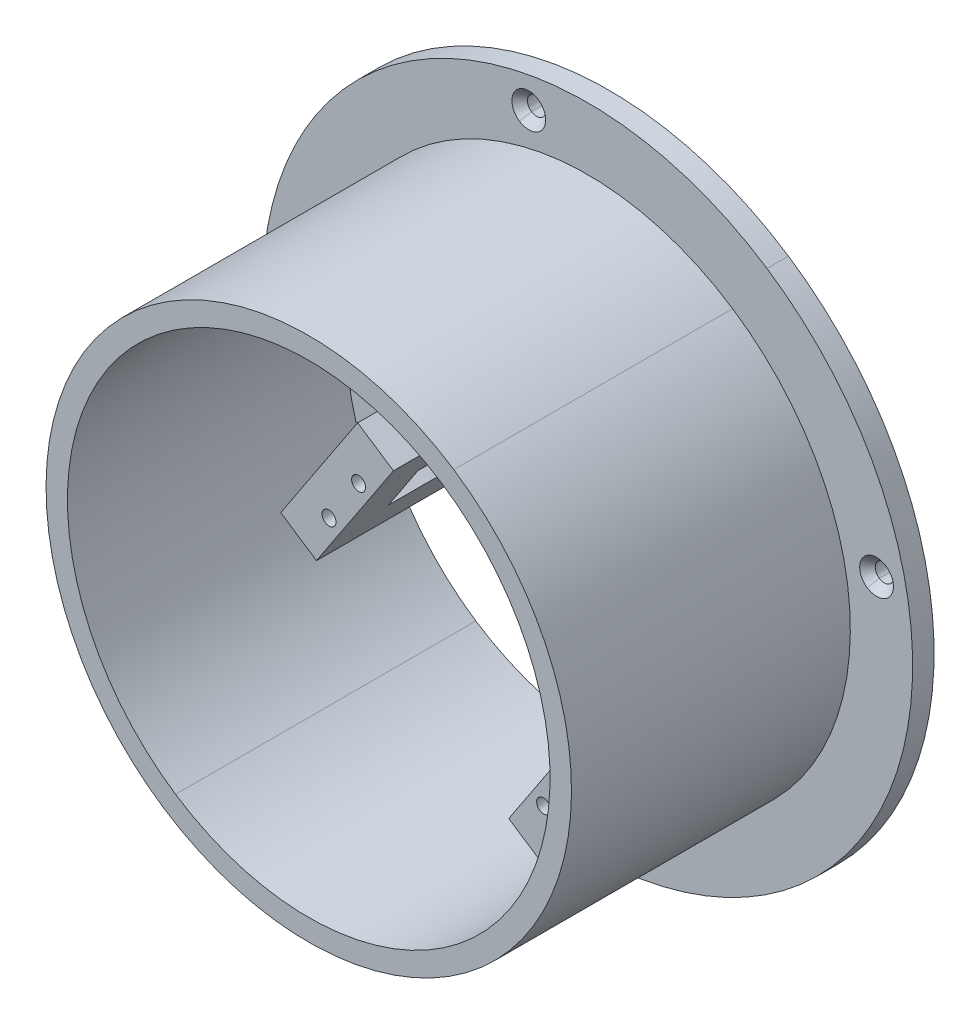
ISO-10303-21;
HEADER;
FILE_DESCRIPTION(('STEP AP214'),'2;1');
FILE_NAME('part.step','',(''),(''),'','','');
FILE_SCHEMA(('AUTOMOTIVE_DESIGN { 1 0 10303 214 1 1 1 1 }'));
ENDSEC;
DATA;
#1=APPLICATION_CONTEXT('core data for automotive mechanical design processes');
#2=APPLICATION_PROTOCOL_DEFINITION('international standard','automotive_design',2000,#1);
#3=PRODUCT_CONTEXT('',#1,'mechanical');
#4=PRODUCT('Part','Part','',(#3));
#5=PRODUCT_RELATED_PRODUCT_CATEGORY('part','',(#4));
#6=PRODUCT_DEFINITION_FORMATION('','',#4);
#7=PRODUCT_DEFINITION_CONTEXT('part definition',#1,'design');
#8=PRODUCT_DEFINITION('design','',#6,#7);
#9=PRODUCT_DEFINITION_SHAPE('','',#8);
#10=(LENGTH_UNIT() NAMED_UNIT(*) SI_UNIT(.MILLI.,.METRE.));
#11=(NAMED_UNIT(*) PLANE_ANGLE_UNIT() SI_UNIT($,.RADIAN.));
#12=(NAMED_UNIT(*) SI_UNIT($,.STERADIAN.) SOLID_ANGLE_UNIT());
#13=UNCERTAINTY_MEASURE_WITH_UNIT(LENGTH_MEASURE(1.E-05),#10,'distance_accuracy_value','');
#14=(GEOMETRIC_REPRESENTATION_CONTEXT(3) GLOBAL_UNCERTAINTY_ASSIGNED_CONTEXT((#13)) GLOBAL_UNIT_ASSIGNED_CONTEXT((#10,
#11,#12)) REPRESENTATION_CONTEXT('',''));
#15=CARTESIAN_POINT('',(0.,0.,0.));
#16=DIRECTION('',(0.,0.,1.));
#17=DIRECTION('',(1.,0.,0.));
#18=AXIS2_PLACEMENT_3D('',#15,#16,#17);
#19=CARTESIAN_POINT('',(51.7444900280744,-146.775424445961,40.1075741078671));
#20=DIRECTION('',(0.,0.,1.));
#21=DIRECTION('',(0.551936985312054,0.833885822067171,0.));
#22=AXIS2_PLACEMENT_3D('',#19,#20,#21);
#23=CONICAL_SURFACE('',#22,3.15,0.785398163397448);
#24=DIRECTION('',(-0.390278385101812,-0.589646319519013,0.70710678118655));
#25=VECTOR('',#24,1.);
#26=CARTESIAN_POINT('',(50.0058885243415,-149.402164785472,40.1075741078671));
#27=LINE('',#26,#25);
#28=CARTESIAN_POINT('',(50.8061971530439,-148.193030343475,38.6575741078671));
#29=VERTEX_POINT('',#28);
#30=CARTESIAN_POINT('',(50.0058885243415,-149.402164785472,40.1075741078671));
#31=VERTEX_POINT('',#30);
#32=EDGE_CURVE('E433',#29,#31,#27,.T.);
#33=ORIENTED_EDGE('',*,*,#32,.F.);
#34=CARTESIAN_POINT('',(51.7444900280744,-146.775424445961,38.6575741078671));
#35=DIRECTION('',(0.,0.,1.));
#36=DIRECTION('',(0.551936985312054,0.833885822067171,0.));
#37=AXIS2_PLACEMENT_3D('',#34,#35,#36);
#38=CIRCLE('',#37,1.7);
#39=CARTESIAN_POINT('',(52.6827829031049,-145.357818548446,38.6575741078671));
#40=VERTEX_POINT('',#39);
#41=EDGE_CURVE('E10',#40,#29,#38,.T.);
#42=ORIENTED_EDGE('',*,*,#41,.F.);
#43=DIRECTION('',(0.390278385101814,0.589646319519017,0.707106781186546));
#44=VECTOR('',#43,1.);
#45=CARTESIAN_POINT('',(53.4830915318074,-144.148684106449,40.1075741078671));
#46=LINE('',#45,#44);
#47=CARTESIAN_POINT('',(53.4830915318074,-144.148684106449,40.1075741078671));
#48=VERTEX_POINT('',#47);
#49=EDGE_CURVE('E430',#40,#48,#46,.T.);
#50=ORIENTED_EDGE('',*,*,#49,.T.);
#51=CARTESIAN_POINT('',(51.7444900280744,-146.775424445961,40.1075741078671));
#52=DIRECTION('',(0.,0.,1.));
#53=DIRECTION('',(0.551936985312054,0.833885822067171,0.));
#54=AXIS2_PLACEMENT_3D('',#51,#52,#53);
#55=CIRCLE('',#54,3.15);
#56=EDGE_CURVE('E509',#48,#31,#55,.T.);
#57=ORIENTED_EDGE('',*,*,#56,.T.);
#58=EDGE_LOOP('',(#33,#42,#50,#57));
#59=FACE_BOUND('',#58,.T.);
#60=ADVANCED_FACE('F17',(#59),#23,.F.);
#61=CARTESIAN_POINT('',(51.7444900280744,-146.775424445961,40.1075741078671));
#62=DIRECTION('',(0.,0.,1.));
#63=DIRECTION('',(0.551936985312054,0.833885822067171,0.));
#64=AXIS2_PLACEMENT_3D('',#61,#62,#63);
#65=CYLINDRICAL_SURFACE('',#64,1.7);
#66=DIRECTION('',(0.,0.,1.));
#67=VECTOR('',#66,1.);
#68=CARTESIAN_POINT('',(50.8061971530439,-148.193030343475,40.1075741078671));
#69=LINE('',#68,#67);
#70=CARTESIAN_POINT('',(50.8061971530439,-148.193030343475,36.1075741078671));
#71=VERTEX_POINT('',#70);
#72=EDGE_CURVE('E448',#71,#29,#69,.T.);
#73=ORIENTED_EDGE('',*,*,#72,.F.);
#74=CARTESIAN_POINT('',(51.7444900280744,-146.775424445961,36.1075741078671));
#75=DIRECTION('',(0.,0.,1.));
#76=DIRECTION('',(0.551936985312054,0.833885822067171,0.));
#77=AXIS2_PLACEMENT_3D('',#74,#75,#76);
#78=CIRCLE('',#77,1.7);
#79=CARTESIAN_POINT('',(52.6827829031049,-145.357818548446,36.1075741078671));
#80=VERTEX_POINT('',#79);
#81=EDGE_CURVE('E441',#80,#71,#78,.T.);
#82=ORIENTED_EDGE('',*,*,#81,.F.);
#83=DIRECTION('',(0.,0.,1.));
#84=VECTOR('',#83,1.);
#85=CARTESIAN_POINT('',(52.6827829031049,-145.357818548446,40.1075741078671));
#86=LINE('',#85,#84);
#87=EDGE_CURVE('E439',#80,#40,#86,.T.);
#88=ORIENTED_EDGE('',*,*,#87,.T.);
#89=ORIENTED_EDGE('',*,*,#41,.T.);
#90=EDGE_LOOP('',(#73,#82,#88,#89));
#91=FACE_BOUND('',#90,.T.);
#92=ADVANCED_FACE('F440',(#91),#65,.F.);
#93=CARTESIAN_POINT('',(94.6751123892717,-81.9143292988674,40.1075741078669));
#94=DIRECTION('',(0.,0.,1.));
#95=DIRECTION('',(0.551936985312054,0.833885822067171,0.));
#96=AXIS2_PLACEMENT_3D('',#93,#94,#95);
#97=CONICAL_SURFACE('',#96,3.15,0.785398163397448);
#98=DIRECTION('',(-0.390278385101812,-0.589646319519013,0.70710678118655));
#99=VECTOR('',#98,1.);
#100=CARTESIAN_POINT('',(92.9365108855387,-84.5410696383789,40.1075741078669));
#101=LINE('',#100,#99);
#102=CARTESIAN_POINT('',(93.7368195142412,-83.3319351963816,38.6575741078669));
#103=VERTEX_POINT('',#102);
#104=CARTESIAN_POINT('',(92.9365108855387,-84.5410696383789,40.1075741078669));
#105=VERTEX_POINT('',#104);
#106=EDGE_CURVE('E505',#103,#105,#101,.T.);
#107=ORIENTED_EDGE('',*,*,#106,.F.);
#108=CARTESIAN_POINT('',(94.6751123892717,-81.9143292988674,38.6575741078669));
#109=DIRECTION('',(0.,0.,1.));
#110=DIRECTION('',(0.551936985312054,0.833885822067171,0.));
#111=AXIS2_PLACEMENT_3D('',#108,#109,#110);
#112=CIRCLE('',#111,1.7);
#113=CARTESIAN_POINT('',(95.6134052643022,-80.4967234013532,38.6575741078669));
#114=VERTEX_POINT('',#113);
#115=EDGE_CURVE('E29',#114,#103,#112,.T.);
#116=ORIENTED_EDGE('',*,*,#115,.F.);
#117=DIRECTION('',(0.390278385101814,0.589646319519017,0.707106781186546));
#118=VECTOR('',#117,1.);
#119=CARTESIAN_POINT('',(96.4137138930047,-79.2875889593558,40.1075741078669));
#120=LINE('',#119,#118);
#121=CARTESIAN_POINT('',(96.4137138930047,-79.2875889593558,40.1075741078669));
#122=VERTEX_POINT('',#121);
#123=EDGE_CURVE('E469',#114,#122,#120,.T.);
#124=ORIENTED_EDGE('',*,*,#123,.T.);
#125=CARTESIAN_POINT('',(94.6751123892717,-81.9143292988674,40.1075741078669));
#126=DIRECTION('',(0.,0.,1.));
#127=DIRECTION('',(0.551936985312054,0.833885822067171,0.));
#128=AXIS2_PLACEMENT_3D('',#125,#126,#127);
#129=CIRCLE('',#128,3.15);
#130=EDGE_CURVE('E626',#122,#105,#129,.T.);
#131=ORIENTED_EDGE('',*,*,#130,.T.);
#132=EDGE_LOOP('',(#107,#116,#124,#131));
#133=FACE_BOUND('',#132,.T.);
#134=ADVANCED_FACE('F1080',(#133),#97,.F.);
#135=CARTESIAN_POINT('',(94.6751123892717,-81.9143292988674,40.1075741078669));
#136=DIRECTION('',(0.,0.,1.));
#137=DIRECTION('',(0.551936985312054,0.833885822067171,0.));
#138=AXIS2_PLACEMENT_3D('',#135,#136,#137);
#139=CYLINDRICAL_SURFACE('',#138,1.7);
#140=DIRECTION('',(0.,0.,1.));
#141=VECTOR('',#140,1.);
#142=CARTESIAN_POINT('',(93.7368195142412,-83.3319351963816,40.1075741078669));
#143=LINE('',#142,#141);
#144=CARTESIAN_POINT('',(93.7368195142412,-83.3319351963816,36.1075741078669));
#145=VERTEX_POINT('',#144);
#146=EDGE_CURVE('E486',#145,#103,#143,.T.);
#147=ORIENTED_EDGE('',*,*,#146,.F.);
#148=CARTESIAN_POINT('',(94.6751123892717,-81.9143292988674,36.1075741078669));
#149=DIRECTION('',(0.,0.,1.));
#150=DIRECTION('',(0.551936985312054,0.833885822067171,0.));
#151=AXIS2_PLACEMENT_3D('',#148,#149,#150);
#152=CIRCLE('',#151,1.7);
#153=CARTESIAN_POINT('',(95.6134052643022,-80.4967234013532,36.1075741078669));
#154=VERTEX_POINT('',#153);
#155=EDGE_CURVE('E848',#154,#145,#152,.T.);
#156=ORIENTED_EDGE('',*,*,#155,.F.);
#157=DIRECTION('',(0.,0.,1.));
#158=VECTOR('',#157,1.);
#159=CARTESIAN_POINT('',(95.6134052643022,-80.4967234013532,40.1075741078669));
#160=LINE('',#159,#158);
#161=EDGE_CURVE('E467',#154,#114,#160,.T.);
#162=ORIENTED_EDGE('',*,*,#161,.T.);
#163=ORIENTED_EDGE('',*,*,#115,.T.);
#164=EDGE_LOOP('',(#147,#156,#162,#163));
#165=FACE_BOUND('',#164,.T.);
#166=ADVANCED_FACE('F1082',(#165),#139,.F.);
#167=CARTESIAN_POINT('',(29.8140172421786,-38.9837069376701,40.1075741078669));
#168=DIRECTION('',(0.,0.,1.));
#169=DIRECTION('',(0.551936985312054,0.833885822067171,0.));
#170=AXIS2_PLACEMENT_3D('',#167,#168,#169);
#171=CONICAL_SURFACE('',#170,3.15,0.785398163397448);
#172=DIRECTION('',(-0.390278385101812,-0.589646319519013,0.70710678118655));
#173=VECTOR('',#172,1.);
#174=CARTESIAN_POINT('',(28.0754157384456,-41.6104472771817,40.1075741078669));
#175=LINE('',#174,#173);
#176=CARTESIAN_POINT('',(28.8757243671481,-40.4013128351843,38.6575741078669));
#177=VERTEX_POINT('',#176);
#178=CARTESIAN_POINT('',(28.0754157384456,-41.6104472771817,40.1075741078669));
#179=VERTEX_POINT('',#178);
#180=EDGE_CURVE('E526',#177,#179,#175,.T.);
#181=ORIENTED_EDGE('',*,*,#180,.F.);
#182=CARTESIAN_POINT('',(29.8140172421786,-38.9837069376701,38.6575741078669));
#183=DIRECTION('',(0.,0.,1.));
#184=DIRECTION('',(0.551936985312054,0.833885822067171,0.));
#185=AXIS2_PLACEMENT_3D('',#182,#183,#184);
#186=CIRCLE('',#185,1.7);
#187=CARTESIAN_POINT('',(30.7523101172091,-37.5661010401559,38.6575741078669));
#188=VERTEX_POINT('',#187);
#189=EDGE_CURVE('E946',#188,#177,#186,.T.);
#190=ORIENTED_EDGE('',*,*,#189,.F.);
#191=DIRECTION('',(0.390278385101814,0.589646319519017,0.707106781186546));
#192=VECTOR('',#191,1.);
#193=CARTESIAN_POINT('',(31.5526187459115,-36.3569665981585,40.1075741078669));
#194=LINE('',#193,#192);
#195=CARTESIAN_POINT('',(31.5526187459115,-36.3569665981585,40.1075741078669));
#196=VERTEX_POINT('',#195);
#197=EDGE_CURVE('E574',#188,#196,#194,.T.);
#198=ORIENTED_EDGE('',*,*,#197,.T.);
#199=CARTESIAN_POINT('',(29.8140172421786,-38.9837069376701,40.1075741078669));
#200=DIRECTION('',(0.,0.,1.));
#201=DIRECTION('',(0.551936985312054,0.833885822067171,0.));
#202=AXIS2_PLACEMENT_3D('',#199,#200,#201);
#203=CIRCLE('',#202,3.15);
#204=EDGE_CURVE('E629',#196,#179,#203,.T.);
#205=ORIENTED_EDGE('',*,*,#204,.T.);
#206=EDGE_LOOP('',(#181,#190,#198,#205));
#207=FACE_BOUND('',#206,.T.);
#208=ADVANCED_FACE('F1128',(#207),#171,.F.);
#209=CARTESIAN_POINT('',(29.8140172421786,-38.9837069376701,40.1075741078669));
#210=DIRECTION('',(0.,0.,1.));
#211=DIRECTION('',(0.551936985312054,0.833885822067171,0.));
#212=AXIS2_PLACEMENT_3D('',#209,#210,#211);
#213=CYLINDRICAL_SURFACE('',#212,1.7);
#214=DIRECTION('',(0.,0.,1.));
#215=VECTOR('',#214,1.);
#216=CARTESIAN_POINT('',(28.8757243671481,-40.4013128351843,40.1075741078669));
#217=LINE('',#216,#215);
#218=CARTESIAN_POINT('',(28.8757243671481,-40.4013128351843,36.1075741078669));
#219=VERTEX_POINT('',#218);
#220=EDGE_CURVE('E585',#219,#177,#217,.T.);
#221=ORIENTED_EDGE('',*,*,#220,.F.);
#222=CARTESIAN_POINT('',(29.8140172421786,-38.9837069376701,36.1075741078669));
#223=DIRECTION('',(0.,0.,1.));
#224=DIRECTION('',(0.551936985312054,0.833885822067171,0.));
#225=AXIS2_PLACEMENT_3D('',#222,#223,#224);
#226=CIRCLE('',#225,1.7);
#227=CARTESIAN_POINT('',(30.7523101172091,-37.5661010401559,36.1075741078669));
#228=VERTEX_POINT('',#227);
#229=EDGE_CURVE('E853',#228,#219,#226,.T.);
#230=ORIENTED_EDGE('',*,*,#229,.F.);
#231=DIRECTION('',(0.,0.,1.));
#232=VECTOR('',#231,1.);
#233=CARTESIAN_POINT('',(30.7523101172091,-37.5661010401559,40.1075741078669));
#234=LINE('',#233,#232);
#235=EDGE_CURVE('E593',#228,#188,#234,.T.);
#236=ORIENTED_EDGE('',*,*,#235,.T.);
#237=ORIENTED_EDGE('',*,*,#189,.T.);
#238=EDGE_LOOP('',(#221,#230,#236,#237));
#239=FACE_BOUND('',#238,.T.);
#240=ADVANCED_FACE('F1132',(#239),#213,.F.);
#241=CARTESIAN_POINT('',(-13.1166051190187,-103.844802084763,40.1075741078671));
#242=DIRECTION('',(0.,0.,1.));
#243=DIRECTION('',(0.551936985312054,0.833885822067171,0.));
#244=AXIS2_PLACEMENT_3D('',#241,#242,#243);
#245=CONICAL_SURFACE('',#244,3.15,0.785398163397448);
#246=DIRECTION('',(-0.390278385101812,-0.589646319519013,0.70710678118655));
#247=VECTOR('',#246,1.);
#248=CARTESIAN_POINT('',(-14.8552066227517,-106.471542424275,40.1075741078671));
#249=LINE('',#248,#247);
#250=CARTESIAN_POINT('',(-14.0548979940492,-105.262407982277,38.6575741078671));
#251=VERTEX_POINT('',#250);
#252=CARTESIAN_POINT('',(-14.8552066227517,-106.471542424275,40.1075741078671));
#253=VERTEX_POINT('',#252);
#254=EDGE_CURVE('E522',#251,#253,#249,.T.);
#255=ORIENTED_EDGE('',*,*,#254,.F.);
#256=CARTESIAN_POINT('',(-13.1166051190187,-103.844802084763,38.6575741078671));
#257=DIRECTION('',(0.,0.,1.));
#258=DIRECTION('',(0.551936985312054,0.833885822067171,0.));
#259=AXIS2_PLACEMENT_3D('',#256,#257,#258);
#260=CIRCLE('',#259,1.7);
#261=CARTESIAN_POINT('',(-12.1783122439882,-102.427196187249,38.6575741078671));
#262=VERTEX_POINT('',#261);
#263=EDGE_CURVE('E943',#262,#251,#260,.T.);
#264=ORIENTED_EDGE('',*,*,#263,.F.);
#265=DIRECTION('',(0.390278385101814,0.589646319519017,0.707106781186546));
#266=VECTOR('',#265,1.);
#267=CARTESIAN_POINT('',(-11.3780036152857,-101.218061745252,40.1075741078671));
#268=LINE('',#267,#266);
#269=CARTESIAN_POINT('',(-11.3780036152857,-101.218061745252,40.1075741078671));
#270=VERTEX_POINT('',#269);
#271=EDGE_CURVE('E521',#262,#270,#268,.T.);
#272=ORIENTED_EDGE('',*,*,#271,.T.);
#273=CARTESIAN_POINT('',(-13.1166051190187,-103.844802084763,40.1075741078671));
#274=DIRECTION('',(0.,0.,1.));
#275=DIRECTION('',(0.551936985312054,0.833885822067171,0.));
#276=AXIS2_PLACEMENT_3D('',#273,#274,#275);
#277=CIRCLE('',#276,3.15);
#278=EDGE_CURVE('E835',#270,#253,#277,.T.);
#279=ORIENTED_EDGE('',*,*,#278,.T.);
#280=EDGE_LOOP('',(#255,#264,#272,#279));
#281=FACE_BOUND('',#280,.T.);
#282=ADVANCED_FACE('F1136',(#281),#245,.F.);
#283=CARTESIAN_POINT('',(-13.1166051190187,-103.844802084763,40.1075741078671));
#284=DIRECTION('',(0.,0.,1.));
#285=DIRECTION('',(0.551936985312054,0.833885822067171,0.));
#286=AXIS2_PLACEMENT_3D('',#283,#284,#285);
#287=CYLINDRICAL_SURFACE('',#286,1.7);
#288=DIRECTION('',(0.,0.,1.));
#289=VECTOR('',#288,1.);
#290=CARTESIAN_POINT('',(-14.0548979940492,-105.262407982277,40.1075741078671));
#291=LINE('',#290,#289);
#292=CARTESIAN_POINT('',(-14.0548979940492,-105.262407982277,36.1075741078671));
#293=VERTEX_POINT('',#292);
#294=EDGE_CURVE('E621',#293,#251,#291,.T.);
#295=ORIENTED_EDGE('',*,*,#294,.F.);
#296=CARTESIAN_POINT('',(-13.1166051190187,-103.844802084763,36.1075741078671));
#297=DIRECTION('',(0.,0.,1.));
#298=DIRECTION('',(0.551936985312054,0.833885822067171,0.));
#299=AXIS2_PLACEMENT_3D('',#296,#297,#298);
#300=CIRCLE('',#299,1.7);
#301=CARTESIAN_POINT('',(-12.1783122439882,-102.427196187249,36.1075741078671));
#302=VERTEX_POINT('',#301);
#303=EDGE_CURVE('E766',#302,#293,#300,.T.);
#304=ORIENTED_EDGE('',*,*,#303,.F.);
#305=DIRECTION('',(0.,0.,1.));
#306=VECTOR('',#305,1.);
#307=CARTESIAN_POINT('',(-12.1783122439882,-102.427196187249,40.1075741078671));
#308=LINE('',#307,#306);
#309=EDGE_CURVE('E616',#302,#262,#308,.T.);
#310=ORIENTED_EDGE('',*,*,#309,.T.);
#311=ORIENTED_EDGE('',*,*,#263,.T.);
#312=EDGE_LOOP('',(#295,#304,#310,#311));
#313=FACE_BOUND('',#312,.T.);
#314=ADVANCED_FACE('F1140',(#313),#287,.F.);
#315=CARTESIAN_POINT('',(40.779253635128,-92.879565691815,36.107574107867));
#316=DIRECTION('',(0.,0.,1.));
#317=DIRECTION('',(0.551936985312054,0.833885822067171,0.));
#318=AXIS2_PLACEMENT_3D('',#315,#316,#317);
#319=CYLINDRICAL_SURFACE('',#318,37.);
#320=CARTESIAN_POINT('',(40.779253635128,-92.879565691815,40.107574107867));
#321=DIRECTION('',(0.,0.,1.));
#322=DIRECTION('',(0.551936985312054,0.833885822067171,0.));
#323=AXIS2_PLACEMENT_3D('',#320,#321,#322);
#324=CIRCLE('',#323,37.);
#325=CARTESIAN_POINT('',(28.5378391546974,-57.9632690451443,40.1075741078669));
#326=VERTEX_POINT('',#325);
#327=CARTESIAN_POINT('',(3.85553141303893,-95.2541682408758,40.1075741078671));
#328=VERTEX_POINT('',#327);
#329=EDGE_CURVE('E866',#326,#328,#324,.T.);
#330=ORIENTED_EDGE('',*,*,#329,.T.);
#331=DIRECTION('',(0.,0.,1.));
#332=VECTOR('',#331,1.);
#333=CARTESIAN_POINT('',(3.85553141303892,-95.2541682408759,36.1075741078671));
#334=LINE('',#333,#332);
#335=CARTESIAN_POINT('',(3.85553141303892,-95.2541682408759,36.1075741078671));
#336=VERTEX_POINT('',#335);
#337=EDGE_CURVE('E43',#336,#328,#334,.T.);
#338=ORIENTED_EDGE('',*,*,#337,.F.);
#339=CARTESIAN_POINT('',(40.779253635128,-92.879565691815,36.107574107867));
#340=DIRECTION('',(0.,0.,1.));
#341=DIRECTION('',(0.551936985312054,0.833885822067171,0.));
#342=AXIS2_PLACEMENT_3D('',#339,#340,#341);
#343=CIRCLE('',#342,37.);
#344=CARTESIAN_POINT('',(28.5378391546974,-57.9632690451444,36.1075741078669));
#345=VERTEX_POINT('',#344);
#346=EDGE_CURVE('E739',#345,#336,#343,.T.);
#347=ORIENTED_EDGE('',*,*,#346,.F.);
#348=DIRECTION('',(0.,0.,1.));
#349=VECTOR('',#348,1.);
#350=CARTESIAN_POINT('',(28.5378391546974,-57.9632690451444,36.1075741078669));
#351=LINE('',#350,#349);
#352=EDGE_CURVE('E411',#345,#326,#351,.T.);
#353=ORIENTED_EDGE('',*,*,#352,.T.);
#354=EDGE_LOOP('',(#330,#338,#347,#353));
#355=FACE_BOUND('',#354,.T.);
#356=ADVANCED_FACE('F972',(#355),#319,.F.);
#357=CARTESIAN_POINT('',(38.3976235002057,-84.9193989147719,36.107574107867));
#358=DIRECTION('',(0.286638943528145,-0.958038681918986,0.));
#359=DIRECTION('',(0.958038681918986,0.286638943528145,0.));
#360=AXIS2_PLACEMENT_3D('',#357,#358,#359);
#361=PLANE('',#360);
#362=DIRECTION('',(0.958038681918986,0.286638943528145,0.));
#363=VECTOR('',#362,1.);
#364=CARTESIAN_POINT('',(38.3976235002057,-84.9193989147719,40.107574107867));
#365=LINE('',#364,#363);
#366=CARTESIAN_POINT('',(11.6754021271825,-92.9145137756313,40.1075741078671));
#367=VERTEX_POINT('',#366);
#368=EDGE_CURVE('E905',#328,#367,#365,.T.);
#369=ORIENTED_EDGE('',*,*,#368,.T.);
#370=DIRECTION('',(0.,0.,1.));
#371=VECTOR('',#370,1.);
#372=CARTESIAN_POINT('',(11.6754021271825,-92.9145137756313,36.1075741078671));
#373=LINE('',#372,#371);
#374=CARTESIAN_POINT('',(11.6754021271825,-92.9145137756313,36.1075741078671));
#375=VERTEX_POINT('',#374);
#376=EDGE_CURVE('E938',#375,#367,#373,.T.);
#377=ORIENTED_EDGE('',*,*,#376,.F.);
#378=DIRECTION('',(0.958038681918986,0.286638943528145,0.));
#379=VECTOR('',#378,1.);
#380=CARTESIAN_POINT('',(38.3976235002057,-84.9193989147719,36.107574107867));
#381=LINE('',#380,#379);
#382=EDGE_CURVE('E678',#336,#375,#381,.T.);
#383=ORIENTED_EDGE('',*,*,#382,.F.);
#384=ORIENTED_EDGE('',*,*,#337,.T.);
#385=EDGE_LOOP('',(#369,#377,#383,#384));
#386=FACE_BOUND('',#385,.T.);
#387=ADVANCED_FACE('F1144',(#386),#361,.F.);
#388=CARTESIAN_POINT('',(20.5575224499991,-79.4950937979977,36.107574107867));
#389=DIRECTION('',(0.833885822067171,-0.551936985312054,0.));
#390=DIRECTION('',(0.,0.,1.));
#391=AXIS2_PLACEMENT_3D('',#388,#389,#390);
#392=PLANE('',#391);
#393=DIRECTION('',(0.551936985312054,0.833885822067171,0.));
#394=VECTOR('',#393,1.);
#395=CARTESIAN_POINT('',(20.5575224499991,-79.4950937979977,40.107574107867));
#396=LINE('',#395,#394);
#397=CARTESIAN_POINT('',(29.4396427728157,-66.0756738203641,40.107574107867));
#398=VERTEX_POINT('',#397);
#399=EDGE_CURVE('E887',#367,#398,#396,.T.);
#400=ORIENTED_EDGE('',*,*,#399,.T.);
#401=DIRECTION('',(0.,0.,1.));
#402=VECTOR('',#401,1.);
#403=CARTESIAN_POINT('',(29.4396427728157,-66.0756738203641,36.107574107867));
#404=LINE('',#403,#402);
#405=CARTESIAN_POINT('',(29.4396427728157,-66.0756738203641,36.107574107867));
#406=VERTEX_POINT('',#405);
#407=EDGE_CURVE('E400',#406,#398,#404,.T.);
#408=ORIENTED_EDGE('',*,*,#407,.F.);
#409=DIRECTION('',(0.551936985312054,0.833885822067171,0.));
#410=VECTOR('',#409,1.);
#411=CARTESIAN_POINT('',(20.5575224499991,-79.4950937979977,36.107574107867));
#412=LINE('',#411,#410);
#413=EDGE_CURVE('E762',#375,#406,#412,.T.);
#414=ORIENTED_EDGE('',*,*,#413,.F.);
#415=ORIENTED_EDGE('',*,*,#376,.T.);
#416=EDGE_LOOP('',(#400,#408,#414,#415));
#417=FACE_BOUND('',#416,.T.);
#418=ADVANCED_FACE('F1030',(#417),#392,.F.);
#419=CARTESIAN_POINT('',(32.5213044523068,-93.7975485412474,36.107574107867));
#420=DIRECTION('',(0.99387801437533,0.110482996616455,0.));
#421=DIRECTION('',(0.,0.,1.));
#422=AXIS2_PLACEMENT_3D('',#419,#420,#421);
#423=PLANE('',#422);
#424=DIRECTION('',(-0.110482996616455,0.99387801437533,0.));
#425=VECTOR('',#424,1.);
#426=CARTESIAN_POINT('',(32.5213044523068,-93.7975485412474,40.107574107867));
#427=LINE('',#426,#425);
#428=EDGE_CURVE('E884',#398,#326,#427,.T.);
#429=ORIENTED_EDGE('',*,*,#428,.T.);
#430=ORIENTED_EDGE('',*,*,#352,.F.);
#431=DIRECTION('',(-0.110482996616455,0.99387801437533,0.));
#432=VECTOR('',#431,1.);
#433=CARTESIAN_POINT('',(32.5213044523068,-93.7975485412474,36.107574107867));
#434=LINE('',#433,#432);
#435=EDGE_CURVE('E743',#406,#345,#434,.T.);
#436=ORIENTED_EDGE('',*,*,#435,.F.);
#437=ORIENTED_EDGE('',*,*,#407,.T.);
#438=EDGE_LOOP('',(#429,#430,#436,#437));
#439=FACE_BOUND('',#438,.T.);
#440=ADVANCED_FACE('F1028',(#439),#423,.F.);
#441=CARTESIAN_POINT('',(91.3344154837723,-126.341297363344,50.107574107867));
#442=DIRECTION('',(-0.833885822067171,0.551936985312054,0.));
#443=DIRECTION('',(-0.551936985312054,-0.833885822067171,0.));
#444=AXIS2_PLACEMENT_3D('',#441,#442,#443);
#445=CYLINDRICAL_SURFACE('',#444,5.);
#446=DIRECTION('',(-0.833885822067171,0.551936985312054,0.));
#447=VECTOR('',#446,1.);
#448=CARTESIAN_POINT('',(94.0941004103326,-122.171868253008,50.107574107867));
#449=LINE('',#448,#447);
#450=CARTESIAN_POINT('',(6.24643088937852,-64.026764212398,50.107574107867));
#451=VERTEX_POINT('',#450);
#452=CARTESIAN_POINT('',(2.89181590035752,-61.8063929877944,50.107574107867));
#453=VERTEX_POINT('',#452);
#454=EDGE_CURVE('E992',#451,#453,#449,.T.);
#455=ORIENTED_EDGE('',*,*,#454,.F.);
#456=CARTESIAN_POINT('',(0.72706103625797,-72.3656224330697,50.107574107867));
#457=CARTESIAN_POINT('',(0.727058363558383,-72.3656289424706,50.1894661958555));
#458=CARTESIAN_POINT('',(0.727975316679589,-72.3638374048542,50.2713593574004));
#459=CARTESIAN_POINT('',(0.731650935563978,-72.356662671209,50.4347616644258));
#460=CARTESIAN_POINT('',(0.734405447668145,-72.3512875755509,50.516271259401));
#461=CARTESIAN_POINT('',(0.741759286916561,-72.3369488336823,50.6789066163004));
#462=CARTESIAN_POINT('',(0.746358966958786,-72.3279845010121,50.7600323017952));
#463=CARTESIAN_POINT('',(0.757404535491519,-72.3064827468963,50.9219002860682));
#464=CARTESIAN_POINT('',(0.763855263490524,-72.2939359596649,51.0026410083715));
#465=CARTESIAN_POINT('',(0.778587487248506,-72.2653238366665,51.1634917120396));
#466=CARTESIAN_POINT('',(0.786872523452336,-72.2492516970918,51.2436001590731));
#467=CARTESIAN_POINT('',(0.805259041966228,-72.2136479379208,51.402661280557));
#468=CARTESIAN_POINT('',(0.815356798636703,-72.194123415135,51.4816159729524));
#469=CARTESIAN_POINT('',(0.83737912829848,-72.1516320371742,51.6383711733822));
#470=CARTESIAN_POINT('',(0.849304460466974,-72.1286637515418,51.7161711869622));
#471=CARTESIAN_POINT('',(0.874994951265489,-72.07930332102,51.8706198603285));
#472=CARTESIAN_POINT('',(0.88876528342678,-72.0529015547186,51.9472645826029));
#473=CARTESIAN_POINT('',(0.917992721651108,-71.9970163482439,52.0985230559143));
#474=CARTESIAN_POINT('',(0.933438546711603,-71.9675535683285,52.1731466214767));
#475=CARTESIAN_POINT('',(0.966057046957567,-71.9055197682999,52.3205219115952));
#476=CARTESIAN_POINT('',(0.983226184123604,-71.8729551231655,52.3932771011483));
#477=CARTESIAN_POINT('',(1.0193096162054,-71.8047385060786,52.5369191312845));
#478=CARTESIAN_POINT('',(1.03822459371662,-71.7690853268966,52.6078052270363));
#479=CARTESIAN_POINT('',(1.07782041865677,-71.6947130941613,52.7477134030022));
#480=CARTESIAN_POINT('',(1.09850605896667,-71.6559857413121,52.8167297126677));
#481=CARTESIAN_POINT('',(1.14165819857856,-71.5755021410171,52.9528754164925));
#482=CARTESIAN_POINT('',(1.16413269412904,-71.5337323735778,53.0199942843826));
#483=CARTESIAN_POINT('',(1.21071536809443,-71.447506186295,53.1516733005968));
#484=CARTESIAN_POINT('',(1.23481989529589,-71.4030557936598,53.216238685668));
#485=CARTESIAN_POINT('',(1.28468583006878,-71.311491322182,53.3428158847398));
#486=CARTESIAN_POINT('',(1.31044764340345,-71.2643765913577,53.4048270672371));
#487=CARTESIAN_POINT('',(1.36365299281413,-71.1675071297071,53.5263020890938));
#488=CARTESIAN_POINT('',(1.39110082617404,-71.1177457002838,53.5857587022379));
#489=CARTESIAN_POINT('',(1.44741198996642,-71.0161352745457,53.7015263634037));
#490=CARTESIAN_POINT('',(1.47626694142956,-70.9642989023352,53.7578525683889));
#491=CARTESIAN_POINT('',(1.53543245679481,-70.8585266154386,53.867408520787));
#492=CARTESIAN_POINT('',(1.56573946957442,-70.8045958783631,53.9206451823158));
#493=CARTESIAN_POINT('',(1.62783187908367,-70.6946573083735,54.0240286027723));
#494=CARTESIAN_POINT('',(1.65961735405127,-70.6386493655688,54.0741751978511));
#495=CARTESIAN_POINT('',(1.72469062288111,-70.5245790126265,54.1713858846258));
#496=CARTESIAN_POINT('',(1.75798189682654,-70.4665119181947,54.2184421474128));
#497=CARTESIAN_POINT('',(1.82603918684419,-70.3484373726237,54.3094073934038));
#498=CARTESIAN_POINT('',(1.86080960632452,-70.2884242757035,54.3533057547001));
#499=CARTESIAN_POINT('',(1.93159055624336,-70.1669259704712,54.437539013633));
#500=CARTESIAN_POINT('',(1.96759776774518,-70.1054448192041,54.4778825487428));
#501=CARTESIAN_POINT('',(2.0408710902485,-69.9810301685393,54.5550140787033));
#502=CARTESIAN_POINT('',(2.07813707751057,-69.918096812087,54.5918024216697));
#503=CARTESIAN_POINT('',(2.1539474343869,-69.7907974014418,54.6618322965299));
#504=CARTESIAN_POINT('',(2.19249456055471,-69.7264283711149,54.6950654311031));
#505=CARTESIAN_POINT('',(2.27071831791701,-69.5965577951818,54.7578558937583));
#506=CARTESIAN_POINT('',(2.31039533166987,-69.5310558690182,54.7874119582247));
#507=CARTESIAN_POINT('',(2.39069611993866,-69.3992635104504,54.8426506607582));
#508=CARTESIAN_POINT('',(2.43131723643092,-69.3329755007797,54.8683429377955));
#509=CARTESIAN_POINT('',(2.51351747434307,-69.199625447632,54.9158630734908));
#510=CARTESIAN_POINT('',(2.55509647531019,-69.1325635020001,54.9376914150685));
#511=CARTESIAN_POINT('',(2.63922423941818,-68.9976794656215,54.9774933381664));
#512=CARTESIAN_POINT('',(2.68177500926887,-68.9298559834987,54.9954579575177));
#513=CARTESIAN_POINT('',(2.76752894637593,-68.7939845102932,55.0274171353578));
#514=CARTESIAN_POINT('',(2.81072976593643,-68.7259378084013,55.0414234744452));
#515=CARTESIAN_POINT('',(2.89771185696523,-68.5897467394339,55.0654306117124));
#516=CARTESIAN_POINT('',(2.94149146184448,-68.5216030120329,55.0754410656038));
#517=CARTESIAN_POINT('',(3.02963297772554,-68.3852248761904,55.0914661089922));
#518=CARTESIAN_POINT('',(3.07399487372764,-68.3169904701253,55.097480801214));
#519=CARTESIAN_POINT('',(3.16330328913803,-68.1804371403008,55.1055242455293));
#520=CARTESIAN_POINT('',(3.2082509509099,-68.112118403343,55.1075434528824));
#521=CARTESIAN_POINT('',(3.29873917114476,-67.9753935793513,55.1076042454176));
#522=CARTESIAN_POINT('',(3.34428155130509,-67.9069886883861,55.1056264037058));
#523=CARTESIAN_POINT('',(3.43552473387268,-67.7707501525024,55.0976242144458));
#524=CARTESIAN_POINT('',(3.4812249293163,-67.7029155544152,55.0916092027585));
#525=CARTESIAN_POINT('',(3.57277594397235,-67.5678159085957,55.0755427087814));
#526=CARTESIAN_POINT('',(3.61862678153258,-67.5005509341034,55.0654907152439));
#527=CARTESIAN_POINT('',(3.71047196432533,-67.3665878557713,55.0413605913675));
#528=CARTESIAN_POINT('',(3.75646637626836,-67.2998916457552,55.0272722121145));
#529=CARTESIAN_POINT('',(3.8480797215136,-67.1678015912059,54.9952564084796));
#530=CARTESIAN_POINT('',(3.89369921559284,-67.1024022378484,54.9773533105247));
#531=CARTESIAN_POINT('',(3.98462362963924,-66.9727817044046,54.9377018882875));
#532=CARTESIAN_POINT('',(4.02992901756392,-66.9085582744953,54.9159619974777));
#533=CARTESIAN_POINT('',(4.12020925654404,-66.7812792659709,54.8686468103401));
#534=CARTESIAN_POINT('',(4.16518403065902,-66.7182239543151,54.8430706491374));
#535=CARTESIAN_POINT('',(4.25478803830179,-66.5932700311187,54.7880925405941));
#536=CARTESIAN_POINT('',(4.29941605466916,-66.5313748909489,54.7586807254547));
#537=CARTESIAN_POINT('',(4.38829274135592,-66.4087567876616,54.696052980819));
#538=CARTESIAN_POINT('',(4.43253877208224,-66.3480404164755,54.6628203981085));
#539=CARTESIAN_POINT('',(4.52021130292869,-66.2283491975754,54.5927778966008));
#540=CARTESIAN_POINT('',(4.56363940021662,-66.1693707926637,54.555976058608));
#541=CARTESIAN_POINT('',(4.64965401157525,-66.0531373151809,54.4788043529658));
#542=CARTESIAN_POINT('',(4.69224035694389,-65.9958825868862,54.4384337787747));
#543=CARTESIAN_POINT('',(4.77655087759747,-65.8830776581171,54.3541337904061));
#544=CARTESIAN_POINT('',(4.81827250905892,-65.8275323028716,54.310195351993));
#545=CARTESIAN_POINT('',(4.90050223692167,-65.7185671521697,54.2191337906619));
#546=CARTESIAN_POINT('',(4.94101366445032,-65.6651413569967,54.1720208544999));
#547=CARTESIAN_POINT('',(5.02072604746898,-65.5604877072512,54.0746806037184));
#548=CARTESIAN_POINT('',(5.05992985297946,-65.5092549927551,54.0244608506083));
#549=CARTESIAN_POINT('',(5.13700270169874,-65.408964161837,53.9209154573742));
#550=CARTESIAN_POINT('',(5.17487168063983,-65.3599061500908,53.8675896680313));
#551=CARTESIAN_POINT('',(5.24925250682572,-65.2639412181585,53.757840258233));
#552=CARTESIAN_POINT('',(5.28576080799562,-65.2170398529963,53.7014093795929));
#553=CARTESIAN_POINT('',(5.35722340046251,-65.1255904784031,53.5857398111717));
#554=CARTESIAN_POINT('',(5.39217786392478,-65.0810422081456,53.5265014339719));
#555=CARTESIAN_POINT('',(5.46032081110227,-64.99451575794,53.4054733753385));
#556=CARTESIAN_POINT('',(5.49351355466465,-64.9525313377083,53.3436905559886));
#557=CARTESIAN_POINT('',(5.55811018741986,-64.8711070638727,53.2175809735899));
#558=CARTESIAN_POINT('',(5.58951433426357,-64.8316668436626,53.1532545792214));
#559=CARTESIAN_POINT('',(5.65051325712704,-64.7553058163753,53.0220647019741));
#560=CARTESIAN_POINT('',(5.68010378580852,-64.7183909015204,52.9551958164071));
#561=CARTESIAN_POINT('',(5.73742428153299,-64.6470968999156,52.8190010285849));
#562=CARTESIAN_POINT('',(5.7651473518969,-64.6127271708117,52.7496673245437));
#563=CARTESIAN_POINT('',(5.81843183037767,-64.5468508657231,52.6090937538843));
#564=CARTESIAN_POINT('',(5.84399880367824,-64.5153369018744,52.5378594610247));
#565=CARTESIAN_POINT('',(5.89295307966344,-64.4551476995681,52.3934907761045));
#566=CARTESIAN_POINT('',(5.91634090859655,-64.4264717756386,52.3203568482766));
#567=CARTESIAN_POINT('',(5.9609219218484,-64.371934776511,52.172194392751));
#568=CARTESIAN_POINT('',(5.98211018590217,-64.3460800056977,52.0971620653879));
#569=CARTESIAN_POINT('',(6.02209066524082,-64.2973927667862,51.9459105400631));
#570=CARTESIAN_POINT('',(6.04089370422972,-64.2745466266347,51.8696986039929));
#571=CARTESIAN_POINT('',(6.07608344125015,-64.2318652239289,51.7161077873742));
#572=CARTESIAN_POINT('',(6.09247624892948,-64.2120223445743,51.6387324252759));
#573=CARTESIAN_POINT('',(6.12283597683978,-64.1753276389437,51.4828193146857));
#574=CARTESIAN_POINT('',(6.13680329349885,-64.1584753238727,51.404281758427));
#575=CARTESIAN_POINT('',(6.16230533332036,-64.1277433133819,51.2460478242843));
#576=CARTESIAN_POINT('',(6.17383448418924,-64.1138704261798,51.1663492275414));
#577=CARTESIAN_POINT('',(6.19446979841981,-64.0890639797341,51.0056664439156));
#578=CARTESIAN_POINT('',(6.2035603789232,-64.0781493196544,50.9246773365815));
#579=CARTESIAN_POINT('',(6.21914237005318,-64.0594536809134,50.7622962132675));
#580=CARTESIAN_POINT('',(6.22564023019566,-64.0516649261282,50.6809057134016));
#581=CARTESIAN_POINT('',(6.23603558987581,-64.0392093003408,50.5177246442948));
#582=CARTESIAN_POINT('',(6.23993320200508,-64.0345422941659,50.4359340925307));
#583=CARTESIAN_POINT('',(6.24513654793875,-64.0283133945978,50.2719536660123));
#584=CARTESIAN_POINT('',(6.24643597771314,-64.026759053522,50.1897633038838));
#585=CARTESIAN_POINT('',(6.24643088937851,-64.026764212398,50.107574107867));
#586=B_SPLINE_CURVE_WITH_KNOTS('',3,(#456,#457,#458,#459,#460,#461,#462,#463,#464,#465,#466,
#467,#468,#469,#470,#471,#472,#473,#474,#475,#476,#477,#478,#479,#480,#481,#482,#483,#484,#485,
#486,#487,#488,#489,#490,#491,#492,#493,#494,#495,#496,#497,#498,#499,#500,#501,#502,#503,#504,
#505,#506,#507,#508,#509,#510,#511,#512,#513,#514,#515,#516,#517,#518,#519,#520,#521,#522,#523,
#524,#525,#526,#527,#528,#529,#530,#531,#532,#533,#534,#535,#536,#537,#538,#539,#540,#541,#542,
#543,#544,#545,#546,#547,#548,#549,#550,#551,#552,#553,#554,#555,#556,#557,#558,#559,#560,#561,
#562,#563,#564,#565,#566,#567,#568,#569,#570,#571,#572,#573,#574,#575,#576,#577,#578,#579,#580,
#581,#582,#583,#584,#585),.UNSPECIFIED.,.F.,.F.,(4,2,2,2,2,2,2,2,2,2,2,2,2,2,2,2,2,2,2,2,2,2,2,
2,2,2,2,2,2,2,2,2,2,2,2,2,2,2,2,2,2,2,2,2,2,2,2,2,2,2,2,2,2,2,2,2,2,2,2,2,2,2,2,2,4),(0.,
0.245652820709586,0.490752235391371,0.735898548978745,0.981691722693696,1.22796350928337,
1.47373481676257,1.71960849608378,1.96618664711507,2.21119707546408,2.45571439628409,
2.70032772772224,2.94562549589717,3.19208903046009,3.43801769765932,3.6840068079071,
3.93065123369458,4.17597316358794,4.42072304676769,4.66548589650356,4.91084663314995,
5.15699741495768,5.40253258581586,5.64804369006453,5.89412244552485,6.14028553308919,
6.38582395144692,6.63133166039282,6.87740284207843,7.12273376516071,7.36746822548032,
7.61219639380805,7.85750848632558,8.104015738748,8.3499549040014,8.59592522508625,
8.84252571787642,9.08759834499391,9.33213885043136,9.5767345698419,9.82197244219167,
10.0683229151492,10.3141281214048,10.5599821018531,10.8064785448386,11.0522185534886,
11.2973823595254,11.5425579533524,11.7883332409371,12.0340812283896,12.2792050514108,
12.5242934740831,12.7699355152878,13.0164399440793,13.2622872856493,13.5080751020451,
13.754401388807,13.9995665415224,14.2440990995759,14.4885916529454,14.7336370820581,
14.9802129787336,15.2261716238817,15.4721196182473,15.7186636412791),.UNSPECIFIED.);
#587=CARTESIAN_POINT('',(0.727061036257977,-72.3656224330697,50.107574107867));
#588=VERTEX_POINT('',#587);
#589=EDGE_CURVE('E789',#588,#451,#586,.T.);
#590=ORIENTED_EDGE('',*,*,#589,.F.);
#591=DIRECTION('',(-0.833885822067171,0.551936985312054,0.));
#592=VECTOR('',#591,1.);
#593=CARTESIAN_POINT('',(88.5747305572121,-130.510726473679,50.107574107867));
#594=LINE('',#593,#592);
#595=CARTESIAN_POINT('',(-2.62755395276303,-70.1452512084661,50.107574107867));
#596=VERTEX_POINT('',#595);
#597=EDGE_CURVE('E612',#588,#596,#594,.T.);
#598=ORIENTED_EDGE('',*,*,#597,.T.);
#599=CARTESIAN_POINT('',(-2.62755395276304,-70.145251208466,50.107574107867));
#600=CARTESIAN_POINT('',(-2.62755415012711,-70.1452514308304,50.1594058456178));
#601=CARTESIAN_POINT('',(-2.62718244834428,-70.1445306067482,50.2112375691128));
#602=CARTESIAN_POINT('',(-2.62568509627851,-70.1416373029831,50.3153542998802));
#603=CARTESIAN_POINT('',(-2.62455214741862,-70.1394507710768,50.3676388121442));
#604=CARTESIAN_POINT('',(-2.62150735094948,-70.1335883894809,50.4726078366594));
#605=CARTESIAN_POINT('',(-2.61958809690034,-70.1298983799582,50.5252913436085));
#606=CARTESIAN_POINT('',(-2.61494678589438,-70.1209928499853,50.6310021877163));
#607=CARTESIAN_POINT('',(-2.61221722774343,-70.1157630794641,50.6840279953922));
#608=CARTESIAN_POINT('',(-2.60593216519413,-70.1037430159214,50.790364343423));
#609=CARTESIAN_POINT('',(-2.60236907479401,-70.0969383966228,50.8436728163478));
#610=CARTESIAN_POINT('',(-2.59439475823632,-70.0817350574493,50.9505124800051));
#611=CARTESIAN_POINT('',(-2.58997587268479,-70.0733219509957,51.0040410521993));
#612=CARTESIAN_POINT('',(-2.58026879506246,-70.054869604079,51.1112559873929));
#613=CARTESIAN_POINT('',(-2.57497288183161,-70.0448159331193,51.164939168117));
#614=CARTESIAN_POINT('',(-2.563491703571,-70.0230521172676,51.272395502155));
#615=CARTESIAN_POINT('',(-2.55729866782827,-70.011327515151,51.3261648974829));
#616=CARTESIAN_POINT('',(-2.54400440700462,-69.9861933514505,51.4337229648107));
#617=CARTESIAN_POINT('',(-2.53689537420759,-69.9727693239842,51.4875072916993));
#618=CARTESIAN_POINT('',(-2.52175164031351,-69.9442097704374,51.5950217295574));
#619=CARTESIAN_POINT('',(-2.51370910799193,-69.9290597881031,51.6487468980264));
#620=CARTESIAN_POINT('',(-2.49668216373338,-69.8970241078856,51.7560666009));
#621=CARTESIAN_POINT('',(-2.48768990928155,-69.8801239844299,51.8096555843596));
#622=CARTESIAN_POINT('',(-2.46874940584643,-69.8445654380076,51.916624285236));
#623=CARTESIAN_POINT('',(-2.45879332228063,-69.8258926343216,51.9699978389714));
#624=CARTESIAN_POINT('',(-2.43935784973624,-69.7894825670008,52.0690742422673));
#625=CARTESIAN_POINT('',(-2.42998549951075,-69.7719406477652,52.1148700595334));
#626=CARTESIAN_POINT('',(-2.41022573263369,-69.7350144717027,52.2074809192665));
#627=CARTESIAN_POINT('',(-2.39981393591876,-69.7155866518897,52.2542734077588));
#628=CARTESIAN_POINT('',(-2.37790512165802,-69.6747810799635,52.34876387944));
#629=CARTESIAN_POINT('',(-2.36638298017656,-69.6533590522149,52.3964369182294));
#630=CARTESIAN_POINT('',(-2.34218276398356,-69.6084585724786,52.4925640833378));
#631=CARTESIAN_POINT('',(-2.329478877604,-69.5849352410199,52.5409907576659));
#632=CARTESIAN_POINT('',(-2.30284687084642,-69.5357265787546,52.6384884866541));
#633=CARTESIAN_POINT('',(-2.28889239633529,-69.5099958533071,52.6875294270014));
#634=CARTESIAN_POINT('',(-2.25968743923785,-69.4562711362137,52.7861082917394));
#635=CARTESIAN_POINT('',(-2.24441000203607,-69.4282314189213,52.8356133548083));
#636=CARTESIAN_POINT('',(-2.21818191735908,-69.3801771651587,52.9172880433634));
#637=CARTESIAN_POINT('',(-2.20747063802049,-69.3605742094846,52.9497779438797));
#638=CARTESIAN_POINT('',(-2.18396552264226,-69.3176214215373,53.0192222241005));
#639=CARTESIAN_POINT('',(-2.17110645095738,-69.294162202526,53.0560870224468));
#640=CARTESIAN_POINT('',(-2.14310081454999,-69.2431893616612,53.1339765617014));
#641=CARTESIAN_POINT('',(-2.12787900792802,-69.2155544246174,53.1748948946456));
#642=CARTESIAN_POINT('',(-2.09492601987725,-69.1558907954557,53.2605246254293));
#643=CARTESIAN_POINT('',(-2.07711113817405,-69.123729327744,53.3051113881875));
#644=CARTESIAN_POINT('',(-2.03873196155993,-69.0546518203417,53.397641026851));
#645=CARTESIAN_POINT('',(-2.01807627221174,-69.0175929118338,53.4454394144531));
#646=CARTESIAN_POINT('',(-1.97377165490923,-68.9383393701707,53.5438783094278));
#647=CARTESIAN_POINT('',(-1.95002548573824,-68.8959927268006,53.5943528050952));
#648=CARTESIAN_POINT('',(-1.90167768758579,-68.8100849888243,53.6926370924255));
#649=CARTESIAN_POINT('',(-1.87708962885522,-68.7665443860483,53.7404714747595));
#650=CARTESIAN_POINT('',(-1.82895491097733,-68.6816403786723,53.8300484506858));
#651=CARTESIAN_POINT('',(-1.80549789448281,-68.6404073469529,53.8719629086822));
#652=CARTESIAN_POINT('',(-1.75992517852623,-68.5605584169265,53.9501505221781));
#653=CARTESIAN_POINT('',(-1.7378879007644,-68.5220562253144,53.9865855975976));
#654=CARTESIAN_POINT('',(-1.69540471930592,-68.4480515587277,54.0542515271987));
#655=CARTESIAN_POINT('',(-1.67502767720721,-68.4126468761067,54.08563267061));
#656=CARTESIAN_POINT('',(-1.63607992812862,-68.3451606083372,54.1436055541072));
#657=CARTESIAN_POINT('',(-1.61756925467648,-68.3131622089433,54.1703345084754));
#658=CARTESIAN_POINT('',(-1.58253112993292,-68.2527637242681,54.2193875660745));
#659=CARTESIAN_POINT('',(-1.5660563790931,-68.2244327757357,54.2418346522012));
#660=CARTESIAN_POINT('',(-1.52466885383,-68.1534478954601,54.2966937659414));
#661=CARTESIAN_POINT('',(-1.49955648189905,-68.1105421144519,54.3286311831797));
#662=CARTESIAN_POINT('',(-1.44941299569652,-68.0251694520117,54.3897941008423));
#663=CARTESIAN_POINT('',(-1.42440225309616,-67.9827283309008,54.4190723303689));
#664=CARTESIAN_POINT('',(-1.37454291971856,-67.8984150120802,54.4750409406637));
#665=CARTESIAN_POINT('',(-1.34971344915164,-67.8565661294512,54.5017834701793));
#666=CARTESIAN_POINT('',(-1.30029594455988,-67.7735554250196,54.5528067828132));
#667=CARTESIAN_POINT('',(-1.27572571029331,-67.7324146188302,54.5771390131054));
#668=CARTESIAN_POINT('',(-1.22689774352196,-67.6509286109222,54.6234703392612));
#669=CARTESIAN_POINT('',(-1.20265663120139,-67.6106022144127,54.6455200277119));
#670=CARTESIAN_POINT('',(-1.15455287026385,-67.5308439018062,54.6874158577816));
#671=CARTESIAN_POINT('',(-1.13070571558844,-67.4914286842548,54.7073116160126));
#672=CARTESIAN_POINT('',(-1.07918747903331,-67.4065671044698,54.7484293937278));
#673=CARTESIAN_POINT('',(-1.05145296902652,-67.3610568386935,54.7694404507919));
#674=CARTESIAN_POINT('',(-0.995712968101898,-67.2699435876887,54.809447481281));
#675=CARTESIAN_POINT('',(-0.967711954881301,-67.2243448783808,54.828459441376));
#676=CARTESIAN_POINT('',(-0.911483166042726,-67.1331203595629,54.8644939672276));
#677=CARTESIAN_POINT('',(-0.883259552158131,-67.0874983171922,54.8815325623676));
#678=CARTESIAN_POINT('',(-0.826627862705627,-66.9962914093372,54.9136485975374));
#679=CARTESIAN_POINT('',(-0.798223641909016,-66.9507098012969,54.9287420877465));
#680=CARTESIAN_POINT('',(-0.741271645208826,-66.8596455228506,54.9569988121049));
#681=CARTESIAN_POINT('',(-0.712727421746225,-66.814165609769,54.9701780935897));
#682=CARTESIAN_POINT('',(-0.655534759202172,-66.7233642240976,54.9946397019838));
#683=CARTESIAN_POINT('',(-0.626889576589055,-66.6780450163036,55.005938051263));
#684=CARTESIAN_POINT('',(-0.569532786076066,-66.58762217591,55.0266733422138));
#685=CARTESIAN_POINT('',(-0.540824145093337,-66.5425203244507,55.0361262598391));
#686=CARTESIAN_POINT('',(-0.483376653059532,-66.4525869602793,55.0532083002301));
#687=CARTESIAN_POINT('',(-0.454640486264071,-66.4077567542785,55.0608533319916));
#688=CARTESIAN_POINT('',(-0.39717257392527,-66.3184190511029,55.0743591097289));
#689=CARTESIAN_POINT('',(-0.368443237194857,-66.2739123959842,55.0802356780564));
#690=CARTESIAN_POINT('',(-0.311022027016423,-66.1852717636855,55.0902457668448));
#691=CARTESIAN_POINT('',(-0.28233229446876,-66.1411381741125,55.0943950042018));
#692=CARTESIAN_POINT('',(-0.225021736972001,-66.0532912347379,55.1009932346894));
#693=CARTESIAN_POINT('',(-0.196402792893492,-66.0095778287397,55.1034578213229));
#694=CARTESIAN_POINT('',(-0.139263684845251,-65.9226164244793,55.106730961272));
#695=CARTESIAN_POINT('',(-0.1107451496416,-65.8793679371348,55.107554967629));
#696=CARTESIAN_POINT('',(-0.0535452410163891,-65.7929411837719,55.1075926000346));
#697=CARTESIAN_POINT('',(-0.024863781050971,-65.7497629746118,55.1068052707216));
#698=CARTESIAN_POINT('',(0.032887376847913,-65.6631306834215,55.1036038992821));
#699=CARTESIAN_POINT('',(0.0619581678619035,-65.6196779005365,55.1011744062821));
#700=CARTESIAN_POINT('',(0.120458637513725,-65.5325408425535,55.094644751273));
#701=CARTESIAN_POINT('',(0.14988910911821,-65.4888582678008,55.0905289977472));
#702=CARTESIAN_POINT('',(0.209078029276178,-65.4013083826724,55.0805842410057));
#703=CARTESIAN_POINT('',(0.238836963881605,-65.3574431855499,55.0747395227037));
#704=CARTESIAN_POINT('',(0.298650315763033,-65.2695771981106,55.0612957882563));
#705=CARTESIAN_POINT('',(0.328704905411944,-65.2255789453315,55.0536809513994));
#706=CARTESIAN_POINT('',(0.389075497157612,-65.137498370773,55.0366576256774));
#707=CARTESIAN_POINT('',(0.419391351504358,-65.0934190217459,55.0272332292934));
#708=CARTESIAN_POINT('',(0.480248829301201,-65.0052301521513,55.0065532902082));
#709=CARTESIAN_POINT('',(0.510789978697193,-64.9611240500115,54.9952817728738));
#710=CARTESIAN_POINT('',(0.572060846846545,-64.8729379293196,54.9708721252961));
#711=CARTESIAN_POINT('',(0.602789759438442,-64.8288617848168,54.9577179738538));
#712=CARTESIAN_POINT('',(0.664397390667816,-64.7407941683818,54.9295097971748));
#713=CARTESIAN_POINT('',(0.69527496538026,-64.6968070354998,54.9144397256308));
#714=CARTESIAN_POINT('',(0.757139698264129,-64.6089783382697,54.8823688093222));
#715=CARTESIAN_POINT('',(0.788125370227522,-64.5651415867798,54.8653519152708));
#716=CARTESIAN_POINT('',(0.85016432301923,-64.4776768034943,54.8293590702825));
#717=CARTESIAN_POINT('',(0.881215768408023,-64.4340540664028,54.8103670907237));
#718=CARTESIAN_POINT('',(0.943343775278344,-64.3470827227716,54.7703983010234));
#719=CARTESIAN_POINT('',(0.974418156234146,-64.303739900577,54.7494055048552));
#720=CARTESIAN_POINT('',(1.03245653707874,-64.2230773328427,54.7083078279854));
#721=CARTESIAN_POINT('',(1.05945438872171,-64.1856745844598,54.6884132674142));
#722=CARTESIAN_POINT('',(1.1141469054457,-64.1101265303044,54.6465152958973));
#723=CARTESIAN_POINT('',(1.14183223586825,-64.0720020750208,54.6244620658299));
#724=CARTESIAN_POINT('',(1.19783725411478,-63.9951065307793,54.5781185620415));
#725=CARTESIAN_POINT('',(1.22614609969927,-63.9563581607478,54.5537774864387));
#726=CARTESIAN_POINT('',(1.28332892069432,-63.8783190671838,54.5027308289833));
#727=CARTESIAN_POINT('',(1.31219047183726,-63.8390530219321,54.4759735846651));
#728=CARTESIAN_POINT('',(1.37040387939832,-63.7600938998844,54.419969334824));
#729=CARTESIAN_POINT('',(1.39974170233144,-63.7204276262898,54.3906699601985));
#730=CARTESIAN_POINT('',(1.45882276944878,-63.640789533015,54.3294579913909));
#731=CARTESIAN_POINT('',(1.48855020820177,-63.6008466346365,54.2974924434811));
#732=CARTESIAN_POINT('',(1.53779386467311,-63.5349120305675,54.2425827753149));
#733=CARTESIAN_POINT('',(1.55746423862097,-63.5086374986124,54.2201146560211));
#734=CARTESIAN_POINT('',(1.59943551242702,-63.4526966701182,54.1710101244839));
#735=CARTESIAN_POINT('',(1.62169322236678,-63.4231061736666,54.1442502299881));
#736=CARTESIAN_POINT('',(1.66867446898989,-63.3607801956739,54.0862046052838));
#737=CARTESIAN_POINT('',(1.69334469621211,-63.3281328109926,54.0547810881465));
#738=CARTESIAN_POINT('',(1.74495653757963,-63.2599907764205,53.9870179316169));
#739=CARTESIAN_POINT('',(1.77183479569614,-63.2245981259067,53.9505273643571));
#740=CARTESIAN_POINT('',(1.827629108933,-63.1513166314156,53.8722145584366));
#741=CARTESIAN_POINT('',(1.85647083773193,-63.1135448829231,53.8302297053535));
#742=CARTESIAN_POINT('',(1.9159250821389,-63.0359212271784,53.7404959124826));
#743=CARTESIAN_POINT('',(1.9464522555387,-62.9962033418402,53.6925743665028));
#744=CARTESIAN_POINT('',(2.00658387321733,-62.9182051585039,53.5943732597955));
#745=CARTESIAN_POINT('',(2.03618085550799,-62.8799361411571,53.5440801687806));
#746=CARTESIAN_POINT('',(2.09163212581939,-62.8084319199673,53.4459989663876));
#747=CARTESIAN_POINT('',(2.1175875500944,-62.7750489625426,53.3983756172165));
#748=CARTESIAN_POINT('',(2.16602155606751,-62.7129285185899,53.3061865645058));
#749=CARTESIAN_POINT('',(2.18859518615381,-62.6840521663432,53.2617642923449));
#750=CARTESIAN_POINT('',(2.23051461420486,-62.6305638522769,53.1764504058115));
#751=CARTESIAN_POINT('',(2.24994922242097,-62.6058239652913,53.1356825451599));
#752=CARTESIAN_POINT('',(2.28582892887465,-62.560249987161,53.0580778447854));
#753=CARTESIAN_POINT('',(2.30235564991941,-62.5393001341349,53.0213466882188));
#754=CARTESIAN_POINT('',(2.33263507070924,-62.5009722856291,52.952151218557));
#755=CARTESIAN_POINT('',(2.34646237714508,-62.483492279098,52.9197758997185));
#756=CARTESIAN_POINT('',(2.38054612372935,-62.440446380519,52.8379734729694));
#757=CARTESIAN_POINT('',(2.40051038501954,-62.4152709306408,52.7882178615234));
#758=CARTESIAN_POINT('',(2.43878214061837,-62.3671048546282,52.6891383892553));
#759=CARTESIAN_POINT('',(2.45712163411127,-62.3440709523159,52.6398478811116));
#760=CARTESIAN_POINT('',(2.49221010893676,-62.3000795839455,52.5418538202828));
#761=CARTESIAN_POINT('',(2.50899101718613,-62.2790795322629,52.4931808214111));
#762=CARTESIAN_POINT('',(2.54103428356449,-62.2390489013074,52.3965659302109));
#763=CARTESIAN_POINT('',(2.55632830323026,-62.2199764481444,52.3486518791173));
#764=CARTESIAN_POINT('',(2.58546974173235,-62.1836910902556,52.2536861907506));
#765=CARTESIAN_POINT('',(2.59934853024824,-62.1664371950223,52.2066598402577));
#766=CARTESIAN_POINT('',(2.62573286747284,-62.1336789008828,52.1135897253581));
#767=CARTESIAN_POINT('',(2.63826941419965,-62.118134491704,52.0675688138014));
#768=CARTESIAN_POINT('',(2.66421071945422,-62.0859942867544,51.9683142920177));
#769=CARTESIAN_POINT('',(2.67748279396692,-62.069566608,51.9149913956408));
#770=CARTESIAN_POINT('',(2.70276441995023,-62.0383002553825,51.8081244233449));
#771=CARTESIAN_POINT('',(2.71478410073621,-62.0234488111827,51.7545864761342));
#772=CARTESIAN_POINT('',(2.73757605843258,-61.9953132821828,51.6473689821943));
#773=CARTESIAN_POINT('',(2.74835850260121,-61.9820164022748,51.5936949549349));
#774=CARTESIAN_POINT('',(2.76869179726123,-61.9569657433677,51.4862826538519));
#775=CARTESIAN_POINT('',(2.77825284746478,-61.9451991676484,51.4325492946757));
#776=CARTESIAN_POINT('',(2.79616082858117,-61.9231827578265,51.325092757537));
#777=CARTESIAN_POINT('',(2.8045179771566,-61.9129201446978,51.2713739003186));
#778=CARTESIAN_POINT('',(2.82003690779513,-61.8938832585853,51.1640179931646));
#779=CARTESIAN_POINT('',(2.82720891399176,-61.8850962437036,51.110384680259));
#780=CARTESIAN_POINT('',(2.84037756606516,-61.868980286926,51.0032686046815));
#781=CARTESIAN_POINT('',(2.84638443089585,-61.86163865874,50.9497890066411));
#782=CARTESIAN_POINT('',(2.85724394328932,-61.8483814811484,50.8430462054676));
#783=CARTESIAN_POINT('',(2.86210679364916,-61.8424533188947,50.7897856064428));
#784=CARTESIAN_POINT('',(2.87070046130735,-61.8319895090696,50.6835437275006));
#785=CARTESIAN_POINT('',(2.87444145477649,-61.8274413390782,50.6305645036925));
#786=CARTESIAN_POINT('',(2.88081455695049,-61.8197024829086,50.5249453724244));
#787=CARTESIAN_POINT('',(2.88345680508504,-61.8164993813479,50.4723069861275));
#788=CARTESIAN_POINT('',(2.88765637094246,-61.8114144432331,50.3674265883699));
#789=CARTESIAN_POINT('',(2.88922378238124,-61.8095203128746,50.3151855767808));
#790=CARTESIAN_POINT('',(2.89129859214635,-61.807015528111,50.211154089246));
#791=CARTESIAN_POINT('',(2.89181602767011,-61.8063927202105,50.1593641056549));
#792=CARTESIAN_POINT('',(2.8918159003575,-61.8063929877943,50.107574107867));
#793=B_SPLINE_CURVE_WITH_KNOTS('',3,(#599,#600,#601,#602,#603,#604,#605,#606,#607,#608,#609,
#610,#611,#612,#613,#614,#615,#616,#617,#618,#619,#620,#621,#622,#623,#624,#625,#626,#627,#628,
#629,#630,#631,#632,#633,#634,#635,#636,#637,#638,#639,#640,#641,#642,#643,#644,#645,#646,#647,
#648,#649,#650,#651,#652,#653,#654,#655,#656,#657,#658,#659,#660,#661,#662,#663,#664,#665,#666,
#667,#668,#669,#670,#671,#672,#673,#674,#675,#676,#677,#678,#679,#680,#681,#682,#683,#684,#685,
#686,#687,#688,#689,#690,#691,#692,#693,#694,#695,#696,#697,#698,#699,#700,#701,#702,#703,#704,
#705,#706,#707,#708,#709,#710,#711,#712,#713,#714,#715,#716,#717,#718,#719,#720,#721,#722,#723,
#724,#725,#726,#727,#728,#729,#730,#731,#732,#733,#734,#735,#736,#737,#738,#739,#740,#741,#742,
#743,#744,#745,#746,#747,#748,#749,#750,#751,#752,#753,#754,#755,#756,#757,#758,#759,#760,#761,
#762,#763,#764,#765,#766,#767,#768,#769,#770,#771,#772,#773,#774,#775,#776,#777,#778,#779,#780,
#781,#782,#783,#784,#785,#786,#787,#788,#789,#790,#791,#792),.UNSPECIFIED.,.F.,.F.,(4,2,2,2,2,2,
2,2,2,2,2,2,2,2,2,2,2,2,2,2,2,2,2,2,2,2,2,2,2,2,2,2,2,2,2,2,2,2,2,2,2,2,2,2,2,2,2,2,2,2,2,2,2,2,
2,2,2,2,2,2,2,2,2,2,2,2,2,2,2,2,2,2,2,2,2,2,2,2,2,2,2,2,2,2,2,2,2,2,2,2,2,2,2,2,2,2,4),(0.,
0.155488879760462,0.312490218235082,0.471005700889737,0.631036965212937,0.792585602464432,
0.955653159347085,1.12024113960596,1.28635100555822,1.45398417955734,1.62314204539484,
1.7938259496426,1.96603720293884,2.11579983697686,2.27094699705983,2.43147926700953,
2.59739716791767,2.7687011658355,2.94539167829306,3.06366718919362,3.20029659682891,
3.35527953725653,3.52861555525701,3.72030411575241,3.93034461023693,4.13788154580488,
4.32774397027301,4.49993132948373,4.65444313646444,4.79127897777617,4.91043852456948,
5.08766664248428,5.25955208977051,5.42609529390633,5.58729673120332,5.74315693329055,
5.89367649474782,6.06550403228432,6.23583190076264,6.40466139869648,6.57199385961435,
6.73783065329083,6.90217318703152,7.06502290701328,7.22638129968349,7.38624989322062,
7.54463025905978,7.70152401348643,7.85693281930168,8.01243379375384,8.16941860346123,
8.3278889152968,8.48784634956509,8.64929248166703,8.81222884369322,8.97665692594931,
9.14257817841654,9.30999401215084,9.47890580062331,9.64931488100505,9.82122255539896,
9.97190802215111,10.1279486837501,10.2893451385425,10.4560979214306,10.6282075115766,
10.8056743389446,10.924990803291,11.0620275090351,11.2167841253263,11.3892602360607,
11.5794553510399,11.7873689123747,11.9966613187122,12.1876775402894,12.3604169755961,
12.514879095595,12.651063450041,12.7689696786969,12.9466148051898,13.1188256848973,
13.2856027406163,13.4469464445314,13.6028573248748,13.7533359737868,13.9253595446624,
14.0958614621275,14.2648430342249,14.4323056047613,14.5982505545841,14.762679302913,
14.9255933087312,15.0869940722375,15.2468831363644,15.4052620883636,15.5621325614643,
15.7174962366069),.UNSPECIFIED.);
#794=EDGE_CURVE('E635',#596,#453,#793,.T.);
#795=ORIENTED_EDGE('',*,*,#794,.T.);
#796=EDGE_LOOP('',(#455,#590,#598,#795));
#797=FACE_BOUND('',#796,.T.);
#798=ADVANCED_FACE('F1017',(#797),#445,.F.);
#799=CARTESIAN_POINT('',(5.80560511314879,-63.7349879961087,36.107574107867));
#800=DIRECTION('',(-0.551936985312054,-0.833885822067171,0.));
#801=DIRECTION('',(0.,0.,-1.));
#802=AXIS2_PLACEMENT_3D('',#799,#800,#801);
#803=PLANE('',#802);
#804=DIRECTION('',(0.,0.,-1.));
#805=VECTOR('',#804,1.);
#806=CARTESIAN_POINT('',(27.4866364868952,-78.0853496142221,36.107574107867));
#807=LINE('',#806,#805);
#808=CARTESIAN_POINT('',(27.4866364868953,-78.085349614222,65.107574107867));
#809=VERTEX_POINT('',#808);
#810=CARTESIAN_POINT('',(27.4866364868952,-78.0853496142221,41.107574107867));
#811=VERTEX_POINT('',#810);
#812=EDGE_CURVE('E697',#809,#811,#807,.T.);
#813=ORIENTED_EDGE('',*,*,#812,.T.);
#814=DIRECTION('',(0.833885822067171,-0.551936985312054,0.));
#815=VECTOR('',#814,1.);
#816=CARTESIAN_POINT('',(5.80560511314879,-63.7349879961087,41.107574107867));
#817=LINE('',#816,#815);
#818=CARTESIAN_POINT('',(34.1577230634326,-82.5008454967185,41.107574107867));
#819=VERTEX_POINT('',#818);
#820=EDGE_CURVE('E929',#811,#819,#817,.T.);
#821=ORIENTED_EDGE('',*,*,#820,.T.);
#822=DIRECTION('',(0.,0.,-1.));
#823=VECTOR('',#822,1.);
#824=CARTESIAN_POINT('',(34.1577230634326,-82.5008454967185,36.107574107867));
#825=LINE('',#824,#823);
#826=CARTESIAN_POINT('',(34.1577230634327,-82.5008454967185,65.107574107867));
#827=VERTEX_POINT('',#826);
#828=EDGE_CURVE('E770',#827,#819,#825,.T.);
#829=ORIENTED_EDGE('',*,*,#828,.F.);
#830=DIRECTION('',(0.833885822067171,-0.551936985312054,0.));
#831=VECTOR('',#830,1.);
#832=CARTESIAN_POINT('',(5.80560511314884,-63.7349879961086,65.107574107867));
#833=LINE('',#832,#831);
#834=EDGE_CURVE('E906',#809,#827,#833,.T.);
#835=ORIENTED_EDGE('',*,*,#834,.F.);
#836=EDGE_LOOP('',(#813,#821,#829,#835));
#837=FACE_BOUND('',#836,.T.);
#838=ADVANCED_FACE('F1027',(#837),#803,.T.);
#839=CARTESIAN_POINT('',(3.04592018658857,-67.9044171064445,65.107574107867));
#840=DIRECTION('',(0.,0.,-1.));
#841=DIRECTION('',(-0.551936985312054,-0.833885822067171,0.));
#842=AXIS2_PLACEMENT_3D('',#839,#840,#841);
#843=PLANE('',#842);
#844=DIRECTION('',(0.551936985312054,0.833885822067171,0.));
#845=VECTOR('',#844,1.);
#846=CARTESIAN_POINT('',(24.726951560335,-82.2547787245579,65.107574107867));
#847=LINE('',#846,#845);
#848=CARTESIAN_POINT('',(21.9672666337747,-86.4242078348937,65.107574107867));
#849=VERTEX_POINT('',#848);
#850=EDGE_CURVE('E510',#849,#809,#847,.T.);
#851=ORIENTED_EDGE('',*,*,#850,.T.);
#852=ORIENTED_EDGE('',*,*,#834,.T.);
#853=DIRECTION('',(0.551936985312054,0.833885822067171,0.));
#854=VECTOR('',#853,1.);
#855=CARTESIAN_POINT('',(31.3980381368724,-86.6702746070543,65.107574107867));
#856=LINE('',#855,#854);
#857=CARTESIAN_POINT('',(28.6383532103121,-90.8397037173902,65.107574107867));
#858=VERTEX_POINT('',#857);
#859=EDGE_CURVE('E656',#858,#827,#856,.T.);
#860=ORIENTED_EDGE('',*,*,#859,.F.);
#861=DIRECTION('',(0.833885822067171,-0.551936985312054,0.));
#862=VECTOR('',#861,1.);
#863=CARTESIAN_POINT('',(0.2862352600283,-72.0738462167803,65.107574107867));
#864=LINE('',#863,#862);
#865=EDGE_CURVE('E909',#849,#858,#864,.T.);
#866=ORIENTED_EDGE('',*,*,#865,.F.);
#867=EDGE_LOOP('',(#851,#852,#860,#866));
#868=FACE_BOUND('',#867,.T.);
#869=ADVANCED_FACE('F1182',(#868),#843,.T.);
#870=CARTESIAN_POINT('',(0.286235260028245,-72.0738462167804,36.107574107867));
#871=DIRECTION('',(-0.551936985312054,-0.833885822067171,0.));
#872=DIRECTION('',(0.,0.,-1.));
#873=AXIS2_PLACEMENT_3D('',#870,#871,#872);
#874=PLANE('',#873);
#875=ORIENTED_EDGE('',*,*,#865,.T.);
#876=DIRECTION('',(0.,0.,-1.));
#877=VECTOR('',#876,1.);
#878=CARTESIAN_POINT('',(28.6383532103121,-90.8397037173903,36.107574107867));
#879=LINE('',#878,#877);
#880=CARTESIAN_POINT('',(28.6383532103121,-90.8397037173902,41.107574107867));
#881=VERTEX_POINT('',#880);
#882=EDGE_CURVE('E660',#858,#881,#879,.T.);
#883=ORIENTED_EDGE('',*,*,#882,.T.);
#884=DIRECTION('',(0.833885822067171,-0.551936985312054,0.));
#885=VECTOR('',#884,1.);
#886=CARTESIAN_POINT('',(0.286235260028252,-72.0738462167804,41.107574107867));
#887=LINE('',#886,#885);
#888=CARTESIAN_POINT('',(21.9672666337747,-86.4242078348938,41.107574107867));
#889=VERTEX_POINT('',#888);
#890=EDGE_CURVE('E926',#889,#881,#887,.T.);
#891=ORIENTED_EDGE('',*,*,#890,.F.);
#892=DIRECTION('',(0.,0.,-1.));
#893=VECTOR('',#892,1.);
#894=CARTESIAN_POINT('',(21.9672666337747,-86.4242078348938,36.107574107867));
#895=LINE('',#894,#893);
#896=EDGE_CURVE('E723',#849,#889,#895,.T.);
#897=ORIENTED_EDGE('',*,*,#896,.F.);
#898=EDGE_LOOP('',(#875,#883,#891,#897));
#899=FACE_BOUND('',#898,.T.);
#900=ADVANCED_FACE('F1180',(#899),#874,.F.);
#901=CARTESIAN_POINT('',(3.04592018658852,-67.9044171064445,41.107574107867));
#902=DIRECTION('',(0.,0.,1.));
#903=DIRECTION('',(-0.551936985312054,-0.833885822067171,0.));
#904=AXIS2_PLACEMENT_3D('',#901,#902,#903);
#905=PLANE('',#904);
#906=DIRECTION('',(-0.551936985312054,-0.833885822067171,0.));
#907=VECTOR('',#906,1.);
#908=CARTESIAN_POINT('',(24.726951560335,-82.2547787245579,41.107574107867));
#909=LINE('',#908,#907);
#910=EDGE_CURVE('E701',#811,#889,#909,.T.);
#911=ORIENTED_EDGE('',*,*,#910,.T.);
#912=ORIENTED_EDGE('',*,*,#890,.T.);
#913=DIRECTION('',(-0.551936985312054,-0.833885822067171,0.));
#914=VECTOR('',#913,1.);
#915=CARTESIAN_POINT('',(31.3980381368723,-86.6702746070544,41.107574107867));
#916=LINE('',#915,#914);
#917=EDGE_CURVE('E774',#819,#881,#916,.T.);
#918=ORIENTED_EDGE('',*,*,#917,.F.);
#919=ORIENTED_EDGE('',*,*,#820,.F.);
#920=EDGE_LOOP('',(#911,#912,#918,#919));
#921=FACE_BOUND('',#920,.T.);
#922=ADVANCED_FACE('F1177',(#921),#905,.T.);
#923=CARTESIAN_POINT('',(72.099527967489,-107.613978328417,66.907574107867));
#924=DIRECTION('',(0.,0.,1.));
#925=DIRECTION('',(-0.833885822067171,0.551936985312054,0.));
#926=AXIS2_PLACEMENT_3D('',#923,#924,#925);
#927=PLANE('',#926);
#928=CARTESIAN_POINT('',(72.099527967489,-107.613978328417,66.907574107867));
#929=DIRECTION('',(0.,0.,1.));
#930=DIRECTION('',(0.833885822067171,-0.551936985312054,0.));
#931=AXIS2_PLACEMENT_3D('',#928,#929,#930);
#932=CIRCLE('',#931,1.3);
#933=CARTESIAN_POINT('',(73.1835795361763,-108.331496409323,66.907574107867));
#934=VERTEX_POINT('',#933);
#935=CARTESIAN_POINT('',(71.0154763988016,-106.896460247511,66.907574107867));
#936=VERTEX_POINT('',#935);
#937=EDGE_CURVE('E923',#934,#936,#932,.T.);
#938=ORIENTED_EDGE('',*,*,#937,.T.);
#939=CARTESIAN_POINT('',(72.099527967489,-107.613978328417,66.907574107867));
#940=DIRECTION('',(0.,0.,1.));
#941=DIRECTION('',(0.833885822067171,-0.551936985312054,0.));
#942=AXIS2_PLACEMENT_3D('',#939,#940,#941);
#943=CIRCLE('',#942,1.3);
#944=EDGE_CURVE('E607',#936,#934,#943,.T.);
#945=ORIENTED_EDGE('',*,*,#944,.T.);
#946=EDGE_LOOP('',(#938,#945));
#947=FACE_BOUND('',#946,.T.);
#948=ADVANCED_FACE('F1174',(#947),#927,.T.);
#949=CARTESIAN_POINT('',(72.099527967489,-107.613978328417,66.907574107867));
#950=DIRECTION('',(0.,0.,1.));
#951=DIRECTION('',(0.833885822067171,-0.551936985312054,0.));
#952=AXIS2_PLACEMENT_3D('',#949,#950,#951);
#953=CYLINDRICAL_SURFACE('',#952,1.3);
#954=DIRECTION('',(0.,0.,1.));
#955=VECTOR('',#954,1.);
#956=CARTESIAN_POINT('',(71.0154763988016,-106.896460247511,66.907574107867));
#957=LINE('',#956,#955);
#958=CARTESIAN_POINT('',(71.0154763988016,-106.896460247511,74.107574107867));
#959=VERTEX_POINT('',#958);
#960=EDGE_CURVE('E611',#936,#959,#957,.T.);
#961=ORIENTED_EDGE('',*,*,#960,.F.);
#962=ORIENTED_EDGE('',*,*,#937,.F.);
#963=DIRECTION('',(0.,0.,1.));
#964=VECTOR('',#963,1.);
#965=CARTESIAN_POINT('',(73.1835795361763,-108.331496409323,66.907574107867));
#966=LINE('',#965,#964);
#967=CARTESIAN_POINT('',(73.1835795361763,-108.331496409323,74.107574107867));
#968=VERTEX_POINT('',#967);
#969=EDGE_CURVE('E686',#934,#968,#966,.T.);
#970=ORIENTED_EDGE('',*,*,#969,.T.);
#971=CARTESIAN_POINT('',(72.099527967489,-107.613978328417,74.107574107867));
#972=DIRECTION('',(0.,0.,1.));
#973=DIRECTION('',(0.833885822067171,-0.551936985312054,0.));
#974=AXIS2_PLACEMENT_3D('',#971,#972,#973);
#975=CIRCLE('',#974,1.3);
#976=EDGE_CURVE('E730',#968,#959,#975,.T.);
#977=ORIENTED_EDGE('',*,*,#976,.T.);
#978=EDGE_LOOP('',(#961,#962,#970,#977));
#979=FACE_BOUND('',#978,.T.);
#980=ADVANCED_FACE('F1172',(#979),#953,.F.);
#981=CARTESIAN_POINT('',(66.5801581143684,-115.952836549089,66.907574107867));
#982=DIRECTION('',(0.,0.,1.));
#983=DIRECTION('',(-0.833885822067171,0.551936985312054,0.));
#984=AXIS2_PLACEMENT_3D('',#981,#982,#983);
#985=PLANE('',#984);
#986=CARTESIAN_POINT('',(66.5801581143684,-115.952836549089,66.907574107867));
#987=DIRECTION('',(0.,0.,1.));
#988=DIRECTION('',(0.833885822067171,-0.551936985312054,0.));
#989=AXIS2_PLACEMENT_3D('',#986,#987,#988);
#990=CIRCLE('',#989,1.3);
#991=CARTESIAN_POINT('',(67.6642096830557,-116.670354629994,66.907574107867));
#992=VERTEX_POINT('',#991);
#993=CARTESIAN_POINT('',(65.4961065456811,-115.235318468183,66.907574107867));
#994=VERTEX_POINT('',#993);
#995=EDGE_CURVE('E920',#992,#994,#990,.T.);
#996=ORIENTED_EDGE('',*,*,#995,.T.);
#997=CARTESIAN_POINT('',(66.5801581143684,-115.952836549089,66.907574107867));
#998=DIRECTION('',(0.,0.,1.));
#999=DIRECTION('',(0.833885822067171,-0.551936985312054,0.));
#1000=AXIS2_PLACEMENT_3D('',#997,#998,#999);
#1001=CIRCLE('',#1000,1.3);
#1002=EDGE_CURVE('E693',#994,#992,#1001,.T.);
#1003=ORIENTED_EDGE('',*,*,#1002,.T.);
#1004=EDGE_LOOP('',(#996,#1003));
#1005=FACE_BOUND('',#1004,.T.);
#1006=ADVANCED_FACE('F1168',(#1005),#985,.T.);
#1007=CARTESIAN_POINT('',(66.5801581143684,-115.952836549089,66.907574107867));
#1008=DIRECTION('',(0.,0.,1.));
#1009=DIRECTION('',(0.833885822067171,-0.551936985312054,0.));
#1010=AXIS2_PLACEMENT_3D('',#1007,#1008,#1009);
#1011=CYLINDRICAL_SURFACE('',#1010,1.3);
#1012=DIRECTION('',(0.,0.,1.));
#1013=VECTOR('',#1012,1.);
#1014=CARTESIAN_POINT('',(65.4961065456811,-115.235318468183,66.907574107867));
#1015=LINE('',#1014,#1013);
#1016=CARTESIAN_POINT('',(65.4961065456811,-115.235318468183,74.107574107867));
#1017=VERTEX_POINT('',#1016);
#1018=EDGE_CURVE('E603',#994,#1017,#1015,.T.);
#1019=ORIENTED_EDGE('',*,*,#1018,.F.);
#1020=ORIENTED_EDGE('',*,*,#995,.F.);
#1021=DIRECTION('',(0.,0.,1.));
#1022=VECTOR('',#1021,1.);
#1023=CARTESIAN_POINT('',(67.6642096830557,-116.670354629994,66.907574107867));
#1024=LINE('',#1023,#1022);
#1025=CARTESIAN_POINT('',(67.6642096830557,-116.670354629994,74.107574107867));
#1026=VERTEX_POINT('',#1025);
#1027=EDGE_CURVE('E602',#992,#1026,#1024,.T.);
#1028=ORIENTED_EDGE('',*,*,#1027,.T.);
#1029=CARTESIAN_POINT('',(66.5801581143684,-115.952836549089,74.107574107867));
#1030=DIRECTION('',(0.,0.,1.));
#1031=DIRECTION('',(0.833885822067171,-0.551936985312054,0.));
#1032=AXIS2_PLACEMENT_3D('',#1029,#1030,#1031);
#1033=CIRCLE('',#1032,1.3);
#1034=EDGE_CURVE('E733',#1026,#1017,#1033,.T.);
#1035=ORIENTED_EDGE('',*,*,#1034,.T.);
#1036=EDGE_LOOP('',(#1019,#1020,#1028,#1035));
#1037=FACE_BOUND('',#1036,.T.);
#1038=ADVANCED_FACE('F1171',(#1037),#1011,.F.);
#1039=CARTESIAN_POINT('',(26.5536386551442,-89.45986125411,66.907574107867));
#1040=DIRECTION('',(0.,0.,1.));
#1041=DIRECTION('',(-0.833885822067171,0.551936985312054,0.));
#1042=AXIS2_PLACEMENT_3D('',#1039,#1040,#1041);
#1043=PLANE('',#1042);
#1044=CARTESIAN_POINT('',(26.5536386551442,-89.45986125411,66.907574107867));
#1045=DIRECTION('',(0.,0.,1.));
#1046=DIRECTION('',(0.833885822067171,-0.551936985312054,0.));
#1047=AXIS2_PLACEMENT_3D('',#1044,#1045,#1046);
#1048=CIRCLE('',#1047,1.3);
#1049=CARTESIAN_POINT('',(27.6376902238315,-90.1773793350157,66.907574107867));
#1050=VERTEX_POINT('',#1049);
#1051=CARTESIAN_POINT('',(25.4695870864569,-88.7423431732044,66.907574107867));
#1052=VERTEX_POINT('',#1051);
#1053=EDGE_CURVE('E577',#1050,#1052,#1048,.T.);
#1054=ORIENTED_EDGE('',*,*,#1053,.T.);
#1055=CARTESIAN_POINT('',(26.5536386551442,-89.45986125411,66.907574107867));
#1056=DIRECTION('',(0.,0.,1.));
#1057=DIRECTION('',(0.833885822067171,-0.551936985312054,0.));
#1058=AXIS2_PLACEMENT_3D('',#1055,#1056,#1057);
#1059=CIRCLE('',#1058,1.3);
#1060=EDGE_CURVE('E661',#1052,#1050,#1059,.T.);
#1061=ORIENTED_EDGE('',*,*,#1060,.T.);
#1062=EDGE_LOOP('',(#1054,#1061));
#1063=FACE_BOUND('',#1062,.T.);
#1064=ADVANCED_FACE('F1253',(#1063),#1043,.T.);
#1065=CARTESIAN_POINT('',(26.5536386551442,-89.45986125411,66.907574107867));
#1066=DIRECTION('',(0.,0.,1.));
#1067=DIRECTION('',(0.833885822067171,-0.551936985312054,0.));
#1068=AXIS2_PLACEMENT_3D('',#1065,#1066,#1067);
#1069=CYLINDRICAL_SURFACE('',#1068,1.3);
#1070=DIRECTION('',(0.,0.,1.));
#1071=VECTOR('',#1070,1.);
#1072=CARTESIAN_POINT('',(25.4695870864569,-88.7423431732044,66.907574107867));
#1073=LINE('',#1072,#1071);
#1074=CARTESIAN_POINT('',(25.4695870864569,-88.7423431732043,74.107574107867));
#1075=VERTEX_POINT('',#1074);
#1076=EDGE_CURVE('E665',#1052,#1075,#1073,.T.);
#1077=ORIENTED_EDGE('',*,*,#1076,.F.);
#1078=ORIENTED_EDGE('',*,*,#1053,.F.);
#1079=DIRECTION('',(0.,0.,1.));
#1080=VECTOR('',#1079,1.);
#1081=CARTESIAN_POINT('',(27.6376902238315,-90.1773793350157,66.907574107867));
#1082=LINE('',#1081,#1080);
#1083=CARTESIAN_POINT('',(27.6376902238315,-90.1773793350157,74.107574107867));
#1084=VERTEX_POINT('',#1083);
#1085=EDGE_CURVE('E535',#1050,#1084,#1082,.T.);
#1086=ORIENTED_EDGE('',*,*,#1085,.T.);
#1087=CARTESIAN_POINT('',(26.5536386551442,-89.45986125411,74.107574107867));
#1088=DIRECTION('',(0.,0.,1.));
#1089=DIRECTION('',(0.833885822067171,-0.551936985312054,0.));
#1090=AXIS2_PLACEMENT_3D('',#1087,#1088,#1089);
#1091=CIRCLE('',#1090,1.3);
#1092=EDGE_CURVE('E566',#1084,#1075,#1091,.T.);
#1093=ORIENTED_EDGE('',*,*,#1092,.T.);
#1094=EDGE_LOOP('',(#1077,#1078,#1086,#1093));
#1095=FACE_BOUND('',#1094,.T.);
#1096=ADVANCED_FACE('F1166',(#1095),#1069,.F.);
#1097=CARTESIAN_POINT('',(32.0730085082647,-81.1210030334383,66.907574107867));
#1098=DIRECTION('',(0.,0.,1.));
#1099=DIRECTION('',(-0.833885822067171,0.551936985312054,0.));
#1100=AXIS2_PLACEMENT_3D('',#1097,#1098,#1099);
#1101=PLANE('',#1100);
#1102=CARTESIAN_POINT('',(32.0730085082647,-81.1210030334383,66.907574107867));
#1103=DIRECTION('',(0.,0.,1.));
#1104=DIRECTION('',(0.833885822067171,-0.551936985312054,0.));
#1105=AXIS2_PLACEMENT_3D('',#1102,#1103,#1104);
#1106=CIRCLE('',#1105,1.3);
#1107=CARTESIAN_POINT('',(33.1570600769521,-81.838521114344,66.907574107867));
#1108=VERTEX_POINT('',#1107);
#1109=CARTESIAN_POINT('',(30.9889569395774,-80.4034849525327,66.907574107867));
#1110=VERTEX_POINT('',#1109);
#1111=EDGE_CURVE('E565',#1108,#1110,#1106,.T.);
#1112=ORIENTED_EDGE('',*,*,#1111,.T.);
#1113=CARTESIAN_POINT('',(32.0730085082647,-81.1210030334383,66.907574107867));
#1114=DIRECTION('',(0.,0.,1.));
#1115=DIRECTION('',(0.833885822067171,-0.551936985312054,0.));
#1116=AXIS2_PLACEMENT_3D('',#1113,#1114,#1115);
#1117=CIRCLE('',#1116,1.3);
#1118=EDGE_CURVE('E539',#1110,#1108,#1117,.T.);
#1119=ORIENTED_EDGE('',*,*,#1118,.T.);
#1120=EDGE_LOOP('',(#1112,#1119));
#1121=FACE_BOUND('',#1120,.T.);
#1122=ADVANCED_FACE('F1281',(#1121),#1101,.T.);
#1123=CARTESIAN_POINT('',(32.0730085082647,-81.1210030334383,66.907574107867));
#1124=DIRECTION('',(0.,0.,1.));
#1125=DIRECTION('',(0.833885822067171,-0.551936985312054,0.));
#1126=AXIS2_PLACEMENT_3D('',#1123,#1124,#1125);
#1127=CYLINDRICAL_SURFACE('',#1126,1.3);
#1128=DIRECTION('',(0.,0.,1.));
#1129=VECTOR('',#1128,1.);
#1130=CARTESIAN_POINT('',(30.9889569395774,-80.4034849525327,66.907574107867));
#1131=LINE('',#1130,#1129);
#1132=CARTESIAN_POINT('',(30.9889569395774,-80.4034849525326,74.107574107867));
#1133=VERTEX_POINT('',#1132);
#1134=EDGE_CURVE('E648',#1110,#1133,#1131,.T.);
#1135=ORIENTED_EDGE('',*,*,#1134,.F.);
#1136=ORIENTED_EDGE('',*,*,#1111,.F.);
#1137=DIRECTION('',(0.,0.,1.));
#1138=VECTOR('',#1137,1.);
#1139=CARTESIAN_POINT('',(33.1570600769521,-81.838521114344,66.907574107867));
#1140=LINE('',#1139,#1138);
#1141=CARTESIAN_POINT('',(33.1570600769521,-81.838521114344,74.107574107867));
#1142=VERTEX_POINT('',#1141);
#1143=EDGE_CURVE('E499',#1108,#1142,#1140,.T.);
#1144=ORIENTED_EDGE('',*,*,#1143,.T.);
#1145=CARTESIAN_POINT('',(32.0730085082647,-81.1210030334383,74.107574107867));
#1146=DIRECTION('',(0.,0.,1.));
#1147=DIRECTION('',(0.833885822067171,-0.551936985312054,0.));
#1148=AXIS2_PLACEMENT_3D('',#1145,#1146,#1147);
#1149=CIRCLE('',#1148,1.3);
#1150=EDGE_CURVE('E562',#1142,#1133,#1149,.T.);
#1151=ORIENTED_EDGE('',*,*,#1150,.T.);
#1152=EDGE_LOOP('',(#1135,#1136,#1144,#1151));
#1153=FACE_BOUND('',#1152,.T.);
#1154=ADVANCED_FACE('F1075',(#1153),#1127,.F.);
#1155=CARTESIAN_POINT('',(33.6040728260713,-103.720081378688,36.107574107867));
#1156=DIRECTION('',(0.551936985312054,0.833885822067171,0.));
#1157=DIRECTION('',(-0.833885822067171,0.551936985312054,0.));
#1158=AXIS2_PLACEMENT_3D('',#1155,#1156,#1157);
#1159=PLANE('',#1158);
#1160=DIRECTION('',(-0.833885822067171,0.551936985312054,0.));
#1161=VECTOR('',#1160,1.);
#1162=CARTESIAN_POINT('',(33.6040728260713,-103.720081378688,40.107574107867));
#1163=LINE('',#1162,#1161);
#1164=CARTESIAN_POINT('',(24.2228573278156,-97.5107902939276,40.107574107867));
#1165=VERTEX_POINT('',#1164);
#1166=CARTESIAN_POINT('',(17.5517707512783,-93.0952944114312,40.107574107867));
#1167=VERTEX_POINT('',#1166);
#1168=EDGE_CURVE('E490',#1165,#1167,#1163,.T.);
#1169=ORIENTED_EDGE('',*,*,#1168,.F.);
#1170=DIRECTION('',(0.,0.,-1.));
#1171=VECTOR('',#1170,1.);
#1172=CARTESIAN_POINT('',(24.2228573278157,-97.5107902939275,74.107574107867));
#1173=LINE('',#1172,#1171);
#1174=CARTESIAN_POINT('',(24.2228573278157,-97.5107902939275,74.107574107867));
#1175=VERTEX_POINT('',#1174);
#1176=EDGE_CURVE('E516',#1175,#1165,#1173,.T.);
#1177=ORIENTED_EDGE('',*,*,#1176,.F.);
#1178=DIRECTION('',(-0.833885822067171,0.551936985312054,0.));
#1179=VECTOR('',#1178,1.);
#1180=CARTESIAN_POINT('',(24.2228573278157,-97.5107902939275,74.107574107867));
#1181=LINE('',#1180,#1179);
#1182=CARTESIAN_POINT('',(17.5517707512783,-93.0952944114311,74.107574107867));
#1183=VERTEX_POINT('',#1182);
#1184=EDGE_CURVE('E862',#1175,#1183,#1181,.T.);
#1185=ORIENTED_EDGE('',*,*,#1184,.T.);
#1186=DIRECTION('',(0.,0.,-1.));
#1187=VECTOR('',#1186,1.);
#1188=CARTESIAN_POINT('',(17.5517707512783,-93.0952944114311,74.107574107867));
#1189=LINE('',#1188,#1187);
#1190=EDGE_CURVE('E479',#1183,#1167,#1189,.T.);
#1191=ORIENTED_EDGE('',*,*,#1190,.T.);
#1192=EDGE_LOOP('',(#1169,#1177,#1185,#1191));
#1193=FACE_BOUND('',#1192,.T.);
#1194=ADVANCED_FACE('F1071',(#1193),#1159,.F.);
#1195=CARTESIAN_POINT('',(47.9544344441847,-82.0390500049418,36.107574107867));
#1196=DIRECTION('',(0.551936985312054,0.833885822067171,0.));
#1197=DIRECTION('',(-0.833885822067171,0.551936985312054,0.));
#1198=AXIS2_PLACEMENT_3D('',#1195,#1196,#1197);
#1199=PLANE('',#1198);
#1200=DIRECTION('',(0.,0.,-1.));
#1201=VECTOR('',#1200,1.);
#1202=CARTESIAN_POINT('',(38.5732189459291,-75.8297589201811,74.107574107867));
#1203=LINE('',#1202,#1201);
#1204=CARTESIAN_POINT('',(38.5732189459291,-75.8297589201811,74.107574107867));
#1205=VERTEX_POINT('',#1204);
#1206=CARTESIAN_POINT('',(38.573218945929,-75.8297589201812,40.107574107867));
#1207=VERTEX_POINT('',#1206);
#1208=EDGE_CURVE('E640',#1205,#1207,#1203,.T.);
#1209=ORIENTED_EDGE('',*,*,#1208,.T.);
#1210=DIRECTION('',(-0.833885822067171,0.551936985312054,0.));
#1211=VECTOR('',#1210,1.);
#1212=CARTESIAN_POINT('',(47.9544344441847,-82.0390500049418,40.107574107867));
#1213=LINE('',#1212,#1211);
#1214=CARTESIAN_POINT('',(31.9021323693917,-71.4142630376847,40.107574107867));
#1215=VERTEX_POINT('',#1214);
#1216=EDGE_CURVE('E534',#1207,#1215,#1213,.T.);
#1217=ORIENTED_EDGE('',*,*,#1216,.T.);
#1218=DIRECTION('',(0.,0.,-1.));
#1219=VECTOR('',#1218,1.);
#1220=CARTESIAN_POINT('',(31.9021323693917,-71.4142630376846,74.107574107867));
#1221=LINE('',#1220,#1219);
#1222=CARTESIAN_POINT('',(31.9021323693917,-71.4142630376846,74.107574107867));
#1223=VERTEX_POINT('',#1222);
#1224=EDGE_CURVE('E480',#1223,#1215,#1221,.T.);
#1225=ORIENTED_EDGE('',*,*,#1224,.F.);
#1226=DIRECTION('',(-0.833885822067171,0.551936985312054,0.));
#1227=VECTOR('',#1226,1.);
#1228=CARTESIAN_POINT('',(38.5732189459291,-75.8297589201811,74.107574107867));
#1229=LINE('',#1228,#1227);
#1230=EDGE_CURVE('E865',#1205,#1223,#1229,.T.);
#1231=ORIENTED_EDGE('',*,*,#1230,.F.);
#1232=EDGE_LOOP('',(#1209,#1217,#1225,#1231));
#1233=FACE_BOUND('',#1232,.T.);
#1234=ADVANCED_FACE('F1074',(#1233),#1199,.T.);
#1235=CARTESIAN_POINT('',(38.5732189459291,-75.8297589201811,74.107574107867));
#1236=DIRECTION('',(0.,0.,1.));
#1237=DIRECTION('',(-0.833885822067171,0.551936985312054,0.));
#1238=AXIS2_PLACEMENT_3D('',#1235,#1236,#1237);
#1239=PLANE('',#1238);
#1240=ORIENTED_EDGE('',*,*,#1150,.F.);
#1241=CARTESIAN_POINT('',(32.0730085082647,-81.1210030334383,74.107574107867));
#1242=DIRECTION('',(0.,0.,1.));
#1243=DIRECTION('',(0.833885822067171,-0.551936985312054,0.));
#1244=AXIS2_PLACEMENT_3D('',#1241,#1242,#1243);
#1245=CIRCLE('',#1244,1.3);
#1246=EDGE_CURVE('E652',#1133,#1142,#1245,.T.);
#1247=ORIENTED_EDGE('',*,*,#1246,.F.);
#1248=EDGE_LOOP('',(#1240,#1247));
#1249=FACE_BOUND('',#1248,.T.);
#1250=ORIENTED_EDGE('',*,*,#1092,.F.);
#1251=CARTESIAN_POINT('',(26.5536386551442,-89.45986125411,74.107574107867));
#1252=DIRECTION('',(0.,0.,1.));
#1253=DIRECTION('',(0.833885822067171,-0.551936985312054,0.));
#1254=AXIS2_PLACEMENT_3D('',#1251,#1252,#1253);
#1255=CIRCLE('',#1254,1.3);
#1256=EDGE_CURVE('E540',#1075,#1084,#1255,.T.);
#1257=ORIENTED_EDGE('',*,*,#1256,.F.);
#1258=EDGE_LOOP('',(#1250,#1257));
#1259=FACE_BOUND('',#1258,.T.);
#1260=ORIENTED_EDGE('',*,*,#1184,.F.);
#1261=DIRECTION('',(-0.551936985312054,-0.833885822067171,0.));
#1262=VECTOR('',#1261,1.);
#1263=CARTESIAN_POINT('',(38.5732189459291,-75.8297589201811,74.107574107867));
#1264=LINE('',#1263,#1262);
#1265=EDGE_CURVE('E570',#1205,#1175,#1264,.T.);
#1266=ORIENTED_EDGE('',*,*,#1265,.F.);
#1267=ORIENTED_EDGE('',*,*,#1230,.T.);
#1268=DIRECTION('',(-0.551936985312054,-0.833885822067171,0.));
#1269=VECTOR('',#1268,1.);
#1270=CARTESIAN_POINT('',(31.9021323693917,-71.4142630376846,74.107574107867));
#1271=LINE('',#1270,#1269);
#1272=EDGE_CURVE('E816',#1223,#1183,#1271,.T.);
#1273=ORIENTED_EDGE('',*,*,#1272,.T.);
#1274=EDGE_LOOP('',(#1260,#1266,#1267,#1273));
#1275=FACE_BOUND('',#1274,.T.);
#1276=ADVANCED_FACE('F1215',(#1249,#1259,#1275),#1239,.T.);
#1277=CARTESIAN_POINT('',(38.5732189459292,-75.8297589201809,116.654339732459));
#1278=DIRECTION('',(-0.99387801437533,-0.110482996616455,0.));
#1279=DIRECTION('',(0.,0.,-1.));
#1280=AXIS2_PLACEMENT_3D('',#1277,#1278,#1279);
#1281=PLANE('',#1280);
#1282=DIRECTION('',(-0.110482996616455,0.99387801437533,0.));
#1283=VECTOR('',#1282,1.);
#1284=CARTESIAN_POINT('',(38.573218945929,-75.8297589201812,40.107574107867));
#1285=LINE('',#1284,#1283);
#1286=CARTESIAN_POINT('',(35.50071079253,-48.190227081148,40.1075741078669));
#1287=VERTEX_POINT('',#1286);
#1288=EDGE_CURVE('E491',#1207,#1287,#1285,.T.);
#1289=ORIENTED_EDGE('',*,*,#1288,.F.);
#1290=DIRECTION('',(0.,0.,-1.));
#1291=VECTOR('',#1290,1.);
#1292=CARTESIAN_POINT('',(38.5732189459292,-75.8297589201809,116.654339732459));
#1293=LINE('',#1292,#1291);
#1294=CARTESIAN_POINT('',(38.573218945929,-75.8297589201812,36.107574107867));
#1295=VERTEX_POINT('',#1294);
#1296=EDGE_CURVE('E644',#1207,#1295,#1293,.T.);
#1297=ORIENTED_EDGE('',*,*,#1296,.T.);
#1298=DIRECTION('',(-0.110482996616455,0.99387801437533,0.));
#1299=VECTOR('',#1298,1.);
#1300=CARTESIAN_POINT('',(38.573218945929,-75.8297589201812,36.107574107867));
#1301=LINE('',#1300,#1299);
#1302=CARTESIAN_POINT('',(35.5007107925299,-48.1902270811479,36.1075741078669));
#1303=VERTEX_POINT('',#1302);
#1304=EDGE_CURVE('E673',#1295,#1303,#1301,.T.);
#1305=ORIENTED_EDGE('',*,*,#1304,.T.);
#1306=DIRECTION('',(0.,0.,-1.));
#1307=VECTOR('',#1306,1.);
#1308=CARTESIAN_POINT('',(35.5007107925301,-48.1902270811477,116.654339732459));
#1309=LINE('',#1308,#1307);
#1310=EDGE_CURVE('E783',#1287,#1303,#1309,.T.);
#1311=ORIENTED_EDGE('',*,*,#1310,.F.);
#1312=EDGE_LOOP('',(#1289,#1297,#1305,#1311));
#1313=FACE_BOUND('',#1312,.T.);
#1314=ADVANCED_FACE('F1205',(#1313),#1281,.F.);
#1315=CARTESIAN_POINT('',(24.2228573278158,-97.5107902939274,116.654339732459));
#1316=DIRECTION('',(0.286638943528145,-0.958038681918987,0.));
#1317=DIRECTION('',(0.958038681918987,0.286638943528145,0.));
#1318=AXIS2_PLACEMENT_3D('',#1315,#1316,#1317);
#1319=PLANE('',#1318);
#1320=DIRECTION('',(0.,0.,-1.));
#1321=VECTOR('',#1320,1.);
#1322=CARTESIAN_POINT('',(24.2228573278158,-97.5107902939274,116.654339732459));
#1323=LINE('',#1322,#1321);
#1324=CARTESIAN_POINT('',(24.2228573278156,-97.5107902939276,36.107574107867));
#1325=VERTEX_POINT('',#1324);
#1326=EDGE_CURVE('E511',#1165,#1325,#1323,.T.);
#1327=ORIENTED_EDGE('',*,*,#1326,.F.);
#1328=DIRECTION('',(-0.958038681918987,-0.286638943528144,0.));
#1329=VECTOR('',#1328,1.);
#1330=CARTESIAN_POINT('',(24.2228573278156,-97.5107902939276,40.107574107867));
#1331=LINE('',#1330,#1329);
#1332=CARTESIAN_POINT('',(-2.41999045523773,-105.482157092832,40.1075741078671));
#1333=VERTEX_POINT('',#1332);
#1334=EDGE_CURVE('E487',#1165,#1333,#1331,.T.);
#1335=ORIENTED_EDGE('',*,*,#1334,.T.);
#1336=DIRECTION('',(0.,0.,-1.));
#1337=VECTOR('',#1336,1.);
#1338=CARTESIAN_POINT('',(-2.41999045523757,-105.482157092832,116.654339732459));
#1339=LINE('',#1338,#1337);
#1340=CARTESIAN_POINT('',(-2.41999045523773,-105.482157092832,36.1075741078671));
#1341=VERTEX_POINT('',#1340);
#1342=EDGE_CURVE('E671',#1333,#1341,#1339,.T.);
#1343=ORIENTED_EDGE('',*,*,#1342,.T.);
#1344=DIRECTION('',(-0.958038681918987,-0.286638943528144,0.));
#1345=VECTOR('',#1344,1.);
#1346=CARTESIAN_POINT('',(24.2228573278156,-97.5107902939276,36.107574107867));
#1347=LINE('',#1346,#1345);
#1348=EDGE_CURVE('E677',#1325,#1341,#1347,.T.);
#1349=ORIENTED_EDGE('',*,*,#1348,.F.);
#1350=EDGE_LOOP('',(#1327,#1335,#1343,#1349));
#1351=FACE_BOUND('',#1350,.T.);
#1352=ADVANCED_FACE('F1222',(#1351),#1319,.T.);
#1353=CARTESIAN_POINT('',(40.779253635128,-92.879565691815,40.107574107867));
#1354=DIRECTION('',(0.,0.,1.));
#1355=DIRECTION('',(-0.833885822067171,0.551936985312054,0.));
#1356=AXIS2_PLACEMENT_3D('',#1353,#1354,#1355);
#1357=PLANE('',#1356);
#1358=ORIENTED_EDGE('',*,*,#428,.F.);
#1359=ORIENTED_EDGE('',*,*,#399,.F.);
#1360=ORIENTED_EDGE('',*,*,#368,.F.);
#1361=ORIENTED_EDGE('',*,*,#329,.F.);
#1362=EDGE_LOOP('',(#1358,#1359,#1360,#1361));
#1363=FACE_BOUND('',#1362,.T.);
#1364=ORIENTED_EDGE('',*,*,#1216,.F.);
#1365=ORIENTED_EDGE('',*,*,#1288,.T.);
#1366=CARTESIAN_POINT('',(40.779253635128,-92.879565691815,40.107574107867));
#1367=DIRECTION('',(0.,0.,-1.));
#1368=DIRECTION('',(0.551936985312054,0.833885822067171,0.));
#1369=AXIS2_PLACEMENT_3D('',#1366,#1367,#1368);
#1370=CIRCLE('',#1369,45.);
#1371=EDGE_CURVE('E790',#1333,#1287,#1370,.T.);
#1372=ORIENTED_EDGE('',*,*,#1371,.F.);
#1373=ORIENTED_EDGE('',*,*,#1334,.F.);
#1374=ORIENTED_EDGE('',*,*,#1168,.T.);
#1375=DIRECTION('',(-0.551936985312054,-0.833885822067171,0.));
#1376=VECTOR('',#1375,1.);
#1377=CARTESIAN_POINT('',(24.726951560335,-82.254778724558,40.107574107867));
#1378=LINE('',#1377,#1376);
#1379=EDGE_CURVE('E475',#1215,#1167,#1378,.T.);
#1380=ORIENTED_EDGE('',*,*,#1379,.F.);
#1381=EDGE_LOOP('',(#1364,#1365,#1372,#1373,#1374,#1380));
#1382=FACE_BOUND('',#1381,.T.);
#1383=ADVANCED_FACE('F1155',(#1363,#1382),#1357,.T.);
#1384=CARTESIAN_POINT('',(33.6040728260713,-103.720081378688,36.107574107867));
#1385=DIRECTION('',(0.551936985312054,0.833885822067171,0.));
#1386=DIRECTION('',(-0.833885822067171,0.551936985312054,0.));
#1387=AXIS2_PLACEMENT_3D('',#1384,#1385,#1386);
#1388=PLANE('',#1387);
#1389=DIRECTION('',(0.,0.,-1.));
#1390=VECTOR('',#1389,1.);
#1391=CARTESIAN_POINT('',(69.5289734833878,-127.498254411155,40.107574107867));
#1392=LINE('',#1391,#1390);
#1393=CARTESIAN_POINT('',(69.5289734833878,-127.498254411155,74.107574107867));
#1394=VERTEX_POINT('',#1393);
#1395=CARTESIAN_POINT('',(69.5289734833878,-127.498254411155,54.776255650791));
#1396=VERTEX_POINT('',#1395);
#1397=EDGE_CURVE('E589',#1394,#1396,#1392,.T.);
#1398=ORIENTED_EDGE('',*,*,#1397,.F.);
#1399=DIRECTION('',(0.833885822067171,-0.551936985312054,0.));
#1400=VECTOR('',#1399,1.);
#1401=CARTESIAN_POINT('',(33.6040728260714,-103.720081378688,74.107574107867));
#1402=LINE('',#1401,#1400);
#1403=CARTESIAN_POINT('',(60.0799476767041,-121.244080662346,74.107574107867));
#1404=VERTEX_POINT('',#1403);
#1405=EDGE_CURVE('E734',#1404,#1394,#1402,.T.);
#1406=ORIENTED_EDGE('',*,*,#1405,.F.);
#1407=DIRECTION('',(0.,0.,-1.));
#1408=VECTOR('',#1407,1.);
#1409=CARTESIAN_POINT('',(60.079947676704,-121.244080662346,36.107574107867));
#1410=LINE('',#1409,#1408);
#1411=CARTESIAN_POINT('',(60.079947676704,-121.244080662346,66.107574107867));
#1412=VERTEX_POINT('',#1411);
#1413=EDGE_CURVE('E825',#1404,#1412,#1410,.T.);
#1414=ORIENTED_EDGE('',*,*,#1413,.T.);
#1415=DIRECTION('',(0.589646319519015,-0.390278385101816,-0.707106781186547));
#1416=VECTOR('',#1415,1.);
#1417=CARTESIAN_POINT('',(59.3502975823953,-120.761135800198,66.982574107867));
#1418=LINE('',#1417,#1416);
#1419=EDGE_CURVE('E841',#1412,#1396,#1418,.T.);
#1420=ORIENTED_EDGE('',*,*,#1419,.T.);
#1421=EDGE_LOOP('',(#1398,#1406,#1414,#1420));
#1422=FACE_BOUND('',#1421,.T.);
#1423=ADVANCED_FACE('F1263',(#1422),#1388,.F.);
#1424=CARTESIAN_POINT('',(47.9544344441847,-82.0390500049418,36.107574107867));
#1425=DIRECTION('',(0.551936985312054,0.833885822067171,0.));
#1426=DIRECTION('',(-0.833885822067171,0.551936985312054,0.));
#1427=AXIS2_PLACEMENT_3D('',#1424,#1425,#1426);
#1428=PLANE('',#1427);
#1429=DIRECTION('',(0.833885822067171,-0.551936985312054,0.));
#1430=VECTOR('',#1429,1.);
#1431=CARTESIAN_POINT('',(47.9544344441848,-82.0390500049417,74.107574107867));
#1432=LINE('',#1431,#1430);
#1433=CARTESIAN_POINT('',(74.4303092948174,-99.5630492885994,74.107574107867));
#1434=VERTEX_POINT('',#1433);
#1435=CARTESIAN_POINT('',(83.8793351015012,-105.817223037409,74.107574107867));
#1436=VERTEX_POINT('',#1435);
#1437=EDGE_CURVE('E840',#1434,#1436,#1432,.T.);
#1438=ORIENTED_EDGE('',*,*,#1437,.T.);
#1439=DIRECTION('',(0.,0.,-1.));
#1440=VECTOR('',#1439,1.);
#1441=CARTESIAN_POINT('',(83.8793351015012,-105.817223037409,40.107574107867));
#1442=LINE('',#1441,#1440);
#1443=CARTESIAN_POINT('',(83.8793351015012,-105.817223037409,54.776255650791));
#1444=VERTEX_POINT('',#1443);
#1445=EDGE_CURVE('E550',#1436,#1444,#1442,.T.);
#1446=ORIENTED_EDGE('',*,*,#1445,.T.);
#1447=DIRECTION('',(0.589646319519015,-0.390278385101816,-0.707106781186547));
#1448=VECTOR('',#1447,1.);
#1449=CARTESIAN_POINT('',(73.7006592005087,-99.0801044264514,66.982574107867));
#1450=LINE('',#1449,#1448);
#1451=CARTESIAN_POINT('',(74.4303092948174,-99.5630492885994,66.107574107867));
#1452=VERTEX_POINT('',#1451);
#1453=EDGE_CURVE('E832',#1452,#1444,#1450,.T.);
#1454=ORIENTED_EDGE('',*,*,#1453,.F.);
#1455=DIRECTION('',(0.,0.,-1.));
#1456=VECTOR('',#1455,1.);
#1457=CARTESIAN_POINT('',(74.4303092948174,-99.5630492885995,36.107574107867));
#1458=LINE('',#1457,#1456);
#1459=EDGE_CURVE('E689',#1434,#1452,#1458,.T.);
#1460=ORIENTED_EDGE('',*,*,#1459,.F.);
#1461=EDGE_LOOP('',(#1438,#1446,#1454,#1460));
#1462=FACE_BOUND('',#1461,.T.);
#1463=ADVANCED_FACE('F1259',(#1462),#1428,.T.);
#1464=CARTESIAN_POINT('',(74.4303092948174,-99.5630492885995,36.107574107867));
#1465=DIRECTION('',(-0.833885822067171,0.551936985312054,0.));
#1466=DIRECTION('',(0.,0.,1.));
#1467=AXIS2_PLACEMENT_3D('',#1464,#1465,#1466);
#1468=PLANE('',#1467);
#1469=ORIENTED_EDGE('',*,*,#1413,.F.);
#1470=DIRECTION('',(-0.551936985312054,-0.833885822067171,0.));
#1471=VECTOR('',#1470,1.);
#1472=CARTESIAN_POINT('',(74.4303092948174,-99.5630492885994,74.107574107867));
#1473=LINE('',#1472,#1471);
#1474=EDGE_CURVE('E854',#1434,#1404,#1473,.T.);
#1475=ORIENTED_EDGE('',*,*,#1474,.F.);
#1476=ORIENTED_EDGE('',*,*,#1459,.T.);
#1477=DIRECTION('',(-0.551936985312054,-0.833885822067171,0.));
#1478=VECTOR('',#1477,1.);
#1479=CARTESIAN_POINT('',(74.4303092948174,-99.5630492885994,66.107574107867));
#1480=LINE('',#1479,#1478);
#1481=EDGE_CURVE('E836',#1452,#1412,#1480,.T.);
#1482=ORIENTED_EDGE('',*,*,#1481,.T.);
#1483=EDGE_LOOP('',(#1469,#1475,#1476,#1482));
#1484=FACE_BOUND('',#1483,.T.);
#1485=ADVANCED_FACE('F1251',(#1484),#1468,.T.);
#1486=CARTESIAN_POINT('',(47.9544344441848,-82.0390500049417,74.107574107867));
#1487=DIRECTION('',(0.,0.,-1.));
#1488=DIRECTION('',(-0.551936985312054,-0.833885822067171,0.));
#1489=AXIS2_PLACEMENT_3D('',#1486,#1487,#1488);
#1490=PLANE('',#1489);
#1491=ORIENTED_EDGE('',*,*,#1034,.F.);
#1492=CARTESIAN_POINT('',(66.5801581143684,-115.952836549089,74.107574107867));
#1493=DIRECTION('',(0.,0.,1.));
#1494=DIRECTION('',(0.833885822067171,-0.551936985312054,0.));
#1495=AXIS2_PLACEMENT_3D('',#1492,#1493,#1494);
#1496=CIRCLE('',#1495,1.3);
#1497=EDGE_CURVE('E598',#1017,#1026,#1496,.T.);
#1498=ORIENTED_EDGE('',*,*,#1497,.F.);
#1499=EDGE_LOOP('',(#1491,#1498));
#1500=FACE_BOUND('',#1499,.T.);
#1501=ORIENTED_EDGE('',*,*,#976,.F.);
#1502=CARTESIAN_POINT('',(72.099527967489,-107.613978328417,74.107574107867));
#1503=DIRECTION('',(0.,0.,1.));
#1504=DIRECTION('',(0.833885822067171,-0.551936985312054,0.));
#1505=AXIS2_PLACEMENT_3D('',#1502,#1503,#1504);
#1506=CIRCLE('',#1505,1.3);
#1507=EDGE_CURVE('E682',#959,#968,#1506,.T.);
#1508=ORIENTED_EDGE('',*,*,#1507,.F.);
#1509=EDGE_LOOP('',(#1501,#1508));
#1510=FACE_BOUND('',#1509,.T.);
#1511=CARTESIAN_POINT('',(40.7792536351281,-92.8795656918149,74.107574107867));
#1512=DIRECTION('',(0.,0.,-1.));
#1513=DIRECTION('',(-0.551936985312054,-0.833885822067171,0.));
#1514=AXIS2_PLACEMENT_3D('',#1511,#1512,#1513);
#1515=CIRCLE('',#1514,45.);
#1516=EDGE_CURVE('E554',#1436,#1394,#1515,.T.);
#1517=ORIENTED_EDGE('',*,*,#1516,.F.);
#1518=ORIENTED_EDGE('',*,*,#1437,.F.);
#1519=ORIENTED_EDGE('',*,*,#1474,.T.);
#1520=ORIENTED_EDGE('',*,*,#1405,.T.);
#1521=EDGE_LOOP('',(#1517,#1518,#1519,#1520));
#1522=FACE_BOUND('',#1521,.T.);
#1523=ADVANCED_FACE('F1245',(#1500,#1510,#1522),#1490,.F.);
#1524=CARTESIAN_POINT('',(73.7006592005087,-99.0801044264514,66.982574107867));
#1525=DIRECTION('',(-0.589646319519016,0.390278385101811,-0.707106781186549));
#1526=DIRECTION('',(-0.551936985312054,-0.833885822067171,0.));
#1527=AXIS2_PLACEMENT_3D('',#1524,#1525,#1526);
#1528=PLANE('',#1527);
#1529=ORIENTED_EDGE('',*,*,#1453,.T.);
#1530=CARTESIAN_POINT('',(83.8793351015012,-105.817223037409,54.776255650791));
#1531=CARTESIAN_POINT('',(81.3147397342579,-114.360830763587,52.1993022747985));
#1532=CARTESIAN_POINT('',(76.3913386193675,-121.799278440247,52.1993022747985));
#1533=CARTESIAN_POINT('',(69.5289734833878,-127.498254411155,54.776255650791));
#1534=(BOUNDED_CURVE() B_SPLINE_CURVE(3,(#1530,#1531,#1532,#1533),.UNSPECIFIED.,.F.,
.F.) B_SPLINE_CURVE_WITH_KNOTS((4,4),(5.99011926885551,6.57625134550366),
.UNSPECIFIED.) CURVE() GEOMETRIC_REPRESENTATION_ITEM() RATIONAL_B_SPLINE_CURVE((1.,
0.971575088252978,0.971575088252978,1.)) REPRESENTATION_ITEM(''));
#1535=EDGE_CURVE('E555',#1444,#1396,#1534,.T.);
#1536=ORIENTED_EDGE('',*,*,#1535,.T.);
#1537=ORIENTED_EDGE('',*,*,#1419,.F.);
#1538=ORIENTED_EDGE('',*,*,#1481,.F.);
#1539=EDGE_LOOP('',(#1529,#1536,#1537,#1538));
#1540=FACE_BOUND('',#1539,.T.);
#1541=ADVANCED_FACE('F1241',(#1540),#1528,.T.);
#1542=CARTESIAN_POINT('',(40.7792536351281,-92.8795656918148,92.107574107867));
#1543=DIRECTION('',(0.,0.,-1.));
#1544=DIRECTION('',(-0.551936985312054,-0.833885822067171,0.));
#1545=AXIS2_PLACEMENT_3D('',#1542,#1543,#1544);
#1546=CYLINDRICAL_SURFACE('',#1545,49.);
#1547=DIRECTION('',(0.,0.,-1.));
#1548=VECTOR('',#1547,1.);
#1549=CARTESIAN_POINT('',(67.8241659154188,-52.0191604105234,92.1075741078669));
#1550=LINE('',#1549,#1548);
#1551=CARTESIAN_POINT('',(67.8241659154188,-52.0191604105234,92.1075741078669));
#1552=VERTEX_POINT('',#1551);
#1553=CARTESIAN_POINT('',(67.8241659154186,-52.0191604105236,40.1075741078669));
#1554=VERTEX_POINT('',#1553);
#1555=EDGE_CURVE('E498',#1552,#1554,#1550,.T.);
#1556=ORIENTED_EDGE('',*,*,#1555,.F.);
#1557=CARTESIAN_POINT('',(40.7792536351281,-92.8795656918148,92.107574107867));
#1558=DIRECTION('',(0.,0.,1.));
#1559=DIRECTION('',(0.551936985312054,0.833885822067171,0.));
#1560=AXIS2_PLACEMENT_3D('',#1557,#1558,#1559);
#1561=CIRCLE('',#1560,49.);
#1562=CARTESIAN_POINT('',(13.7343413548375,-133.739970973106,92.1075741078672));
#1563=VERTEX_POINT('',#1562);
#1564=EDGE_CURVE('E829',#1563,#1552,#1561,.T.);
#1565=ORIENTED_EDGE('',*,*,#1564,.F.);
#1566=DIRECTION('',(0.,0.,-1.));
#1567=VECTOR('',#1566,1.);
#1568=CARTESIAN_POINT('',(13.7343413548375,-133.739970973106,92.1075741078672));
#1569=LINE('',#1568,#1567);
#1570=CARTESIAN_POINT('',(13.7343413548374,-133.739970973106,40.1075741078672));
#1571=VERTEX_POINT('',#1570);
#1572=EDGE_CURVE('E750',#1563,#1571,#1569,.T.);
#1573=ORIENTED_EDGE('',*,*,#1572,.T.);
#1574=CARTESIAN_POINT('',(40.779253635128,-92.879565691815,40.107574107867));
#1575=DIRECTION('',(0.,0.,1.));
#1576=DIRECTION('',(0.551936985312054,0.833885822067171,0.));
#1577=AXIS2_PLACEMENT_3D('',#1574,#1575,#1576);
#1578=CIRCLE('',#1577,49.);
#1579=EDGE_CURVE('E625',#1571,#1554,#1578,.T.);
#1580=ORIENTED_EDGE('',*,*,#1579,.T.);
#1581=EDGE_LOOP('',(#1556,#1565,#1573,#1580));
#1582=FACE_BOUND('',#1581,.T.);
#1583=ADVANCED_FACE('F1233',(#1582),#1546,.T.);
#1584=CARTESIAN_POINT('',(40.7792536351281,-92.8795656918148,92.107574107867));
#1585=DIRECTION('',(0.,0.,1.));
#1586=DIRECTION('',(-0.833885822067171,0.551936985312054,0.));
#1587=AXIS2_PLACEMENT_3D('',#1584,#1585,#1586);
#1588=PLANE('',#1587);
#1589=CARTESIAN_POINT('',(40.7792536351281,-92.8795656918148,92.107574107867));
#1590=DIRECTION('',(0.,0.,1.));
#1591=DIRECTION('',(0.551936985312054,0.833885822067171,0.));
#1592=AXIS2_PLACEMENT_3D('',#1589,#1590,#1591);
#1593=CIRCLE('',#1592,45.);
#1594=CARTESIAN_POINT('',(15.9420892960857,-130.404427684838,92.1075741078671));
#1595=VERTEX_POINT('',#1594);
#1596=CARTESIAN_POINT('',(65.6164179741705,-55.3547036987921,92.1075741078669));
#1597=VERTEX_POINT('',#1596);
#1598=EDGE_CURVE('E630',#1595,#1597,#1593,.T.);
#1599=ORIENTED_EDGE('',*,*,#1598,.F.);
#1600=CARTESIAN_POINT('',(40.7792536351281,-92.8795656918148,92.107574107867));
#1601=DIRECTION('',(0.,0.,1.));
#1602=DIRECTION('',(0.551936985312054,0.833885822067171,0.));
#1603=AXIS2_PLACEMENT_3D('',#1600,#1601,#1602);
#1604=CIRCLE('',#1603,45.);
#1605=EDGE_CURVE('E668',#1597,#1595,#1604,.T.);
#1606=ORIENTED_EDGE('',*,*,#1605,.F.);
#1607=EDGE_LOOP('',(#1599,#1606));
#1608=FACE_BOUND('',#1607,.T.);
#1609=ORIENTED_EDGE('',*,*,#1564,.T.);
#1610=CARTESIAN_POINT('',(40.7792536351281,-92.8795656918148,92.107574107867));
#1611=DIRECTION('',(0.,0.,1.));
#1612=DIRECTION('',(0.551936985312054,0.833885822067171,0.));
#1613=AXIS2_PLACEMENT_3D('',#1610,#1611,#1612);
#1614=CIRCLE('',#1613,49.);
#1615=EDGE_CURVE('E494',#1552,#1563,#1614,.T.);
#1616=ORIENTED_EDGE('',*,*,#1615,.T.);
#1617=EDGE_LOOP('',(#1609,#1616));
#1618=FACE_BOUND('',#1617,.T.);
#1619=ADVANCED_FACE('F971',(#1608,#1618),#1588,.T.);
#1620=CARTESIAN_POINT('',(40.779253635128,-92.879565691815,40.107574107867));
#1621=DIRECTION('',(0.,0.,-1.));
#1622=DIRECTION('',(-0.551936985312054,-0.833885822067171,0.));
#1623=AXIS2_PLACEMENT_3D('',#1620,#1621,#1622);
#1624=CYLINDRICAL_SURFACE('',#1623,45.);
#1625=ORIENTED_EDGE('',*,*,#589,.T.);
#1626=CARTESIAN_POINT('',(6.24643088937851,-64.026764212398,50.107574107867));
#1627=CARTESIAN_POINT('',(6.24643579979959,-64.0267592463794,50.025836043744));
#1628=CARTESIAN_POINT('',(6.24514978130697,-64.028297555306,49.9440969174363));
#1629=CARTESIAN_POINT('',(6.24000089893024,-64.0344612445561,49.7810004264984));
#1630=CARTESIAN_POINT('',(6.23614382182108,-64.0390796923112,49.6996426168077));
#1631=CARTESIAN_POINT('',(6.22585686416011,-64.0514052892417,49.5373085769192));
#1632=CARTESIAN_POINT('',(6.21942649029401,-64.0591130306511,49.4563324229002));
#1633=CARTESIAN_POINT('',(6.20400760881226,-64.0776124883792,49.2947612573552));
#1634=CARTESIAN_POINT('',(6.19501241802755,-64.0884122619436,49.2141678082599));
#1635=CARTESIAN_POINT('',(6.17450153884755,-64.113067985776,49.0535595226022));
#1636=CARTESIAN_POINT('',(6.1629794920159,-64.1269316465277,48.9735466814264));
#1637=CARTESIAN_POINT('',(6.13746653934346,-64.1576753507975,48.814671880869));
#1638=CARTESIAN_POINT('',(6.12348068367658,-64.174549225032,48.7358079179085));
#1639=CARTESIAN_POINT('',(6.09305985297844,-64.2113161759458,48.5792292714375));
#1640=CARTESIAN_POINT('',(6.0766238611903,-64.2312105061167,48.5015150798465));
#1641=CARTESIAN_POINT('',(6.041324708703,-64.2740231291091,48.34723323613));
#1642=CARTESIAN_POINT('',(6.02245474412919,-64.2969499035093,48.2706694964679));
#1643=CARTESIAN_POINT('',(5.98243924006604,-64.3456787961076,48.1191773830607));
#1644=CARTESIAN_POINT('',(5.96129652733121,-64.371477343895,48.0442471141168));
#1645=CARTESIAN_POINT('',(5.91680724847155,-64.4259004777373,47.8962721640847));
#1646=CARTESIAN_POINT('',(5.89346524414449,-64.4545192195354,47.8232239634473));
#1647=CARTESIAN_POINT('',(5.84460404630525,-64.5145915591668,47.6790096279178));
#1648=CARTESIAN_POINT('',(5.81908399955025,-64.546046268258,47.6078442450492));
#1649=CARTESIAN_POINT('',(5.76589493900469,-64.6118012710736,47.4673910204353));
#1650=CARTESIAN_POINT('',(5.73822007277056,-64.6461093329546,47.3981090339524));
#1651=CARTESIAN_POINT('',(5.68102190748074,-64.7172468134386,47.2620652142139));
#1652=CARTESIAN_POINT('',(5.65150705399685,-64.7540647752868,47.1952938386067));
#1653=CARTESIAN_POINT('',(5.59066083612,-64.8302286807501,47.0642821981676));
#1654=CARTESIAN_POINT('',(5.5593335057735,-64.8695690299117,47.0000368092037));
#1655=CARTESIAN_POINT('',(5.49489213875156,-64.9507898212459,46.8740720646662));
#1656=CARTESIAN_POINT('',(5.46177766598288,-64.9926708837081,46.8123533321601));
#1657=CARTESIAN_POINT('',(5.39379297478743,-65.0789865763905,46.6914359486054));
#1658=CARTESIAN_POINT('',(5.35891835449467,-65.1234276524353,46.6322443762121));
#1659=CARTESIAN_POINT('',(5.28746119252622,-65.2148579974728,46.5164026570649));
#1660=CARTESIAN_POINT('',(5.25087164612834,-65.2618578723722,46.4597652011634));
#1661=CARTESIAN_POINT('',(5.17631466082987,-65.3580390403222,46.3496150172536));
#1662=CARTESIAN_POINT('',(5.13835066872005,-65.4072149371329,46.2960952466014));
#1663=CARTESIAN_POINT('',(5.06107469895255,-65.507760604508,46.1921738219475));
#1664=CARTESIAN_POINT('',(5.02176264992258,-65.5591304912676,46.1417723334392));
#1665=CARTESIAN_POINT('',(4.94182122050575,-65.6640774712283,46.0440797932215));
#1666=CARTESIAN_POINT('',(4.90118883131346,-65.7176596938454,45.9967967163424));
#1667=CARTESIAN_POINT('',(4.81907519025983,-65.826466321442,45.9058202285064));
#1668=CARTESIAN_POINT('',(4.7776002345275,-65.8816793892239,45.8621075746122));
#1669=CARTESIAN_POINT('',(4.69378634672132,-65.9938085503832,45.7782141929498));
#1670=CARTESIAN_POINT('',(4.65144981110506,-66.0507200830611,45.7380249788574));
#1671=CARTESIAN_POINT('',(4.56593804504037,-66.1662555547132,45.6611706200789));
#1672=CARTESIAN_POINT('',(4.52276289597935,-66.2248793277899,45.624505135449));
#1673=CARTESIAN_POINT('',(4.43559926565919,-66.343849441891,45.5546897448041));
#1674=CARTESIAN_POINT('',(4.39160914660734,-66.404199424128,45.5215480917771));
#1675=CARTESIAN_POINT('',(4.30279538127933,-66.5266958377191,45.4587412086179));
#1676=CARTESIAN_POINT('',(4.25796842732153,-66.5888505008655,45.4290967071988));
#1677=CARTESIAN_POINT('',(4.16795613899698,-66.7143436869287,45.373687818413));
#1678=CARTESIAN_POINT('',(4.12277200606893,-66.7776787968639,45.3479137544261));
#1679=CARTESIAN_POINT('',(4.03206311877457,-66.905537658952,45.3002367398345));
#1680=CARTESIAN_POINT('',(3.98653840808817,-66.9700612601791,45.2783333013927));
#1681=CARTESIAN_POINT('',(3.89516584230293,-67.1003025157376,45.2383878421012));
#1682=CARTESIAN_POINT('',(3.84931748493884,-67.166022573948,45.2203548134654));
#1683=CARTESIAN_POINT('',(3.75765712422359,-67.2981693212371,45.1882624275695));
#1684=CARTESIAN_POINT('',(3.71184537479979,-67.3645935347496,45.1741921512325));
#1685=CARTESIAN_POINT('',(3.62035790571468,-67.4980173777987,45.1500665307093));
#1686=CARTESIAN_POINT('',(3.57468212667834,-67.5650152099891,45.1400014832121));
#1687=CARTESIAN_POINT('',(3.48347381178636,-67.6995852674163,45.1238766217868));
#1688=CARTESIAN_POINT('',(3.43794127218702,-67.7671574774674,45.1178167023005));
#1689=CARTESIAN_POINT('',(3.34702604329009,-67.9028760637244,45.1096920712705));
#1690=CARTESIAN_POINT('',(3.30164397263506,-67.9710234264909,45.1076369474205));
#1691=CARTESIAN_POINT('',(3.21124224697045,-68.1075809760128,45.1075140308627));
#1692=CARTESIAN_POINT('',(3.16622266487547,-68.1759912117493,45.1094470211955));
#1693=CARTESIAN_POINT('',(3.07676562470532,-68.3127372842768,45.1173317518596));
#1694=CARTESIAN_POINT('',(3.03232707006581,-68.3810729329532,45.1232742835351));
#1695=CARTESIAN_POINT('',(2.94402757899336,-68.517663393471,45.1391681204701));
#1696=CARTESIAN_POINT('',(2.9001667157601,-68.5859181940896,45.1491199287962));
#1697=CARTESIAN_POINT('',(2.81301750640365,-68.7223414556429,45.1730222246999));
#1698=CARTESIAN_POINT('',(2.7697309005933,-68.790509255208,45.1869828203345));
#1699=CARTESIAN_POINT('',(2.68384320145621,-68.9265660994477,45.2188504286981));
#1700=CARTESIAN_POINT('',(2.64124378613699,-68.9944542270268,45.2367658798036));
#1701=CARTESIAN_POINT('',(2.55701510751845,-69.1294751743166,45.2764805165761));
#1702=CARTESIAN_POINT('',(2.51538392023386,-69.1966093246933,45.2982710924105));
#1703=CARTESIAN_POINT('',(2.43307573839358,-69.3301115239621,45.3457261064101));
#1704=CARTESIAN_POINT('',(2.39239896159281,-69.3964793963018,45.3713914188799));
#1705=CARTESIAN_POINT('',(2.31198319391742,-69.5284395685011,45.426585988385));
#1706=CARTESIAN_POINT('',(2.27224697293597,-69.5940293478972,45.4561253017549));
#1707=CARTESIAN_POINT('',(2.19411643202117,-69.7237265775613,45.518723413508));
#1708=CARTESIAN_POINT('',(2.1557157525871,-69.7878403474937,45.5517611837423));
#1709=CARTESIAN_POINT('',(2.08018254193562,-69.9146504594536,45.6213772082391));
#1710=CARTESIAN_POINT('',(2.04304742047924,-69.9773495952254,45.6579475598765));
#1711=CARTESIAN_POINT('',(1.97002041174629,-70.1013174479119,45.7346194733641));
#1712=CARTESIAN_POINT('',(1.9341287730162,-70.1625858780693,45.7747217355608));
#1713=CARTESIAN_POINT('',(1.86356386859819,-70.2836807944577,45.8584485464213));
#1714=CARTESIAN_POINT('',(1.82889399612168,-70.3435031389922,45.9020819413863));
#1715=CARTESIAN_POINT('',(1.76073560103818,-70.4617172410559,45.9928808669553));
#1716=CARTESIAN_POINT('',(1.72725431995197,-70.5200997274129,46.040063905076));
#1717=CARTESIAN_POINT('',(1.66181130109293,-70.6347897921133,46.1375653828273));
#1718=CARTESIAN_POINT('',(1.62984616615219,-70.6911019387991,46.1878761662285));
#1719=CARTESIAN_POINT('',(1.56740419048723,-70.8016379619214,46.2916246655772));
#1720=CARTESIAN_POINT('',(1.53692742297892,-70.8558617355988,46.3450625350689));
#1721=CARTESIAN_POINT('',(1.47743149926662,-70.9622095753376,46.4550570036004));
#1722=CARTESIAN_POINT('',(1.44841611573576,-71.0143281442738,46.5116209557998));
#1723=CARTESIAN_POINT('',(1.39208674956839,-71.1159620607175,46.6273013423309));
#1724=CARTESIAN_POINT('',(1.36476522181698,-71.1654887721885,46.68640411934));
#1725=CARTESIAN_POINT('',(1.3117916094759,-71.2619233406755,46.8071545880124));
#1726=CARTESIAN_POINT('',(1.28613547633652,-71.3088375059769,46.8687954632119));
#1727=CARTESIAN_POINT('',(1.2364603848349,-71.4000359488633,46.9946147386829));
#1728=CARTESIAN_POINT('',(1.21244119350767,-71.4443206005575,47.0587927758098));
#1729=CARTESIAN_POINT('',(1.16600897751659,-71.5302509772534,47.1896795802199));
#1730=CARTESIAN_POINT('',(1.14359969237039,-71.571890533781,47.2563937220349));
#1731=CARTESIAN_POINT('',(1.10037529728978,-71.6524907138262,47.3922956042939));
#1732=CARTESIAN_POINT('',(1.0795666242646,-71.6914404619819,47.4614918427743));
#1733=CARTESIAN_POINT('',(1.03973476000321,-71.7662421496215,47.6017888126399));
#1734=CARTESIAN_POINT('',(1.02070696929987,-71.8021020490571,47.6728839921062));
#1735=CARTESIAN_POINT('',(0.984407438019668,-71.8707170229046,47.8169728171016));
#1736=CARTESIAN_POINT('',(0.967135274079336,-71.9034728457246,47.8899659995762));
#1737=CARTESIAN_POINT('',(0.934319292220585,-71.9658751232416,48.0378453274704));
#1738=CARTESIAN_POINT('',(0.918779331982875,-71.9955146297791,48.1127352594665));
#1739=CARTESIAN_POINT('',(0.889461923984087,-72.0515672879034,48.2641057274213));
#1740=CARTESIAN_POINT('',(0.875685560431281,-72.0779784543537,48.340587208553));
#1741=CARTESIAN_POINT('',(0.849974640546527,-72.1273741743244,48.4947293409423));
#1742=CARTESIAN_POINT('',(0.83803538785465,-72.1503674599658,48.5723864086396));
#1743=CARTESIAN_POINT('',(0.815976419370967,-72.1929263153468,48.7288751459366));
#1744=CARTESIAN_POINT('',(0.805856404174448,-72.2124924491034,48.8077066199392));
#1745=CARTESIAN_POINT('',(0.787416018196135,-72.2481980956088,48.9665405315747));
#1746=CARTESIAN_POINT('',(0.779099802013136,-72.2643296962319,49.0465452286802));
#1747=CARTESIAN_POINT('',(0.764254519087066,-72.2931597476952,49.2076939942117));
#1748=CARTESIAN_POINT('',(0.757733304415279,-72.3058431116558,49.2888414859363));
#1749=CARTESIAN_POINT('',(0.746567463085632,-72.3275782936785,49.4515419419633));
#1750=CARTESIAN_POINT('',(0.74191816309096,-72.3366391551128,49.5330933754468));
#1751=CARTESIAN_POINT('',(0.734484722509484,-72.3511328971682,49.6965988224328));
#1752=CARTESIAN_POINT('',(0.731700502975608,-72.3565659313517,49.7785528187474));
#1753=CARTESIAN_POINT('',(0.727985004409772,-72.3638184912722,49.9428626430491));
#1754=CARTESIAN_POINT('',(0.7270582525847,-72.365629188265,50.025218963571));
#1755=CARTESIAN_POINT('',(0.72706103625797,-72.3656224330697,50.107574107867));
#1756=B_SPLINE_CURVE_WITH_KNOTS('',3,(#1626,#1627,#1628,#1629,#1630,#1631,#1632,#1633,#1634,
#1635,#1636,#1637,#1638,#1639,#1640,#1641,#1642,#1643,#1644,#1645,#1646,#1647,#1648,#1649,#1650,
#1651,#1652,#1653,#1654,#1655,#1656,#1657,#1658,#1659,#1660,#1661,#1662,#1663,#1664,#1665,#1666,
#1667,#1668,#1669,#1670,#1671,#1672,#1673,#1674,#1675,#1676,#1677,#1678,#1679,#1680,#1681,#1682,
#1683,#1684,#1685,#1686,#1687,#1688,#1689,#1690,#1691,#1692,#1693,#1694,#1695,#1696,#1697,#1698,
#1699,#1700,#1701,#1702,#1703,#1704,#1705,#1706,#1707,#1708,#1709,#1710,#1711,#1712,#1713,#1714,
#1715,#1716,#1717,#1718,#1719,#1720,#1721,#1722,#1723,#1724,#1725,#1726,#1727,#1728,#1729,#1730,
#1731,#1732,#1733,#1734,#1735,#1736,#1737,#1738,#1739,#1740,#1741,#1742,#1743,#1744,#1745,#1746,
#1747,#1748,#1749,#1750,#1751,#1752,#1753,#1754,#1755),.UNSPECIFIED.,.F.,.F.,(4,2,2,2,2,2,2,2,2,
2,2,2,2,2,2,2,2,2,2,2,2,2,2,2,2,2,2,2,2,2,2,2,2,2,2,2,2,2,2,2,2,2,2,2,2,2,2,2,2,2,2,2,2,2,2,2,2,
2,2,2,2,2,2,2,4),(0.,0.245190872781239,0.489831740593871,0.734519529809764,0.979850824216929,
1.22580668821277,1.47126415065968,1.71682375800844,1.96308530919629,2.20904403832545,
2.45450338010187,2.70005932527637,2.94630716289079,3.19149783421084,3.43616234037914,
3.68088682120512,3.9262569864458,4.17273577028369,4.41863426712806,4.66454580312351,
4.91106361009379,5.15615052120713,5.40062991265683,5.64508569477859,5.89010194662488,
6.1365043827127,6.38228013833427,6.62802489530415,6.87433456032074,7.11995874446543,
7.36498418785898,7.61000317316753,7.85560802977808,8.10126111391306,8.3463519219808,
8.59147349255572,8.83721864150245,9.08349328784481,9.32922744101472,9.57501712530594,
9.82145796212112,10.0664936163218,10.3109932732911,10.5555415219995,10.8007226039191,
11.0472041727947,11.2931044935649,11.5390168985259,11.7855346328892,12.0308609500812,
12.2755666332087,12.5202374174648,12.7654592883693,13.0116207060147,13.2571277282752,
13.5025754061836,13.748559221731,13.9946935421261,14.2401878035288,14.4856416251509,
14.7316549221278,14.9787278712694,15.2251801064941,15.4716219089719,15.7186636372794),.UNSPECIFIED.);
#1757=EDGE_CURVE('E620',#451,#588,#1756,.T.);
#1758=ORIENTED_EDGE('',*,*,#1757,.T.);
#1759=EDGE_LOOP('',(#1625,#1758));
#1760=FACE_BOUND('',#1759,.T.);
#1761=DIRECTION('',(0.,0.,-1.));
#1762=VECTOR('',#1761,1.);
#1763=CARTESIAN_POINT('',(65.6164179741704,-55.3547036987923,40.1075741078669));
#1764=LINE('',#1763,#1762);
#1765=CARTESIAN_POINT('',(65.6164179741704,-55.3547036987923,36.1075741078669));
#1766=VERTEX_POINT('',#1765);
#1767=EDGE_CURVE('E634',#1597,#1766,#1764,.T.);
#1768=ORIENTED_EDGE('',*,*,#1767,.F.);
#1769=ORIENTED_EDGE('',*,*,#1605,.T.);
#1770=DIRECTION('',(0.,0.,-1.));
#1771=VECTOR('',#1770,1.);
#1772=CARTESIAN_POINT('',(15.9420892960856,-130.404427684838,40.1075741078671));
#1773=LINE('',#1772,#1771);
#1774=CARTESIAN_POINT('',(15.9420892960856,-130.404427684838,36.1075741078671));
#1775=VERTEX_POINT('',#1774);
#1776=EDGE_CURVE('E761',#1595,#1775,#1773,.T.);
#1777=ORIENTED_EDGE('',*,*,#1776,.T.);
#1778=CARTESIAN_POINT('',(40.779253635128,-92.879565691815,36.107574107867));
#1779=DIRECTION('',(0.,0.,1.));
#1780=DIRECTION('',(0.551936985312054,0.833885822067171,0.));
#1781=AXIS2_PLACEMENT_3D('',#1778,#1779,#1780);
#1782=CIRCLE('',#1781,45.);
#1783=EDGE_CURVE('E876',#1341,#1775,#1782,.T.);
#1784=ORIENTED_EDGE('',*,*,#1783,.F.);
#1785=ORIENTED_EDGE('',*,*,#1342,.F.);
#1786=ORIENTED_EDGE('',*,*,#1371,.T.);
#1787=ORIENTED_EDGE('',*,*,#1310,.T.);
#1788=CARTESIAN_POINT('',(40.779253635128,-92.879565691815,36.107574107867));
#1789=DIRECTION('',(0.,0.,1.));
#1790=DIRECTION('',(0.551936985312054,0.833885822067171,0.));
#1791=AXIS2_PLACEMENT_3D('',#1788,#1789,#1790);
#1792=CIRCLE('',#1791,45.);
#1793=EDGE_CURVE('E672',#1766,#1303,#1792,.T.);
#1794=ORIENTED_EDGE('',*,*,#1793,.F.);
#1795=EDGE_LOOP('',(#1768,#1769,#1777,#1784,#1785,#1786,#1787,#1794));
#1796=FACE_BOUND('',#1795,.T.);
#1797=ADVANCED_FACE('F960',(#1760,#1796),#1624,.F.);
#1798=CARTESIAN_POINT('',(40.779253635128,-92.879565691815,40.107574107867));
#1799=DIRECTION('',(0.,0.,-1.));
#1800=DIRECTION('',(-0.551936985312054,-0.833885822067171,0.));
#1801=AXIS2_PLACEMENT_3D('',#1798,#1799,#1800);
#1802=CYLINDRICAL_SURFACE('',#1801,60.625);
#1803=DIRECTION('',(0.,0.,-1.));
#1804=VECTOR('',#1803,1.);
#1805=CARTESIAN_POINT('',(74.2404333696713,-42.3252377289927,40.1075741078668));
#1806=LINE('',#1805,#1804);
#1807=CARTESIAN_POINT('',(74.2404333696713,-42.3252377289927,40.1075741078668));
#1808=VERTEX_POINT('',#1807);
#1809=CARTESIAN_POINT('',(74.2404333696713,-42.3252377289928,36.1075741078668));
#1810=VERTEX_POINT('',#1809);
#1811=EDGE_CURVE('E541',#1808,#1810,#1806,.T.);
#1812=ORIENTED_EDGE('',*,*,#1811,.F.);
#1813=CARTESIAN_POINT('',(40.779253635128,-92.879565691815,40.107574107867));
#1814=DIRECTION('',(0.,0.,1.));
#1815=DIRECTION('',(0.551936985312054,0.833885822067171,0.));
#1816=AXIS2_PLACEMENT_3D('',#1813,#1814,#1815);
#1817=CIRCLE('',#1816,60.625);
#1818=CARTESIAN_POINT('',(7.31807390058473,-143.433893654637,40.1075741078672));
#1819=VERTEX_POINT('',#1818);
#1820=EDGE_CURVE('E506',#1819,#1808,#1817,.T.);
#1821=ORIENTED_EDGE('',*,*,#1820,.F.);
#1822=DIRECTION('',(0.,0.,-1.));
#1823=VECTOR('',#1822,1.);
#1824=CARTESIAN_POINT('',(7.31807390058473,-143.433893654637,40.1075741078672));
#1825=LINE('',#1824,#1823);
#1826=CARTESIAN_POINT('',(7.31807390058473,-143.433893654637,36.1075741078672));
#1827=VERTEX_POINT('',#1826);
#1828=EDGE_CURVE('E800',#1819,#1827,#1825,.T.);
#1829=ORIENTED_EDGE('',*,*,#1828,.T.);
#1830=CARTESIAN_POINT('',(40.779253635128,-92.879565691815,36.107574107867));
#1831=DIRECTION('',(0.,0.,1.));
#1832=DIRECTION('',(0.551936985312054,0.833885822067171,0.));
#1833=AXIS2_PLACEMENT_3D('',#1830,#1831,#1832);
#1834=CIRCLE('',#1833,60.625);
#1835=EDGE_CURVE('E622',#1827,#1810,#1834,.T.);
#1836=ORIENTED_EDGE('',*,*,#1835,.T.);
#1837=EDGE_LOOP('',(#1812,#1821,#1829,#1836));
#1838=FACE_BOUND('',#1837,.T.);
#1839=ADVANCED_FACE('F970',(#1838),#1802,.T.);
#1840=CARTESIAN_POINT('',(40.779253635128,-92.879565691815,36.107574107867));
#1841=DIRECTION('',(0.,0.,1.));
#1842=DIRECTION('',(-0.833885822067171,0.551936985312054,0.));
#1843=AXIS2_PLACEMENT_3D('',#1840,#1841,#1842);
#1844=PLANE('',#1843);
#1845=ORIENTED_EDGE('',*,*,#1304,.F.);
#1846=DIRECTION('',(-0.551936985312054,-0.833885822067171,0.));
#1847=VECTOR('',#1846,1.);
#1848=CARTESIAN_POINT('',(38.573218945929,-75.8297589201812,36.107574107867));
#1849=LINE('',#1848,#1847);
#1850=EDGE_CURVE('E515',#1295,#1325,#1849,.T.);
#1851=ORIENTED_EDGE('',*,*,#1850,.T.);
#1852=ORIENTED_EDGE('',*,*,#1348,.T.);
#1853=ORIENTED_EDGE('',*,*,#1783,.T.);
#1854=CARTESIAN_POINT('',(40.779253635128,-92.879565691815,36.107574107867));
#1855=DIRECTION('',(0.,0.,1.));
#1856=DIRECTION('',(0.551936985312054,0.833885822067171,0.));
#1857=AXIS2_PLACEMENT_3D('',#1854,#1855,#1856);
#1858=CIRCLE('',#1857,45.);
#1859=EDGE_CURVE('E757',#1775,#1766,#1858,.T.);
#1860=ORIENTED_EDGE('',*,*,#1859,.T.);
#1861=ORIENTED_EDGE('',*,*,#1793,.T.);
#1862=EDGE_LOOP('',(#1845,#1851,#1852,#1853,#1860,#1861));
#1863=FACE_BOUND('',#1862,.T.);
#1864=ORIENTED_EDGE('',*,*,#413,.T.);
#1865=ORIENTED_EDGE('',*,*,#435,.T.);
#1866=ORIENTED_EDGE('',*,*,#346,.T.);
#1867=ORIENTED_EDGE('',*,*,#382,.T.);
#1868=EDGE_LOOP('',(#1864,#1865,#1866,#1867));
#1869=FACE_BOUND('',#1868,.T.);
#1870=ORIENTED_EDGE('',*,*,#303,.T.);
#1871=CARTESIAN_POINT('',(-13.1166051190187,-103.844802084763,36.1075741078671));
#1872=DIRECTION('',(0.,0.,1.));
#1873=DIRECTION('',(0.551936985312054,0.833885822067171,0.));
#1874=AXIS2_PLACEMENT_3D('',#1871,#1872,#1873);
#1875=CIRCLE('',#1874,1.7);
#1876=EDGE_CURVE('E639',#293,#302,#1875,.T.);
#1877=ORIENTED_EDGE('',*,*,#1876,.T.);
#1878=EDGE_LOOP('',(#1870,#1877));
#1879=FACE_BOUND('',#1878,.T.);
#1880=ORIENTED_EDGE('',*,*,#229,.T.);
#1881=CARTESIAN_POINT('',(29.8140172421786,-38.9837069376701,36.1075741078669));
#1882=DIRECTION('',(0.,0.,1.));
#1883=DIRECTION('',(0.551936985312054,0.833885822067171,0.));
#1884=AXIS2_PLACEMENT_3D('',#1881,#1882,#1883);
#1885=CIRCLE('',#1884,1.7);
#1886=EDGE_CURVE('E581',#219,#228,#1885,.T.);
#1887=ORIENTED_EDGE('',*,*,#1886,.T.);
#1888=EDGE_LOOP('',(#1880,#1887));
#1889=FACE_BOUND('',#1888,.T.);
#1890=ORIENTED_EDGE('',*,*,#155,.T.);
#1891=CARTESIAN_POINT('',(94.6751123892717,-81.9143292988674,36.1075741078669));
#1892=DIRECTION('',(0.,0.,1.));
#1893=DIRECTION('',(0.551936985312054,0.833885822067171,0.));
#1894=AXIS2_PLACEMENT_3D('',#1891,#1892,#1893);
#1895=CIRCLE('',#1894,1.7);
#1896=EDGE_CURVE('E473',#145,#154,#1895,.T.);
#1897=ORIENTED_EDGE('',*,*,#1896,.T.);
#1898=EDGE_LOOP('',(#1890,#1897));
#1899=FACE_BOUND('',#1898,.T.);
#1900=ORIENTED_EDGE('',*,*,#81,.T.);
#1901=CARTESIAN_POINT('',(51.7444900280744,-146.775424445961,36.1075741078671));
#1902=DIRECTION('',(0.,0.,1.));
#1903=DIRECTION('',(0.551936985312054,0.833885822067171,0.));
#1904=AXIS2_PLACEMENT_3D('',#1901,#1902,#1903);
#1905=CIRCLE('',#1904,1.7);
#1906=EDGE_CURVE('E456',#71,#80,#1905,.T.);
#1907=ORIENTED_EDGE('',*,*,#1906,.T.);
#1908=EDGE_LOOP('',(#1900,#1907));
#1909=FACE_BOUND('',#1908,.T.);
#1910=ORIENTED_EDGE('',*,*,#1835,.F.);
#1911=CARTESIAN_POINT('',(40.779253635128,-92.879565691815,36.107574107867));
#1912=DIRECTION('',(0.,0.,1.));
#1913=DIRECTION('',(0.551936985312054,0.833885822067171,0.));
#1914=AXIS2_PLACEMENT_3D('',#1911,#1912,#1913);
#1915=CIRCLE('',#1914,60.625);
#1916=EDGE_CURVE('E545',#1810,#1827,#1915,.T.);
#1917=ORIENTED_EDGE('',*,*,#1916,.F.);
#1918=EDGE_LOOP('',(#1910,#1917));
#1919=FACE_BOUND('',#1918,.T.);
#1920=ADVANCED_FACE('F1110',(#1863,#1869,#1879,#1889,#1899,#1909,#1919),#1844,.F.);
#1921=CARTESIAN_POINT('',(40.779253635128,-92.879565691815,40.107574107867));
#1922=DIRECTION('',(0.,0.,1.));
#1923=DIRECTION('',(-0.833885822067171,0.551936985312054,0.));
#1924=AXIS2_PLACEMENT_3D('',#1921,#1922,#1923);
#1925=PLANE('',#1924);
#1926=ORIENTED_EDGE('',*,*,#1579,.F.);
#1927=CARTESIAN_POINT('',(40.779253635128,-92.879565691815,40.107574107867));
#1928=DIRECTION('',(0.,0.,1.));
#1929=DIRECTION('',(0.551936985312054,0.833885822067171,0.));
#1930=AXIS2_PLACEMENT_3D('',#1927,#1928,#1929);
#1931=CIRCLE('',#1930,49.);
#1932=EDGE_CURVE('E738',#1554,#1571,#1931,.T.);
#1933=ORIENTED_EDGE('',*,*,#1932,.F.);
#1934=EDGE_LOOP('',(#1926,#1933));
#1935=FACE_BOUND('',#1934,.T.);
#1936=ORIENTED_EDGE('',*,*,#278,.F.);
#1937=CARTESIAN_POINT('',(-13.1166051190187,-103.844802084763,40.1075741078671));
#1938=DIRECTION('',(0.,0.,1.));
#1939=DIRECTION('',(0.551936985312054,0.833885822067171,0.));
#1940=AXIS2_PLACEMENT_3D('',#1937,#1938,#1939);
#1941=CIRCLE('',#1940,3.15);
#1942=EDGE_CURVE('E517',#253,#270,#1941,.T.);
#1943=ORIENTED_EDGE('',*,*,#1942,.F.);
#1944=EDGE_LOOP('',(#1936,#1943));
#1945=FACE_BOUND('',#1944,.T.);
#1946=ORIENTED_EDGE('',*,*,#204,.F.);
#1947=CARTESIAN_POINT('',(29.8140172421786,-38.9837069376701,40.1075741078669));
#1948=DIRECTION('',(0.,0.,1.));
#1949=DIRECTION('',(0.551936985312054,0.833885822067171,0.));
#1950=AXIS2_PLACEMENT_3D('',#1947,#1948,#1949);
#1951=CIRCLE('',#1950,3.15);
#1952=EDGE_CURVE('E530',#179,#196,#1951,.T.);
#1953=ORIENTED_EDGE('',*,*,#1952,.F.);
#1954=EDGE_LOOP('',(#1946,#1953));
#1955=FACE_BOUND('',#1954,.T.);
#1956=ORIENTED_EDGE('',*,*,#130,.F.);
#1957=CARTESIAN_POINT('',(94.6751123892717,-81.9143292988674,40.1075741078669));
#1958=DIRECTION('',(0.,0.,1.));
#1959=DIRECTION('',(0.551936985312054,0.833885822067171,0.));
#1960=AXIS2_PLACEMENT_3D('',#1957,#1958,#1959);
#1961=CIRCLE('',#1960,3.15);
#1962=EDGE_CURVE('E474',#105,#122,#1961,.T.);
#1963=ORIENTED_EDGE('',*,*,#1962,.F.);
#1964=EDGE_LOOP('',(#1956,#1963));
#1965=FACE_BOUND('',#1964,.T.);
#1966=ORIENTED_EDGE('',*,*,#56,.F.);
#1967=CARTESIAN_POINT('',(51.7444900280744,-146.775424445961,40.1075741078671));
#1968=DIRECTION('',(0.,0.,1.));
#1969=DIRECTION('',(0.551936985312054,0.833885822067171,0.));
#1970=AXIS2_PLACEMENT_3D('',#1967,#1968,#1969);
#1971=CIRCLE('',#1970,3.15);
#1972=EDGE_CURVE('E454',#31,#48,#1971,.T.);
#1973=ORIENTED_EDGE('',*,*,#1972,.F.);
#1974=EDGE_LOOP('',(#1966,#1973));
#1975=FACE_BOUND('',#1974,.T.);
#1976=ORIENTED_EDGE('',*,*,#1820,.T.);
#1977=CARTESIAN_POINT('',(40.779253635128,-92.879565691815,40.107574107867));
#1978=DIRECTION('',(0.,0.,1.));
#1979=DIRECTION('',(0.551936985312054,0.833885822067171,0.));
#1980=AXIS2_PLACEMENT_3D('',#1977,#1978,#1979);
#1981=CIRCLE('',#1980,60.625);
#1982=EDGE_CURVE('E546',#1808,#1819,#1981,.T.);
#1983=ORIENTED_EDGE('',*,*,#1982,.T.);
#1984=EDGE_LOOP('',(#1976,#1983));
#1985=FACE_BOUND('',#1984,.T.);
#1986=ADVANCED_FACE('F1107',(#1935,#1945,#1955,#1965,#1975,#1985),#1925,.T.);
#1987=CARTESIAN_POINT('',(31.9021323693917,-71.4142630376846,74.107574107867));
#1988=DIRECTION('',(-0.833885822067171,0.551936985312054,0.));
#1989=DIRECTION('',(0.,0.,1.));
#1990=AXIS2_PLACEMENT_3D('',#1987,#1988,#1989);
#1991=PLANE('',#1990);
#1992=ORIENTED_EDGE('',*,*,#896,.T.);
#1993=ORIENTED_EDGE('',*,*,#910,.F.);
#1994=ORIENTED_EDGE('',*,*,#812,.F.);
#1995=ORIENTED_EDGE('',*,*,#850,.F.);
#1996=EDGE_LOOP('',(#1992,#1993,#1994,#1995));
#1997=FACE_BOUND('',#1996,.T.);
#1998=ORIENTED_EDGE('',*,*,#1224,.T.);
#1999=ORIENTED_EDGE('',*,*,#1379,.T.);
#2000=ORIENTED_EDGE('',*,*,#1190,.F.);
#2001=ORIENTED_EDGE('',*,*,#1272,.F.);
#2002=EDGE_LOOP('',(#1998,#1999,#2000,#2001));
#2003=FACE_BOUND('',#2002,.T.);
#2004=ADVANCED_FACE('F1104',(#1997,#2003),#1991,.T.);
#2005=CARTESIAN_POINT('',(38.5732189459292,-75.8297589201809,116.654339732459));
#2006=DIRECTION('',(0.833885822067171,-0.551936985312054,0.));
#2007=DIRECTION('',(0.551936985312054,0.833885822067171,0.));
#2008=AXIS2_PLACEMENT_3D('',#2005,#2006,#2007);
#2009=PLANE('',#2008);
#2010=ORIENTED_EDGE('',*,*,#828,.T.);
#2011=ORIENTED_EDGE('',*,*,#917,.T.);
#2012=ORIENTED_EDGE('',*,*,#882,.F.);
#2013=ORIENTED_EDGE('',*,*,#859,.T.);
#2014=EDGE_LOOP('',(#2010,#2011,#2012,#2013));
#2015=FACE_BOUND('',#2014,.T.);
#2016=ORIENTED_EDGE('',*,*,#1296,.F.);
#2017=ORIENTED_EDGE('',*,*,#1208,.F.);
#2018=ORIENTED_EDGE('',*,*,#1265,.T.);
#2019=ORIENTED_EDGE('',*,*,#1176,.T.);
#2020=ORIENTED_EDGE('',*,*,#1326,.T.);
#2021=ORIENTED_EDGE('',*,*,#1850,.F.);
#2022=EDGE_LOOP('',(#2016,#2017,#2018,#2019,#2020,#2021));
#2023=FACE_BOUND('',#2022,.T.);
#2024=ADVANCED_FACE('F1101',(#2015,#2023),#2009,.T.);
#2025=CARTESIAN_POINT('',(40.779253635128,-92.879565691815,40.107574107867));
#2026=DIRECTION('',(0.,0.,-1.));
#2027=DIRECTION('',(-0.551936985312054,-0.833885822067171,0.));
#2028=AXIS2_PLACEMENT_3D('',#2025,#2026,#2027);
#2029=CYLINDRICAL_SURFACE('',#2028,60.625);
#2030=ORIENTED_EDGE('',*,*,#1982,.F.);
#2031=ORIENTED_EDGE('',*,*,#1811,.T.);
#2032=ORIENTED_EDGE('',*,*,#1916,.T.);
#2033=ORIENTED_EDGE('',*,*,#1828,.F.);
#2034=EDGE_LOOP('',(#2030,#2031,#2032,#2033));
#2035=FACE_BOUND('',#2034,.T.);
#2036=ADVANCED_FACE('F1099',(#2035),#2029,.T.);
#2037=CARTESIAN_POINT('',(40.779253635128,-92.879565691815,40.107574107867));
#2038=DIRECTION('',(0.,0.,-1.));
#2039=DIRECTION('',(-0.551936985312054,-0.833885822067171,0.));
#2040=AXIS2_PLACEMENT_3D('',#2037,#2038,#2039);
#2041=CYLINDRICAL_SURFACE('',#2040,45.);
#2042=ORIENTED_EDGE('',*,*,#1535,.F.);
#2043=ORIENTED_EDGE('',*,*,#1445,.F.);
#2044=ORIENTED_EDGE('',*,*,#1516,.T.);
#2045=ORIENTED_EDGE('',*,*,#1397,.T.);
#2046=EDGE_LOOP('',(#2042,#2043,#2044,#2045));
#2047=FACE_BOUND('',#2046,.T.);
#2048=ORIENTED_EDGE('',*,*,#1598,.T.);
#2049=ORIENTED_EDGE('',*,*,#1767,.T.);
#2050=ORIENTED_EDGE('',*,*,#1859,.F.);
#2051=ORIENTED_EDGE('',*,*,#1776,.F.);
#2052=EDGE_LOOP('',(#2048,#2049,#2050,#2051));
#2053=FACE_BOUND('',#2052,.T.);
#2054=ADVANCED_FACE('F1088',(#2047,#2053),#2041,.F.);
#2055=CARTESIAN_POINT('',(40.7792536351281,-92.8795656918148,92.107574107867));
#2056=DIRECTION('',(0.,0.,-1.));
#2057=DIRECTION('',(-0.551936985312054,-0.833885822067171,0.));
#2058=AXIS2_PLACEMENT_3D('',#2055,#2056,#2057);
#2059=CYLINDRICAL_SURFACE('',#2058,49.);
#2060=ORIENTED_EDGE('',*,*,#794,.F.);
#2061=CARTESIAN_POINT('',(2.8918159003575,-61.8063929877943,50.107574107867));
#2062=CARTESIAN_POINT('',(2.89181602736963,-61.8063927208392,50.0558145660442));
#2063=CARTESIAN_POINT('',(2.89129920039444,-61.8070147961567,50.0040550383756));
#2064=CARTESIAN_POINT('',(2.88922683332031,-61.8095166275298,49.9000849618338));
#2065=CARTESIAN_POINT('',(2.88766127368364,-61.811408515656,49.8478749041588));
#2066=CARTESIAN_POINT('',(2.88346668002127,-61.8164874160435,49.7430568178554));
#2067=CARTESIAN_POINT('',(2.88082757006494,-61.8196867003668,49.6904497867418));
#2068=CARTESIAN_POINT('',(2.87446205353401,-61.8274163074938,49.5848936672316));
#2069=CARTESIAN_POINT('',(2.87072552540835,-61.8319590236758,49.5319460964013));
#2070=CARTESIAN_POINT('',(2.86214213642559,-61.842410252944,49.4257677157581));
#2071=CARTESIAN_POINT('',(2.85728511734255,-61.8483312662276,49.3725389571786));
#2072=CARTESIAN_POINT('',(2.84643865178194,-61.8615724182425,49.2658599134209));
#2073=CARTESIAN_POINT('',(2.84043902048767,-61.8689051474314,49.2124122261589));
#2074=CARTESIAN_POINT('',(2.82728625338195,-61.885001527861,49.1053599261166));
#2075=CARTESIAN_POINT('',(2.82012291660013,-61.8937778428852,49.0517584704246));
#2076=CARTESIAN_POINT('',(2.80462277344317,-61.9127915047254,48.9444661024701));
#2077=CARTESIAN_POINT('',(2.7962757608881,-61.9230415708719,48.8907789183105));
#2078=CARTESIAN_POINT('',(2.77838952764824,-61.9450310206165,48.7833854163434));
#2079=CARTESIAN_POINT('',(2.76884010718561,-61.9567831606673,48.7296834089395));
#2080=CARTESIAN_POINT('',(2.74853157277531,-61.9818030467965,48.6223333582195));
#2081=CARTESIAN_POINT('',(2.73776227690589,-61.9950835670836,48.5686902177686));
#2082=CARTESIAN_POINT('',(2.71499813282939,-62.0231844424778,48.4615338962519));
#2083=CARTESIAN_POINT('',(2.70299313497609,-62.0380175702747,48.4080262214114));
#2084=CARTESIAN_POINT('',(2.67774242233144,-62.0692453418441,48.3012190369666));
#2085=CARTESIAN_POINT('',(2.66448659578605,-62.085652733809,48.2479256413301));
#2086=CARTESIAN_POINT('',(2.63858402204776,-62.1177445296,48.1487521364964));
#2087=CARTESIAN_POINT('',(2.62607031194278,-62.1332603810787,48.1027825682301));
#2088=CARTESIAN_POINT('',(2.59973488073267,-62.1659572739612,48.009816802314));
#2089=CARTESIAN_POINT('',(2.58588226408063,-62.1831781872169,47.9628433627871));
#2090=CARTESIAN_POINT('',(2.55679664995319,-62.2193929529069,47.8679847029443));
#2091=CARTESIAN_POINT('',(2.54153238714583,-62.2384276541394,47.8201246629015));
#2092=CARTESIAN_POINT('',(2.50955233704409,-62.2783778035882,47.7236184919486));
#2093=CARTESIAN_POINT('',(2.49280499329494,-62.2993349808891,47.6750000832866));
#2094=CARTESIAN_POINT('',(2.45778758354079,-62.3432353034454,47.5771153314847));
#2095=CARTESIAN_POINT('',(2.43948569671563,-62.3662208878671,47.5278794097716));
#2096=CARTESIAN_POINT('',(2.40129324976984,-62.414284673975,47.4289086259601));
#2097=CARTESIAN_POINT('',(2.38137079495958,-62.4394060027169,47.3792069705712));
#2098=CARTESIAN_POINT('',(2.34731916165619,-62.482409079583,47.2973957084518));
#2099=CARTESIAN_POINT('',(2.33348009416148,-62.499903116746,47.2649602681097));
#2100=CARTESIAN_POINT('',(2.30319884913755,-62.5382315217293,47.1956942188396));
#2101=CARTESIAN_POINT('',(2.28668273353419,-62.5591669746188,47.158951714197));
#2102=CARTESIAN_POINT('',(2.25084790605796,-62.6046816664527,47.081371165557));
#2103=CARTESIAN_POINT('',(2.23144839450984,-62.629375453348,47.040637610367));
#2104=CARTESIAN_POINT('',(2.18962529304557,-62.6827374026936,46.955435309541));
#2105=CARTESIAN_POINT('',(2.1671138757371,-62.7115320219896,46.9110887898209));
#2106=CARTESIAN_POINT('',(2.11883325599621,-62.7734505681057,46.8190891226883));
#2107=CARTESIAN_POINT('',(2.0929701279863,-62.8067116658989,46.7715775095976));
#2108=CARTESIAN_POINT('',(2.03773555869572,-62.8779290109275,46.6737512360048));
#2109=CARTESIAN_POINT('',(2.00826423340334,-62.9160311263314,46.6235990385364));
#2110=CARTESIAN_POINT('',(1.94813939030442,-62.9940108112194,46.5252527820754));
#2111=CARTESIAN_POINT('',(1.91748389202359,-63.0338913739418,46.4770623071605));
#2112=CARTESIAN_POINT('',(1.85779043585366,-63.1118201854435,46.3868580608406));
#2113=CARTESIAN_POINT('',(1.82883926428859,-63.1497322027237,46.3446690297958));
#2114=CARTESIAN_POINT('',(1.77284815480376,-63.223266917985,46.2660082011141));
#2115=CARTESIAN_POINT('',(1.74588374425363,-63.2587706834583,46.2293713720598));
#2116=CARTESIAN_POINT('',(1.69412552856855,-63.3271018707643,46.1613693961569));
#2117=CARTESIAN_POINT('',(1.66939604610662,-63.3598257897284,46.129851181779));
#2118=CARTESIAN_POINT('',(1.62232523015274,-63.4222671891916,46.0716638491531));
#2119=CARTESIAN_POINT('',(1.60003796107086,-63.4518953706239,46.0448551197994));
#2120=CARTESIAN_POINT('',(1.55803888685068,-63.5078704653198,45.9956953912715));
#2121=CARTESIAN_POINT('',(1.53837081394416,-63.5341406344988,45.9732194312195));
#2122=CARTESIAN_POINT('',(1.48930676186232,-63.5998317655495,45.918484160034));
#2123=CARTESIAN_POINT('',(1.45975992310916,-63.6395295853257,45.8866905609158));
#2124=CARTESIAN_POINT('',(1.40103664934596,-63.7186789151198,45.8257925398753));
#2125=CARTESIAN_POINT('',(1.37187579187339,-63.7581019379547,45.796636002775));
#2126=CARTESIAN_POINT('',(1.31401160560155,-63.836577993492,45.7408894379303));
#2127=CARTESIAN_POINT('',(1.28532211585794,-63.8756046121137,45.7142478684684));
#2128=CARTESIAN_POINT('',(1.22847748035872,-63.9531701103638,45.6634065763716));
#2129=CARTESIAN_POINT('',(1.2003345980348,-63.991684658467,45.6391560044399));
#2130=CARTESIAN_POINT('',(1.14465450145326,-64.0681194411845,45.5929695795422));
#2131=CARTESIAN_POINT('',(1.11712800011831,-64.1060172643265,45.5709837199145));
#2132=CARTESIAN_POINT('',(1.06274517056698,-64.1811203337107,45.5291986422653));
#2133=CARTESIAN_POINT('',(1.03589807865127,-64.2183050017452,45.5093503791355));
#2134=CARTESIAN_POINT('',(0.977997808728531,-64.2987541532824,45.4682034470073));
#2135=CARTESIAN_POINT('',(0.946909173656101,-64.3421052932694,45.44712367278));
#2136=CARTESIAN_POINT('',(0.884752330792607,-64.4290940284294,45.4069846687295));
#2137=CARTESIAN_POINT('',(0.853686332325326,-64.4727257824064,45.3879093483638));
#2138=CARTESIAN_POINT('',(0.791618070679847,-64.5602091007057,45.3517533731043));
#2139=CARTESIAN_POINT('',(0.76061766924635,-64.6040553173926,45.3346565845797));
#2140=CARTESIAN_POINT('',(0.698723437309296,-64.6919032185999,45.302429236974));
#2141=CARTESIAN_POINT('',(0.667831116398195,-64.735900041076,45.2872825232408));
#2142=CARTESIAN_POINT('',(0.606194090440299,-64.8239870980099,45.2589242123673));
#2143=CARTESIAN_POINT('',(0.575450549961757,-64.8680729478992,45.2456964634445));
#2144=CARTESIAN_POINT('',(0.514150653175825,-64.9562783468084,45.2211425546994));
#2145=CARTESIAN_POINT('',(0.483595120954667,-65.0003939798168,45.2098002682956));
#2146=CARTESIAN_POINT('',(0.422709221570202,-65.088601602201,45.1889815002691));
#2147=CARTESIAN_POINT('',(0.392379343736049,-65.1326901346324,45.1794889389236));
#2148=CARTESIAN_POINT('',(0.331981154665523,-65.2207886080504,45.1623317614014));
#2149=CARTESIAN_POINT('',(0.301913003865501,-65.2647955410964,45.1546511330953));
#2150=CARTESIAN_POINT('',(0.242073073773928,-65.3526782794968,45.1410780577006));
#2151=CARTESIAN_POINT('',(0.212301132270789,-65.3965515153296,45.1351696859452));
#2152=CARTESIAN_POINT('',(0.153086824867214,-65.4841167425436,45.1250996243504));
#2153=CARTESIAN_POINT('',(0.123643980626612,-65.5278065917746,45.1209221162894));
#2154=CARTESIAN_POINT('',(0.0651194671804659,-65.6149573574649,45.1142707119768));
#2155=CARTESIAN_POINT('',(0.0360370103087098,-65.6584165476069,45.1117811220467));
#2156=CARTESIAN_POINT('',(-0.0217367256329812,-65.745060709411,45.1084610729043));
#2157=CARTESIAN_POINT('',(-0.0504290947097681,-65.7882443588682,45.1076150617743));
#2158=CARTESIAN_POINT('',(-0.107684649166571,-65.8747332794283,45.1075360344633));
#2159=CARTESIAN_POINT('',(-0.136247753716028,-65.9180386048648,45.1083039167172));
#2160=CARTESIAN_POINT('',(-0.19347631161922,-66.0051150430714,45.1114687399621));
#2161=CARTESIAN_POINT('',(-0.22214014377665,-66.0488866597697,45.1138811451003));
#2162=CARTESIAN_POINT('',(-0.279540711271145,-66.1368512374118,45.1203790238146));
#2163=CARTESIAN_POINT('',(-0.308275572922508,-66.1810442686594,45.1244801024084));
#2164=CARTESIAN_POINT('',(-0.365787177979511,-66.2698048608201,45.1343979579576));
#2165=CARTESIAN_POINT('',(-0.394561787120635,-66.3143720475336,45.1402304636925));
#2166=CARTESIAN_POINT('',(-0.452120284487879,-66.4038317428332,45.1536522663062));
#2167=CARTESIAN_POINT('',(-0.480901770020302,-66.4487234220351,45.1612573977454));
#2168=CARTESIAN_POINT('',(-0.538439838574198,-66.5387805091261,45.1782638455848));
#2169=CARTESIAN_POINT('',(-0.567193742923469,-66.5839446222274,45.1876810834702));
#2170=CARTESIAN_POINT('',(-0.624640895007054,-66.6744926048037,45.2083492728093));
#2171=CARTESIAN_POINT('',(-0.653331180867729,-66.7198747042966,45.2196162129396));
#2172=CARTESIAN_POINT('',(-0.71061377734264,-66.8108023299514,45.2440193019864));
#2173=CARTESIAN_POINT('',(-0.739202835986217,-66.8563456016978,45.2571714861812));
#2174=CARTESIAN_POINT('',(-0.796244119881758,-66.947536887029,45.2853783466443));
#2175=CARTESIAN_POINT('',(-0.824692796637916,-66.9931821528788,45.300449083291));
#2176=CARTESIAN_POINT('',(-0.881412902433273,-67.0845164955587,45.3325239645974));
#2177=CARTESIAN_POINT('',(-0.909680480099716,-67.1302023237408,45.3495441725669));
#2178=CARTESIAN_POINT('',(-0.965996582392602,-67.2215543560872,45.3855462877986));
#2179=CARTESIAN_POINT('',(-0.994040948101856,-67.267216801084,45.4045442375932));
#2180=CARTESIAN_POINT('',(-1.04986693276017,-67.3584572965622,45.444527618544));
#2181=CARTESIAN_POINT('',(-1.07764407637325,-67.4040310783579,45.4655290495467));
#2182=CARTESIAN_POINT('',(-1.1291282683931,-67.4888250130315,45.5065429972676));
#2183=CARTESIAN_POINT('',(-1.15290080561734,-67.5281110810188,45.5263374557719));
#2184=CARTESIAN_POINT('',(-1.20085018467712,-67.607600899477,45.5680125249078));
#2185=CARTESIAN_POINT('',(-1.22501176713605,-67.6477882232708,45.5899420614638));
#2186=CARTESIAN_POINT('',(-1.27367640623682,-67.728987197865,45.6360131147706));
#2187=CARTESIAN_POINT('',(-1.29816309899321,-67.7699803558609,45.660204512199));
#2188=CARTESIAN_POINT('',(-1.34741024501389,-67.8526883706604,45.7109243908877));
#2189=CARTESIAN_POINT('',(-1.37215317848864,-67.8943825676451,45.7375035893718));
#2190=CARTESIAN_POINT('',(-1.42183728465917,-67.9783808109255,45.7931220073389));
#2191=CARTESIAN_POINT('',(-1.44675964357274,-68.0206619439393,45.8222126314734));
#2192=CARTESIAN_POINT('',(-1.49672543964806,-68.1057107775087,45.8829750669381));
#2193=CARTESIAN_POINT('',(-1.52174883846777,-68.1484531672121,45.914698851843));
#2194=CARTESIAN_POINT('',(-1.56317921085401,-68.2194915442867,45.9694336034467));
#2195=CARTESIAN_POINT('',(-1.57978003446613,-68.24803179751,45.9919825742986));
#2196=CARTESIAN_POINT('',(-1.61506889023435,-68.3088475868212,46.0412440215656));
#2197=CARTESIAN_POINT('',(-1.6337039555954,-68.3410537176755,46.0680803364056));
#2198=CARTESIAN_POINT('',(-1.67289820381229,-68.4089527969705,46.1262748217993));
#2199=CARTESIAN_POINT('',(-1.69339708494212,-68.4445622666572,46.1577710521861));
#2200=CARTESIAN_POINT('',(-1.73612064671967,-68.518972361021,46.2256761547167));
#2201=CARTESIAN_POINT('',(-1.75827618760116,-68.5576748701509,46.2622361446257));
#2202=CARTESIAN_POINT('',(-1.80408100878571,-68.637918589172,46.3406845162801));
#2203=CARTESIAN_POINT('',(-1.82765157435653,-68.6793457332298,46.3827356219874));
#2204=CARTESIAN_POINT('',(-1.87600769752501,-68.7646302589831,46.4725985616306));
#2205=CARTESIAN_POINT('',(-1.90070330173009,-68.8083568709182,46.5205830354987));
#2206=CARTESIAN_POINT('',(-1.94906704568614,-68.894285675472,46.6187952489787));
#2207=CARTESIAN_POINT('',(-1.97273055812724,-68.9364808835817,46.6690313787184));
#2208=CARTESIAN_POINT('',(-2.01687862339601,-69.015446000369,46.7669820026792));
#2209=CARTESIAN_POINT('',(-2.03745994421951,-69.05236712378,46.8145311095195));
#2210=CARTESIAN_POINT('',(-2.07569804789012,-69.121181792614,46.9065534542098));
#2211=CARTESIAN_POINT('',(-2.0934457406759,-69.1532173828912,46.9508827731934));
#2212=CARTESIAN_POINT('',(-2.12627074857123,-69.2126401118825,47.0359914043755));
#2213=CARTESIAN_POINT('',(-2.14143127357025,-69.2401591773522,47.0766466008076));
#2214=CARTESIAN_POINT('',(-2.16931937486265,-69.2909090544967,47.1540058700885));
#2215=CARTESIAN_POINT('',(-2.18212170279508,-69.3142603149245,47.1906040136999));
#2216=CARTESIAN_POINT('',(-2.20551685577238,-69.357003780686,47.2595129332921));
#2217=CARTESIAN_POINT('',(-2.21617443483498,-69.3765044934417,47.2917345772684));
#2218=CARTESIAN_POINT('',(-2.24245962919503,-69.4246534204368,47.3733025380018));
#2219=CARTESIAN_POINT('',(-2.25784138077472,-69.4528791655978,47.422978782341));
#2220=CARTESIAN_POINT('',(-2.28724149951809,-69.5069531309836,47.5218968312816));
#2221=CARTESIAN_POINT('',(-2.30128721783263,-69.5328477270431,47.5711052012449));
#2222=CARTESIAN_POINT('',(-2.3280892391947,-69.5823628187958,47.6689322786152));
#2223=CARTESIAN_POINT('',(-2.340872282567,-69.6060293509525,47.7175203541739));
#2224=CARTESIAN_POINT('',(-2.36521934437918,-69.6511964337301,47.8139626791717));
#2225=CARTESIAN_POINT('',(-2.37680954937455,-69.6727424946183,47.8617890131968));
#2226=CARTESIAN_POINT('',(-2.39884405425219,-69.7137778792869,47.9565765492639));
#2227=CARTESIAN_POINT('',(-2.40931383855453,-69.7333120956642,48.0035123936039));
#2228=CARTESIAN_POINT('',(-2.42918016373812,-69.7704343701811,48.0963987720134));
#2229=CARTESIAN_POINT('',(-2.43860142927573,-69.7880665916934,48.1423263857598));
#2230=CARTESIAN_POINT('',(-2.45812633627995,-69.8246417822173,48.241634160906));
#2231=CARTESIAN_POINT('',(-2.46812321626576,-69.8433899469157,48.295107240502));
#2232=CARTESIAN_POINT('',(-2.48714101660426,-69.8790914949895,48.4022768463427));
#2233=CARTESIAN_POINT('',(-2.49616982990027,-69.8960593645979,48.4559671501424));
#2234=CARTESIAN_POINT('',(-2.51326567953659,-69.9282229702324,48.5634907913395));
#2235=CARTESIAN_POINT('',(-2.52134061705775,-69.9434332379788,48.6173185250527));
#2236=CARTESIAN_POINT('',(-2.53654506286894,-69.9721059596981,48.7250388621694));
#2237=CARTESIAN_POINT('',(-2.54368246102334,-69.985582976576,48.7789264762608));
#2238=CARTESIAN_POINT('',(-2.5570294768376,-70.0108159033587,48.8866913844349));
#2239=CARTESIAN_POINT('',(-2.56324696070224,-70.0225863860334,48.9405642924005));
#2240=CARTESIAN_POINT('',(-2.57477319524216,-70.044434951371,49.0482274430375));
#2241=CARTESIAN_POINT('',(-2.58008977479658,-70.0545275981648,49.102013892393));
#2242=CARTESIAN_POINT('',(-2.58983449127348,-70.0730511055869,49.2094347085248));
#2243=CARTESIAN_POINT('',(-2.59427040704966,-70.0814965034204,49.2630658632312));
#2244=CARTESIAN_POINT('',(-2.60227524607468,-70.0967578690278,49.3701096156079));
#2245=CARTESIAN_POINT('',(-2.60585188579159,-70.1035883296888,49.4235195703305));
#2246=CARTESIAN_POINT('',(-2.61216067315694,-70.1156537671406,49.5300574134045));
#2247=CARTESIAN_POINT('',(-2.61490046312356,-70.1209031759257,49.583183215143));
#2248=CARTESIAN_POINT('',(-2.61955903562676,-70.1298419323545,49.6890922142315));
#2249=CARTESIAN_POINT('',(-2.62148537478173,-70.1335456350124,49.7418738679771));
#2250=CARTESIAN_POINT('',(-2.62454131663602,-70.139429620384,49.8470370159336));
#2251=CARTESIAN_POINT('',(-2.62567838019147,-70.1416241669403,49.8994174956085));
#2252=CARTESIAN_POINT('',(-2.62718112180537,-70.1445279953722,50.0037236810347));
#2253=CARTESIAN_POINT('',(-2.62755415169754,-70.1452514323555,50.0556488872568));
#2254=CARTESIAN_POINT('',(-2.62755395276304,-70.145251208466,50.107574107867));
#2255=B_SPLINE_CURVE_WITH_KNOTS('',3,(#2061,#2062,#2063,#2064,#2065,#2066,#2067,#2068,#2069,
#2070,#2071,#2072,#2073,#2074,#2075,#2076,#2077,#2078,#2079,#2080,#2081,#2082,#2083,#2084,#2085,
#2086,#2087,#2088,#2089,#2090,#2091,#2092,#2093,#2094,#2095,#2096,#2097,#2098,#2099,#2100,#2101,
#2102,#2103,#2104,#2105,#2106,#2107,#2108,#2109,#2110,#2111,#2112,#2113,#2114,#2115,#2116,#2117,
#2118,#2119,#2120,#2121,#2122,#2123,#2124,#2125,#2126,#2127,#2128,#2129,#2130,#2131,#2132,#2133,
#2134,#2135,#2136,#2137,#2138,#2139,#2140,#2141,#2142,#2143,#2144,#2145,#2146,#2147,#2148,#2149,
#2150,#2151,#2152,#2153,#2154,#2155,#2156,#2157,#2158,#2159,#2160,#2161,#2162,#2163,#2164,#2165,
#2166,#2167,#2168,#2169,#2170,#2171,#2172,#2173,#2174,#2175,#2176,#2177,#2178,#2179,#2180,#2181,
#2182,#2183,#2184,#2185,#2186,#2187,#2188,#2189,#2190,#2191,#2192,#2193,#2194,#2195,#2196,#2197,
#2198,#2199,#2200,#2201,#2202,#2203,#2204,#2205,#2206,#2207,#2208,#2209,#2210,#2211,#2212,#2213,
#2214,#2215,#2216,#2217,#2218,#2219,#2220,#2221,#2222,#2223,#2224,#2225,#2226,#2227,#2228,#2229,
#2230,#2231,#2232,#2233,#2234,#2235,#2236,#2237,#2238,#2239,#2240,#2241,#2242,#2243,#2244,#2245,
#2246,#2247,#2248,#2249,#2250,#2251,#2252,#2253,#2254),.UNSPECIFIED.,.F.,.F.,(4,2,2,2,2,2,2,2,2,
2,2,2,2,2,2,2,2,2,2,2,2,2,2,2,2,2,2,2,2,2,2,2,2,2,2,2,2,2,2,2,2,2,2,2,2,2,2,2,2,2,2,2,2,2,2,2,2,
2,2,2,2,2,2,2,2,2,2,2,2,2,2,2,2,2,2,2,2,2,2,2,2,2,2,2,2,2,2,2,2,2,2,2,2,2,2,2,4),(0.,
0.155272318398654,0.312049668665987,0.470333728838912,0.630126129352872,0.791428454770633,
0.954242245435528,1.11856899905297,1.28441017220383,1.45176718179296,1.6206414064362,
1.79103418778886,1.96294683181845,2.11324060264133,2.26895416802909,2.43008811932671,
2.59664298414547,2.76861923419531,2.94601729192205,3.06410317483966,3.20028357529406,
3.35455814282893,3.52692643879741,3.71738794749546,3.9259420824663,4.13486155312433,
4.32586166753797,4.49894185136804,4.6541015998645,4.79134048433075,4.91065816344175,
5.08707849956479,5.25819397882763,5.4240050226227,5.58451210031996,5.73971573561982,
5.88961651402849,6.06166185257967,6.23219922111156,6.40122991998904,6.56875528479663,
6.73477668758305,6.89929553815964,7.06231328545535,7.22383141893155,7.3838514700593,
7.54237501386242,7.69940367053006,7.85493910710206,8.01056115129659,8.1676671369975,
8.32625873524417,8.48633757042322,8.64790522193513,8.81096322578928,8.97551307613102,
9.14155622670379,9.30909409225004,9.47812804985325,9.64865944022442,9.8206895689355,
9.97067821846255,10.125950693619,10.2865075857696,10.4523494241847,10.6234766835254,
10.7998897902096,10.9198266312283,11.0574395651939,11.2127282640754,11.385692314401,
11.5763312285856,11.7846444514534,11.9938116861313,12.1846298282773,12.3570982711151,
12.5112164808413,12.6469840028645,12.7644004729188,12.9418689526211,13.1138923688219,
13.2804711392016,13.4416057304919,13.5972966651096,13.7475445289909,13.9201279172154,
14.0911755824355,14.2606888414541,14.4286690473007,14.5951175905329,14.7600359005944,
14.9234254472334,15.0852877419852,15.2456243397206,15.4044368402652,15.5617268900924,
15.7174961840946),.UNSPECIFIED.);
#2256=EDGE_CURVE('E998',#453,#596,#2255,.T.);
#2257=ORIENTED_EDGE('',*,*,#2256,.F.);
#2258=EDGE_LOOP('',(#2060,#2257));
#2259=FACE_BOUND('',#2258,.T.);
#2260=ORIENTED_EDGE('',*,*,#1615,.F.);
#2261=ORIENTED_EDGE('',*,*,#1555,.T.);
#2262=ORIENTED_EDGE('',*,*,#1932,.T.);
#2263=ORIENTED_EDGE('',*,*,#1572,.F.);
#2264=EDGE_LOOP('',(#2260,#2261,#2262,#2263));
#2265=FACE_BOUND('',#2264,.T.);
#2266=ADVANCED_FACE('F1084',(#2259,#2265),#2059,.T.);
#2267=CARTESIAN_POINT('',(32.0730085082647,-81.1210030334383,66.907574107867));
#2268=DIRECTION('',(0.,0.,1.));
#2269=DIRECTION('',(0.833885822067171,-0.551936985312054,0.));
#2270=AXIS2_PLACEMENT_3D('',#2267,#2268,#2269);
#2271=CYLINDRICAL_SURFACE('',#2270,1.3);
#2272=ORIENTED_EDGE('',*,*,#1118,.F.);
#2273=ORIENTED_EDGE('',*,*,#1134,.T.);
#2274=ORIENTED_EDGE('',*,*,#1246,.T.);
#2275=ORIENTED_EDGE('',*,*,#1143,.F.);
#2276=EDGE_LOOP('',(#2272,#2273,#2274,#2275));
#2277=FACE_BOUND('',#2276,.T.);
#2278=ADVANCED_FACE('F1069',(#2277),#2271,.F.);
#2279=CARTESIAN_POINT('',(26.5536386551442,-89.45986125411,66.907574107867));
#2280=DIRECTION('',(0.,0.,1.));
#2281=DIRECTION('',(0.833885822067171,-0.551936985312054,0.));
#2282=AXIS2_PLACEMENT_3D('',#2279,#2280,#2281);
#2283=CYLINDRICAL_SURFACE('',#2282,1.3);
#2284=ORIENTED_EDGE('',*,*,#1060,.F.);
#2285=ORIENTED_EDGE('',*,*,#1076,.T.);
#2286=ORIENTED_EDGE('',*,*,#1256,.T.);
#2287=ORIENTED_EDGE('',*,*,#1085,.F.);
#2288=EDGE_LOOP('',(#2284,#2285,#2286,#2287));
#2289=FACE_BOUND('',#2288,.T.);
#2290=ADVANCED_FACE('F1064',(#2289),#2283,.F.);
#2291=CARTESIAN_POINT('',(66.5801581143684,-115.952836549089,66.907574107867));
#2292=DIRECTION('',(0.,0.,1.));
#2293=DIRECTION('',(0.833885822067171,-0.551936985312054,0.));
#2294=AXIS2_PLACEMENT_3D('',#2291,#2292,#2293);
#2295=CYLINDRICAL_SURFACE('',#2294,1.3);
#2296=ORIENTED_EDGE('',*,*,#1002,.F.);
#2297=ORIENTED_EDGE('',*,*,#1018,.T.);
#2298=ORIENTED_EDGE('',*,*,#1497,.T.);
#2299=ORIENTED_EDGE('',*,*,#1027,.F.);
#2300=EDGE_LOOP('',(#2296,#2297,#2298,#2299));
#2301=FACE_BOUND('',#2300,.T.);
#2302=ADVANCED_FACE('F1068',(#2301),#2295,.F.);
#2303=CARTESIAN_POINT('',(72.099527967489,-107.613978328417,66.907574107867));
#2304=DIRECTION('',(0.,0.,1.));
#2305=DIRECTION('',(0.833885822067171,-0.551936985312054,0.));
#2306=AXIS2_PLACEMENT_3D('',#2303,#2304,#2305);
#2307=CYLINDRICAL_SURFACE('',#2306,1.3);
#2308=ORIENTED_EDGE('',*,*,#944,.F.);
#2309=ORIENTED_EDGE('',*,*,#960,.T.);
#2310=ORIENTED_EDGE('',*,*,#1507,.T.);
#2311=ORIENTED_EDGE('',*,*,#969,.F.);
#2312=EDGE_LOOP('',(#2308,#2309,#2310,#2311));
#2313=FACE_BOUND('',#2312,.T.);
#2314=ADVANCED_FACE('F1062',(#2313),#2307,.F.);
#2315=CARTESIAN_POINT('',(91.3344154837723,-126.341297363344,50.107574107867));
#2316=DIRECTION('',(-0.833885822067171,0.551936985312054,0.));
#2317=DIRECTION('',(-0.551936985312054,-0.833885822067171,0.));
#2318=AXIS2_PLACEMENT_3D('',#2315,#2316,#2317);
#2319=CYLINDRICAL_SURFACE('',#2318,5.);
#2320=ORIENTED_EDGE('',*,*,#1757,.F.);
#2321=ORIENTED_EDGE('',*,*,#454,.T.);
#2322=ORIENTED_EDGE('',*,*,#2256,.T.);
#2323=ORIENTED_EDGE('',*,*,#597,.F.);
#2324=EDGE_LOOP('',(#2320,#2321,#2322,#2323));
#2325=FACE_BOUND('',#2324,.T.);
#2326=ADVANCED_FACE('F990',(#2325),#2319,.F.);
#2327=CARTESIAN_POINT('',(-13.1166051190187,-103.844802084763,40.1075741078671));
#2328=DIRECTION('',(0.,0.,1.));
#2329=DIRECTION('',(0.551936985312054,0.833885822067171,0.));
#2330=AXIS2_PLACEMENT_3D('',#2327,#2328,#2329);
#2331=CYLINDRICAL_SURFACE('',#2330,1.7);
#2332=ORIENTED_EDGE('',*,*,#1876,.F.);
#2333=ORIENTED_EDGE('',*,*,#294,.T.);
#2334=CARTESIAN_POINT('',(-13.1166051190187,-103.844802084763,38.6575741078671));
#2335=DIRECTION('',(0.,0.,1.));
#2336=DIRECTION('',(0.551936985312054,0.833885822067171,0.));
#2337=AXIS2_PLACEMENT_3D('',#2334,#2335,#2336);
#2338=CIRCLE('',#2337,1.7);
#2339=EDGE_CURVE('E597',#251,#262,#2338,.T.);
#2340=ORIENTED_EDGE('',*,*,#2339,.T.);
#2341=ORIENTED_EDGE('',*,*,#309,.F.);
#2342=EDGE_LOOP('',(#2332,#2333,#2340,#2341));
#2343=FACE_BOUND('',#2342,.T.);
#2344=ADVANCED_FACE('F1061',(#2343),#2331,.F.);
#2345=CARTESIAN_POINT('',(-13.1166051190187,-103.844802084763,40.1075741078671));
#2346=DIRECTION('',(0.,0.,1.));
#2347=DIRECTION('',(0.551936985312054,0.833885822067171,0.));
#2348=AXIS2_PLACEMENT_3D('',#2345,#2346,#2347);
#2349=CONICAL_SURFACE('',#2348,3.15,0.785398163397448);
#2350=ORIENTED_EDGE('',*,*,#2339,.F.);
#2351=ORIENTED_EDGE('',*,*,#254,.T.);
#2352=ORIENTED_EDGE('',*,*,#1942,.T.);
#2353=ORIENTED_EDGE('',*,*,#271,.F.);
#2354=EDGE_LOOP('',(#2350,#2351,#2352,#2353));
#2355=FACE_BOUND('',#2354,.T.);
#2356=ADVANCED_FACE('F1534',(#2355),#2349,.F.);
#2357=CARTESIAN_POINT('',(29.8140172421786,-38.9837069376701,40.1075741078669));
#2358=DIRECTION('',(0.,0.,1.));
#2359=DIRECTION('',(0.551936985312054,0.833885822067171,0.));
#2360=AXIS2_PLACEMENT_3D('',#2357,#2358,#2359);
#2361=CYLINDRICAL_SURFACE('',#2360,1.7);
#2362=ORIENTED_EDGE('',*,*,#1886,.F.);
#2363=ORIENTED_EDGE('',*,*,#220,.T.);
#2364=CARTESIAN_POINT('',(29.8140172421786,-38.9837069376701,38.6575741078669));
#2365=DIRECTION('',(0.,0.,1.));
#2366=DIRECTION('',(0.551936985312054,0.833885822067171,0.));
#2367=AXIS2_PLACEMENT_3D('',#2364,#2365,#2366);
#2368=CIRCLE('',#2367,1.7);
#2369=EDGE_CURVE('E531',#177,#188,#2368,.T.);
#2370=ORIENTED_EDGE('',*,*,#2369,.T.);
#2371=ORIENTED_EDGE('',*,*,#235,.F.);
#2372=EDGE_LOOP('',(#2362,#2363,#2370,#2371));
#2373=FACE_BOUND('',#2372,.T.);
#2374=ADVANCED_FACE('F1544',(#2373),#2361,.F.);
#2375=CARTESIAN_POINT('',(29.8140172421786,-38.9837069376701,40.1075741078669));
#2376=DIRECTION('',(0.,0.,1.));
#2377=DIRECTION('',(0.551936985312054,0.833885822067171,0.));
#2378=AXIS2_PLACEMENT_3D('',#2375,#2376,#2377);
#2379=CONICAL_SURFACE('',#2378,3.15,0.785398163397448);
#2380=ORIENTED_EDGE('',*,*,#2369,.F.);
#2381=ORIENTED_EDGE('',*,*,#180,.T.);
#2382=ORIENTED_EDGE('',*,*,#1952,.T.);
#2383=ORIENTED_EDGE('',*,*,#197,.F.);
#2384=EDGE_LOOP('',(#2380,#2381,#2382,#2383));
#2385=FACE_BOUND('',#2384,.T.);
#2386=ADVANCED_FACE('F1555',(#2385),#2379,.F.);
#2387=CARTESIAN_POINT('',(94.6751123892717,-81.9143292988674,40.1075741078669));
#2388=DIRECTION('',(0.,0.,1.));
#2389=DIRECTION('',(0.551936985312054,0.833885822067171,0.));
#2390=AXIS2_PLACEMENT_3D('',#2387,#2388,#2389);
#2391=CYLINDRICAL_SURFACE('',#2390,1.7);
#2392=ORIENTED_EDGE('',*,*,#1896,.F.);
#2393=ORIENTED_EDGE('',*,*,#146,.T.);
#2394=CARTESIAN_POINT('',(94.6751123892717,-81.9143292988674,38.6575741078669));
#2395=DIRECTION('',(0.,0.,1.));
#2396=DIRECTION('',(0.551936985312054,0.833885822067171,0.));
#2397=AXIS2_PLACEMENT_3D('',#2394,#2395,#2396);
#2398=CIRCLE('',#2397,1.7);
#2399=EDGE_CURVE('E447',#103,#114,#2398,.T.);
#2400=ORIENTED_EDGE('',*,*,#2399,.T.);
#2401=ORIENTED_EDGE('',*,*,#161,.F.);
#2402=EDGE_LOOP('',(#2392,#2393,#2400,#2401));
#2403=FACE_BOUND('',#2402,.T.);
#2404=ADVANCED_FACE('F1566',(#2403),#2391,.F.);
#2405=CARTESIAN_POINT('',(94.6751123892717,-81.9143292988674,40.1075741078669));
#2406=DIRECTION('',(0.,0.,1.));
#2407=DIRECTION('',(0.551936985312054,0.833885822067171,0.));
#2408=AXIS2_PLACEMENT_3D('',#2405,#2406,#2407);
#2409=CONICAL_SURFACE('',#2408,3.15,0.785398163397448);
#2410=ORIENTED_EDGE('',*,*,#2399,.F.);
#2411=ORIENTED_EDGE('',*,*,#106,.T.);
#2412=ORIENTED_EDGE('',*,*,#1962,.T.);
#2413=ORIENTED_EDGE('',*,*,#123,.F.);
#2414=EDGE_LOOP('',(#2410,#2411,#2412,#2413));
#2415=FACE_BOUND('',#2414,.T.);
#2416=ADVANCED_FACE('F1577',(#2415),#2409,.F.);
#2417=CARTESIAN_POINT('',(51.7444900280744,-146.775424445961,40.1075741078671));
#2418=DIRECTION('',(0.,0.,1.));
#2419=DIRECTION('',(0.551936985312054,0.833885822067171,0.));
#2420=AXIS2_PLACEMENT_3D('',#2417,#2418,#2419);
#2421=CYLINDRICAL_SURFACE('',#2420,1.7);
#2422=ORIENTED_EDGE('',*,*,#1906,.F.);
#2423=ORIENTED_EDGE('',*,*,#72,.T.);
#2424=CARTESIAN_POINT('',(51.7444900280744,-146.775424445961,38.6575741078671));
#2425=DIRECTION('',(0.,0.,1.));
#2426=DIRECTION('',(0.551936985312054,0.833885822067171,0.));
#2427=AXIS2_PLACEMENT_3D('',#2424,#2425,#2426);
#2428=CIRCLE('',#2427,1.7);
#2429=EDGE_CURVE('E452',#29,#40,#2428,.T.);
#2430=ORIENTED_EDGE('',*,*,#2429,.T.);
#2431=ORIENTED_EDGE('',*,*,#87,.F.);
#2432=EDGE_LOOP('',(#2422,#2423,#2430,#2431));
#2433=FACE_BOUND('',#2432,.T.);
#2434=ADVANCED_FACE('F458',(#2433),#2421,.F.);
#2435=CARTESIAN_POINT('',(51.7444900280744,-146.775424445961,40.1075741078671));
#2436=DIRECTION('',(0.,0.,1.));
#2437=DIRECTION('',(0.551936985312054,0.833885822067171,0.));
#2438=AXIS2_PLACEMENT_3D('',#2435,#2436,#2437);
#2439=CONICAL_SURFACE('',#2438,3.15,0.785398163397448);
#2440=ORIENTED_EDGE('',*,*,#2429,.F.);
#2441=ORIENTED_EDGE('',*,*,#32,.T.);
#2442=ORIENTED_EDGE('',*,*,#1972,.T.);
#2443=ORIENTED_EDGE('',*,*,#49,.F.);
#2444=EDGE_LOOP('',(#2440,#2441,#2442,#2443));
#2445=FACE_BOUND('',#2444,.T.);
#2446=ADVANCED_FACE('F451',(#2445),#2439,.F.);
#2447=CLOSED_SHELL('',(#60,#92,#134,#166,#208,#240,#282,#314,#356,#387,#418,#440,#798,#838,#869,
#900,#922,#948,#980,#1006,#1038,#1064,#1096,#1122,#1154,#1194,#1234,#1276,#1314,#1352,#1383,
#1423,#1463,#1485,#1523,#1541,#1583,#1619,#1797,#1839,#1920,#1986,#2004,#2024,#2036,#2054,#2266,
#2278,#2290,#2302,#2314,#2326,#2344,#2356,#2374,#2386,#2404,#2416,#2434,#2446));
#2448=MANIFOLD_SOLID_BREP('B1',#2447);
#2449=ADVANCED_BREP_SHAPE_REPRESENTATION('',(#18,#2448),#14);
#2450=SHAPE_DEFINITION_REPRESENTATION(#9,#2449);
ENDSEC;
END-ISO-10303-21;
